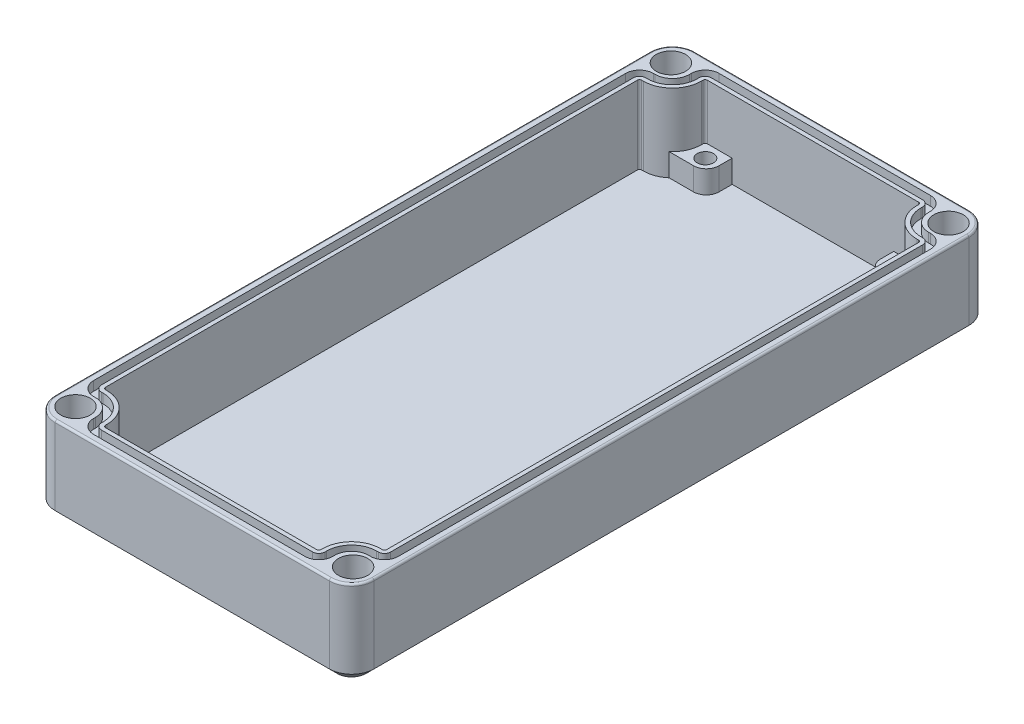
ISO-10303-21;
HEADER;
FILE_DESCRIPTION(('STEP AP214'),'2;1');
FILE_NAME('part.step','',(''),(''),'','','');
FILE_SCHEMA(('AUTOMOTIVE_DESIGN { 1 0 10303 214 1 1 1 1 }'));
ENDSEC;
DATA;
#1=APPLICATION_CONTEXT('core data for automotive mechanical design processes');
#2=APPLICATION_PROTOCOL_DEFINITION('international standard','automotive_design',2000,#1);
#3=PRODUCT_CONTEXT('',#1,'mechanical');
#4=PRODUCT('Part','Part','',(#3));
#5=PRODUCT_RELATED_PRODUCT_CATEGORY('part','',(#4));
#6=PRODUCT_DEFINITION_FORMATION('','',#4);
#7=PRODUCT_DEFINITION_CONTEXT('part definition',#1,'design');
#8=PRODUCT_DEFINITION('design','',#6,#7);
#9=PRODUCT_DEFINITION_SHAPE('','',#8);
#10=(LENGTH_UNIT() NAMED_UNIT(*) SI_UNIT(.MILLI.,.METRE.));
#11=(NAMED_UNIT(*) PLANE_ANGLE_UNIT() SI_UNIT($,.RADIAN.));
#12=(NAMED_UNIT(*) SI_UNIT($,.STERADIAN.) SOLID_ANGLE_UNIT());
#13=UNCERTAINTY_MEASURE_WITH_UNIT(LENGTH_MEASURE(1.E-05),#10,'distance_accuracy_value','');
#14=(GEOMETRIC_REPRESENTATION_CONTEXT(3) GLOBAL_UNCERTAINTY_ASSIGNED_CONTEXT((#13)) GLOBAL_UNIT_ASSIGNED_CONTEXT((#10,
#11,#12)) REPRESENTATION_CONTEXT('',''));
#15=CARTESIAN_POINT('',(0.,0.,0.));
#16=DIRECTION('',(0.,0.,1.));
#17=DIRECTION('',(1.,0.,0.));
#18=AXIS2_PLACEMENT_3D('',#15,#16,#17);
#19=CARTESIAN_POINT('',(49.95,27.051,-100.2));
#20=DIRECTION('',(0.,1.,0.));
#21=DIRECTION('',(0.,0.,1.));
#22=AXIS2_PLACEMENT_3D('',#19,#20,#21);
#23=PLANE('',#22);
#24=CARTESIAN_POINT('',(33.09964,27.051,-93.63664));
#25=DIRECTION('',(0.,1.,0.));
#26=DIRECTION('',(0.,0.,1.));
#27=AXIS2_PLACEMENT_3D('',#24,#25,#26);
#28=CIRCLE('',#27,0.670560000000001);
#29=CARTESIAN_POINT('',(33.7702,27.051,-93.63664));
#30=VERTEX_POINT('',#29);
#31=CARTESIAN_POINT('',(33.09964,27.051,-94.3072));
#32=VERTEX_POINT('',#31);
#33=EDGE_CURVE('E1264',#30,#32,#28,.T.);
#34=ORIENTED_EDGE('',*,*,#33,.F.);
#35=DIRECTION('',(0.,0.,-1.));
#36=VECTOR('',#35,1.);
#37=CARTESIAN_POINT('',(33.7702,27.051,-93.63664));
#38=LINE('',#37,#36);
#39=CARTESIAN_POINT('',(33.7702,27.051,-93.09816));
#40=VERTEX_POINT('',#39);
#41=EDGE_CURVE('E1361',#40,#30,#38,.T.);
#42=ORIENTED_EDGE('',*,*,#41,.F.);
#43=CARTESIAN_POINT('',(42.84816,27.051,-93.09816));
#44=DIRECTION('',(0.,-1.,0.));
#45=DIRECTION('',(0.,0.,-1.));
#46=AXIS2_PLACEMENT_3D('',#43,#44,#45);
#47=CIRCLE('',#46,9.07796);
#48=CARTESIAN_POINT('',(42.84816,27.051,-84.0202));
#49=VERTEX_POINT('',#48);
#50=EDGE_CURVE('E1358',#49,#40,#47,.T.);
#51=ORIENTED_EDGE('',*,*,#50,.F.);
#52=DIRECTION('',(-1.,0.,0.));
#53=VECTOR('',#52,1.);
#54=CARTESIAN_POINT('',(42.84816,27.051,-84.0202));
#55=LINE('',#54,#53);
#56=CARTESIAN_POINT('',(43.38664,27.051,-84.0202));
#57=VERTEX_POINT('',#56);
#58=EDGE_CURVE('E1355',#57,#49,#55,.T.);
#59=ORIENTED_EDGE('',*,*,#58,.F.);
#60=CARTESIAN_POINT('',(43.38664,27.051,-83.34964));
#61=DIRECTION('',(0.,1.,0.));
#62=DIRECTION('',(0.,0.,1.));
#63=AXIS2_PLACEMENT_3D('',#60,#61,#62);
#64=CIRCLE('',#63,0.670560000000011);
#65=CARTESIAN_POINT('',(44.0572,27.051,-83.34964));
#66=VERTEX_POINT('',#65);
#67=EDGE_CURVE('E1352',#66,#57,#64,.T.);
#68=ORIENTED_EDGE('',*,*,#67,.F.);
#69=DIRECTION('',(0.,0.,-1.));
#70=VECTOR('',#69,1.);
#71=CARTESIAN_POINT('',(44.0572,27.051,83.34964));
#72=LINE('',#71,#70);
#73=CARTESIAN_POINT('',(44.0572,27.051,83.34964));
#74=VERTEX_POINT('',#73);
#75=EDGE_CURVE('E1349',#74,#66,#72,.T.);
#76=ORIENTED_EDGE('',*,*,#75,.F.);
#77=CARTESIAN_POINT('',(43.38664,27.051,83.34964));
#78=DIRECTION('',(0.,1.,0.));
#79=DIRECTION('',(0.,0.,-1.));
#80=AXIS2_PLACEMENT_3D('',#77,#78,#79);
#81=CIRCLE('',#80,0.670560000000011);
#82=CARTESIAN_POINT('',(43.38664,27.051,84.0202));
#83=VERTEX_POINT('',#82);
#84=EDGE_CURVE('E1346',#83,#74,#81,.T.);
#85=ORIENTED_EDGE('',*,*,#84,.F.);
#86=DIRECTION('',(1.,0.,0.));
#87=VECTOR('',#86,1.);
#88=CARTESIAN_POINT('',(42.84816,27.051,84.0202));
#89=LINE('',#88,#87);
#90=CARTESIAN_POINT('',(42.84816,27.051,84.0202));
#91=VERTEX_POINT('',#90);
#92=EDGE_CURVE('E1343',#91,#83,#89,.T.);
#93=ORIENTED_EDGE('',*,*,#92,.F.);
#94=CARTESIAN_POINT('',(42.84816,27.051,93.09816));
#95=DIRECTION('',(0.,-1.,0.));
#96=DIRECTION('',(0.,0.,1.));
#97=AXIS2_PLACEMENT_3D('',#94,#95,#96);
#98=CIRCLE('',#97,9.07796);
#99=CARTESIAN_POINT('',(33.7702,27.051,93.09816));
#100=VERTEX_POINT('',#99);
#101=EDGE_CURVE('E1340',#100,#91,#98,.T.);
#102=ORIENTED_EDGE('',*,*,#101,.F.);
#103=DIRECTION('',(0.,0.,-1.));
#104=VECTOR('',#103,1.);
#105=CARTESIAN_POINT('',(33.7702,27.051,93.63664));
#106=LINE('',#105,#104);
#107=CARTESIAN_POINT('',(33.7702,27.051,93.63664));
#108=VERTEX_POINT('',#107);
#109=EDGE_CURVE('E1337',#108,#100,#106,.T.);
#110=ORIENTED_EDGE('',*,*,#109,.F.);
#111=CARTESIAN_POINT('',(33.09964,27.051,93.63664));
#112=DIRECTION('',(0.,1.,0.));
#113=DIRECTION('',(0.,0.,-1.));
#114=AXIS2_PLACEMENT_3D('',#111,#112,#113);
#115=CIRCLE('',#114,0.670560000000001);
#116=CARTESIAN_POINT('',(33.09964,27.051,94.3072));
#117=VERTEX_POINT('',#116);
#118=EDGE_CURVE('E1334',#117,#108,#115,.T.);
#119=ORIENTED_EDGE('',*,*,#118,.F.);
#120=DIRECTION('',(1.,0.,0.));
#121=VECTOR('',#120,1.);
#122=CARTESIAN_POINT('',(33.09964,27.051,94.3072));
#123=LINE('',#122,#121);
#124=CARTESIAN_POINT('',(-33.09964,27.051,94.3072));
#125=VERTEX_POINT('',#124);
#126=EDGE_CURVE('E1331',#125,#117,#123,.T.);
#127=ORIENTED_EDGE('',*,*,#126,.F.);
#128=CARTESIAN_POINT('',(-33.09964,27.051,93.63664));
#129=DIRECTION('',(0.,1.,0.));
#130=DIRECTION('',(0.,0.,1.));
#131=AXIS2_PLACEMENT_3D('',#128,#129,#130);
#132=CIRCLE('',#131,0.670560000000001);
#133=CARTESIAN_POINT('',(-33.7702,27.051,93.63664));
#134=VERTEX_POINT('',#133);
#135=EDGE_CURVE('E1328',#134,#125,#132,.T.);
#136=ORIENTED_EDGE('',*,*,#135,.F.);
#137=DIRECTION('',(0.,0.,1.));
#138=VECTOR('',#137,1.);
#139=CARTESIAN_POINT('',(-33.7702,27.051,93.63664));
#140=LINE('',#139,#138);
#141=CARTESIAN_POINT('',(-33.7702,27.051,93.09816));
#142=VERTEX_POINT('',#141);
#143=EDGE_CURVE('E1325',#142,#134,#140,.T.);
#144=ORIENTED_EDGE('',*,*,#143,.F.);
#145=CARTESIAN_POINT('',(-42.84816,27.051,93.09816));
#146=DIRECTION('',(0.,-1.,0.));
#147=DIRECTION('',(0.,0.,-1.));
#148=AXIS2_PLACEMENT_3D('',#145,#146,#147);
#149=CIRCLE('',#148,9.07796);
#150=CARTESIAN_POINT('',(-42.84816,27.051,84.0202));
#151=VERTEX_POINT('',#150);
#152=EDGE_CURVE('E1322',#151,#142,#149,.T.);
#153=ORIENTED_EDGE('',*,*,#152,.F.);
#154=DIRECTION('',(1.,0.,0.));
#155=VECTOR('',#154,1.);
#156=CARTESIAN_POINT('',(-42.84816,27.051,84.0202));
#157=LINE('',#156,#155);
#158=CARTESIAN_POINT('',(-43.38664,27.051,84.0202));
#159=VERTEX_POINT('',#158);
#160=EDGE_CURVE('E1319',#159,#151,#157,.T.);
#161=ORIENTED_EDGE('',*,*,#160,.F.);
#162=CARTESIAN_POINT('',(-43.38664,27.051,83.34964));
#163=DIRECTION('',(0.,1.,0.));
#164=DIRECTION('',(0.,0.,1.));
#165=AXIS2_PLACEMENT_3D('',#162,#163,#164);
#166=CIRCLE('',#165,0.670560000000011);
#167=CARTESIAN_POINT('',(-44.0572,27.051,83.34964));
#168=VERTEX_POINT('',#167);
#169=EDGE_CURVE('E1316',#168,#159,#166,.T.);
#170=ORIENTED_EDGE('',*,*,#169,.F.);
#171=DIRECTION('',(0.,0.,1.));
#172=VECTOR('',#171,1.);
#173=CARTESIAN_POINT('',(-44.0572,27.051,83.34964));
#174=LINE('',#173,#172);
#175=CARTESIAN_POINT('',(-44.0572,27.051,-83.34964));
#176=VERTEX_POINT('',#175);
#177=EDGE_CURVE('E1313',#176,#168,#174,.T.);
#178=ORIENTED_EDGE('',*,*,#177,.F.);
#179=CARTESIAN_POINT('',(-43.38664,27.051,-83.34964));
#180=DIRECTION('',(0.,1.,0.));
#181=DIRECTION('',(0.,0.,-1.));
#182=AXIS2_PLACEMENT_3D('',#179,#180,#181);
#183=CIRCLE('',#182,0.670560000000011);
#184=CARTESIAN_POINT('',(-43.38664,27.051,-84.0202));
#185=VERTEX_POINT('',#184);
#186=EDGE_CURVE('E1310',#185,#176,#183,.T.);
#187=ORIENTED_EDGE('',*,*,#186,.F.);
#188=DIRECTION('',(-1.,0.,0.));
#189=VECTOR('',#188,1.);
#190=CARTESIAN_POINT('',(-42.84816,27.051,-84.0202));
#191=LINE('',#190,#189);
#192=CARTESIAN_POINT('',(-42.84816,27.051,-84.0202));
#193=VERTEX_POINT('',#192);
#194=EDGE_CURVE('E1307',#193,#185,#191,.T.);
#195=ORIENTED_EDGE('',*,*,#194,.F.);
#196=CARTESIAN_POINT('',(-42.84816,27.051,-93.09816));
#197=DIRECTION('',(0.,-1.,0.));
#198=DIRECTION('',(0.,0.,1.));
#199=AXIS2_PLACEMENT_3D('',#196,#197,#198);
#200=CIRCLE('',#199,9.07796);
#201=CARTESIAN_POINT('',(-33.7702,27.051,-93.09816));
#202=VERTEX_POINT('',#201);
#203=EDGE_CURVE('E1304',#202,#193,#200,.T.);
#204=ORIENTED_EDGE('',*,*,#203,.F.);
#205=DIRECTION('',(0.,0.,1.));
#206=VECTOR('',#205,1.);
#207=CARTESIAN_POINT('',(-33.7702,27.051,-93.63664));
#208=LINE('',#207,#206);
#209=CARTESIAN_POINT('',(-33.7702,27.051,-93.63664));
#210=VERTEX_POINT('',#209);
#211=EDGE_CURVE('E1301',#210,#202,#208,.T.);
#212=ORIENTED_EDGE('',*,*,#211,.F.);
#213=CARTESIAN_POINT('',(-33.09964,27.051,-93.63664));
#214=DIRECTION('',(0.,1.,0.));
#215=DIRECTION('',(0.,0.,-1.));
#216=AXIS2_PLACEMENT_3D('',#213,#214,#215);
#217=CIRCLE('',#216,0.670560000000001);
#218=CARTESIAN_POINT('',(-33.09964,27.051,-94.3072));
#219=VERTEX_POINT('',#218);
#220=EDGE_CURVE('E1298',#219,#210,#217,.T.);
#221=ORIENTED_EDGE('',*,*,#220,.F.);
#222=DIRECTION('',(-1.,0.,0.));
#223=VECTOR('',#222,1.);
#224=CARTESIAN_POINT('',(33.09964,27.051,-94.3072));
#225=LINE('',#224,#223);
#226=EDGE_CURVE('E1295',#32,#219,#225,.T.);
#227=ORIENTED_EDGE('',*,*,#226,.F.);
#228=EDGE_LOOP('',(#34,#42,#51,#59,#68,#76,#85,#93,#102,#110,#119,#127,#136,#144,#153,#161,#170,
#178,#187,#195,#204,#212,#221,#227));
#229=FACE_BOUND('',#228,.T.);
#230=DIRECTION('',(1.,0.,0.));
#231=VECTOR('',#230,1.);
#232=CARTESIAN_POINT('',(43.38664,27.051,85.2902));
#233=LINE('',#232,#231);
#234=CARTESIAN_POINT('',(42.84816,27.051,85.2902));
#235=VERTEX_POINT('',#234);
#236=CARTESIAN_POINT('',(43.38664,27.051,85.2902));
#237=VERTEX_POINT('',#236);
#238=EDGE_CURVE('E776',#235,#237,#233,.T.);
#239=ORIENTED_EDGE('',*,*,#238,.T.);
#240=CARTESIAN_POINT('',(43.38664,27.051,83.34964));
#241=DIRECTION('',(0.,1.,0.));
#242=DIRECTION('',(0.,0.,-1.));
#243=AXIS2_PLACEMENT_3D('',#240,#241,#242);
#244=CIRCLE('',#243,1.94056);
#245=CARTESIAN_POINT('',(45.3272,27.051,83.34964));
#246=VERTEX_POINT('',#245);
#247=EDGE_CURVE('E717',#237,#246,#244,.T.);
#248=ORIENTED_EDGE('',*,*,#247,.T.);
#249=DIRECTION('',(0.,0.,-1.));
#250=VECTOR('',#249,1.);
#251=CARTESIAN_POINT('',(45.3272,27.051,83.34964));
#252=LINE('',#251,#250);
#253=CARTESIAN_POINT('',(45.3272,27.051,-83.34964));
#254=VERTEX_POINT('',#253);
#255=EDGE_CURVE('E715',#246,#254,#252,.T.);
#256=ORIENTED_EDGE('',*,*,#255,.T.);
#257=CARTESIAN_POINT('',(43.38664,27.051,-83.34964));
#258=DIRECTION('',(0.,1.,0.));
#259=DIRECTION('',(0.,0.,1.));
#260=AXIS2_PLACEMENT_3D('',#257,#258,#259);
#261=CIRCLE('',#260,1.94056);
#262=CARTESIAN_POINT('',(43.38664,27.051,-85.2902));
#263=VERTEX_POINT('',#262);
#264=EDGE_CURVE('E694',#254,#263,#261,.T.);
#265=ORIENTED_EDGE('',*,*,#264,.T.);
#266=DIRECTION('',(-1.,0.,0.));
#267=VECTOR('',#266,1.);
#268=CARTESIAN_POINT('',(43.38664,27.051,-85.2902));
#269=LINE('',#268,#267);
#270=CARTESIAN_POINT('',(42.84816,27.051,-85.2902));
#271=VERTEX_POINT('',#270);
#272=EDGE_CURVE('E704',#263,#271,#269,.T.);
#273=ORIENTED_EDGE('',*,*,#272,.T.);
#274=CARTESIAN_POINT('',(42.84816,27.051,-93.09816));
#275=DIRECTION('',(0.,-1.,0.));
#276=DIRECTION('',(0.,0.,1.));
#277=AXIS2_PLACEMENT_3D('',#274,#275,#276);
#278=CIRCLE('',#277,7.80796);
#279=CARTESIAN_POINT('',(35.0402,27.051,-93.09816));
#280=VERTEX_POINT('',#279);
#281=EDGE_CURVE('E709',#271,#280,#278,.T.);
#282=ORIENTED_EDGE('',*,*,#281,.T.);
#283=DIRECTION('',(0.,0.,-1.));
#284=VECTOR('',#283,1.);
#285=CARTESIAN_POINT('',(35.0402,27.051,-93.63664));
#286=LINE('',#285,#284);
#287=CARTESIAN_POINT('',(35.0402,27.051,-93.63664));
#288=VERTEX_POINT('',#287);
#289=EDGE_CURVE('E722',#280,#288,#286,.T.);
#290=ORIENTED_EDGE('',*,*,#289,.T.);
#291=CARTESIAN_POINT('',(33.09964,27.051,-93.63664));
#292=DIRECTION('',(0.,1.,0.));
#293=DIRECTION('',(0.,0.,-1.));
#294=AXIS2_PLACEMENT_3D('',#291,#292,#293);
#295=CIRCLE('',#294,1.94056000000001);
#296=CARTESIAN_POINT('',(33.09964,27.051,-95.5772));
#297=VERTEX_POINT('',#296);
#298=EDGE_CURVE('E725',#288,#297,#295,.T.);
#299=ORIENTED_EDGE('',*,*,#298,.T.);
#300=DIRECTION('',(-1.,0.,0.));
#301=VECTOR('',#300,1.);
#302=CARTESIAN_POINT('',(-33.0996400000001,27.051,-95.5772));
#303=LINE('',#302,#301);
#304=CARTESIAN_POINT('',(-33.0996400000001,27.051,-95.5772));
#305=VERTEX_POINT('',#304);
#306=EDGE_CURVE('E728',#297,#305,#303,.T.);
#307=ORIENTED_EDGE('',*,*,#306,.T.);
#308=CARTESIAN_POINT('',(-33.0996400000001,27.051,-93.63664));
#309=DIRECTION('',(0.,1.,0.));
#310=DIRECTION('',(0.,0.,1.));
#311=AXIS2_PLACEMENT_3D('',#308,#309,#310);
#312=CIRCLE('',#311,1.94056000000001);
#313=CARTESIAN_POINT('',(-35.0402000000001,27.051,-93.63664));
#314=VERTEX_POINT('',#313);
#315=EDGE_CURVE('E731',#305,#314,#312,.T.);
#316=ORIENTED_EDGE('',*,*,#315,.T.);
#317=DIRECTION('',(0.,0.,1.));
#318=VECTOR('',#317,1.);
#319=CARTESIAN_POINT('',(-35.0402000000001,27.051,-93.63664));
#320=LINE('',#319,#318);
#321=CARTESIAN_POINT('',(-35.0402000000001,27.051,-93.09816));
#322=VERTEX_POINT('',#321);
#323=EDGE_CURVE('E734',#314,#322,#320,.T.);
#324=ORIENTED_EDGE('',*,*,#323,.T.);
#325=CARTESIAN_POINT('',(-42.84816,27.051,-93.09816));
#326=DIRECTION('',(0.,-1.,0.));
#327=DIRECTION('',(0.,0.,-1.));
#328=AXIS2_PLACEMENT_3D('',#325,#326,#327);
#329=CIRCLE('',#328,7.80796);
#330=CARTESIAN_POINT('',(-42.84816,27.051,-85.2902));
#331=VERTEX_POINT('',#330);
#332=EDGE_CURVE('E737',#322,#331,#329,.T.);
#333=ORIENTED_EDGE('',*,*,#332,.T.);
#334=DIRECTION('',(-1.,0.,0.));
#335=VECTOR('',#334,1.);
#336=CARTESIAN_POINT('',(-43.38664,27.051,-85.2902));
#337=LINE('',#336,#335);
#338=CARTESIAN_POINT('',(-43.38664,27.051,-85.2902));
#339=VERTEX_POINT('',#338);
#340=EDGE_CURVE('E740',#331,#339,#337,.T.);
#341=ORIENTED_EDGE('',*,*,#340,.T.);
#342=CARTESIAN_POINT('',(-43.38664,27.051,-83.34964));
#343=DIRECTION('',(0.,1.,0.));
#344=DIRECTION('',(0.,0.,-1.));
#345=AXIS2_PLACEMENT_3D('',#342,#343,#344);
#346=CIRCLE('',#345,1.94056);
#347=CARTESIAN_POINT('',(-45.3272000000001,27.051,-83.34964));
#348=VERTEX_POINT('',#347);
#349=EDGE_CURVE('E743',#339,#348,#346,.T.);
#350=ORIENTED_EDGE('',*,*,#349,.T.);
#351=DIRECTION('',(0.,0.,1.));
#352=VECTOR('',#351,1.);
#353=CARTESIAN_POINT('',(-45.3272,27.051,83.34964));
#354=LINE('',#353,#352);
#355=CARTESIAN_POINT('',(-45.3272,27.051,83.34964));
#356=VERTEX_POINT('',#355);
#357=EDGE_CURVE('E746',#348,#356,#354,.T.);
#358=ORIENTED_EDGE('',*,*,#357,.T.);
#359=CARTESIAN_POINT('',(-43.38664,27.051,83.34964));
#360=DIRECTION('',(0.,1.,0.));
#361=DIRECTION('',(0.,0.,1.));
#362=AXIS2_PLACEMENT_3D('',#359,#360,#361);
#363=CIRCLE('',#362,1.94056);
#364=CARTESIAN_POINT('',(-43.38664,27.051,85.2902));
#365=VERTEX_POINT('',#364);
#366=EDGE_CURVE('E749',#356,#365,#363,.T.);
#367=ORIENTED_EDGE('',*,*,#366,.T.);
#368=DIRECTION('',(1.,0.,0.));
#369=VECTOR('',#368,1.);
#370=CARTESIAN_POINT('',(-43.38664,27.051,85.2902));
#371=LINE('',#370,#369);
#372=CARTESIAN_POINT('',(-42.84816,27.051,85.2902));
#373=VERTEX_POINT('',#372);
#374=EDGE_CURVE('E752',#365,#373,#371,.T.);
#375=ORIENTED_EDGE('',*,*,#374,.T.);
#376=CARTESIAN_POINT('',(-42.84816,27.051,93.09816));
#377=DIRECTION('',(0.,-1.,0.));
#378=DIRECTION('',(0.,0.,1.));
#379=AXIS2_PLACEMENT_3D('',#376,#377,#378);
#380=CIRCLE('',#379,7.80796);
#381=CARTESIAN_POINT('',(-35.0402,27.051,93.09816));
#382=VERTEX_POINT('',#381);
#383=EDGE_CURVE('E755',#373,#382,#380,.T.);
#384=ORIENTED_EDGE('',*,*,#383,.T.);
#385=DIRECTION('',(0.,0.,1.));
#386=VECTOR('',#385,1.);
#387=CARTESIAN_POINT('',(-35.0402,27.051,93.63664));
#388=LINE('',#387,#386);
#389=CARTESIAN_POINT('',(-35.0402,27.051,93.63664));
#390=VERTEX_POINT('',#389);
#391=EDGE_CURVE('E758',#382,#390,#388,.T.);
#392=ORIENTED_EDGE('',*,*,#391,.T.);
#393=CARTESIAN_POINT('',(-33.09964,27.051,93.63664));
#394=DIRECTION('',(0.,1.,0.));
#395=DIRECTION('',(0.,0.,-1.));
#396=AXIS2_PLACEMENT_3D('',#393,#394,#395);
#397=CIRCLE('',#396,1.94056000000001);
#398=CARTESIAN_POINT('',(-33.09964,27.051,95.5772));
#399=VERTEX_POINT('',#398);
#400=EDGE_CURVE('E761',#390,#399,#397,.T.);
#401=ORIENTED_EDGE('',*,*,#400,.T.);
#402=DIRECTION('',(1.,0.,0.));
#403=VECTOR('',#402,1.);
#404=CARTESIAN_POINT('',(-33.09964,27.051,95.5772));
#405=LINE('',#404,#403);
#406=CARTESIAN_POINT('',(33.09964,27.051,95.5772));
#407=VERTEX_POINT('',#406);
#408=EDGE_CURVE('E764',#399,#407,#405,.T.);
#409=ORIENTED_EDGE('',*,*,#408,.T.);
#410=CARTESIAN_POINT('',(33.09964,27.051,93.63664));
#411=DIRECTION('',(0.,1.,0.));
#412=DIRECTION('',(0.,0.,1.));
#413=AXIS2_PLACEMENT_3D('',#410,#411,#412);
#414=CIRCLE('',#413,1.94056000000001);
#415=CARTESIAN_POINT('',(35.0402,27.051,93.63664));
#416=VERTEX_POINT('',#415);
#417=EDGE_CURVE('E767',#407,#416,#414,.T.);
#418=ORIENTED_EDGE('',*,*,#417,.T.);
#419=DIRECTION('',(0.,0.,-1.));
#420=VECTOR('',#419,1.);
#421=CARTESIAN_POINT('',(35.0402,27.051,93.63664));
#422=LINE('',#421,#420);
#423=CARTESIAN_POINT('',(35.0402,27.051,93.09816));
#424=VERTEX_POINT('',#423);
#425=EDGE_CURVE('E770',#416,#424,#422,.T.);
#426=ORIENTED_EDGE('',*,*,#425,.T.);
#427=CARTESIAN_POINT('',(42.84816,27.051,93.09816));
#428=DIRECTION('',(0.,-1.,0.));
#429=DIRECTION('',(0.,0.,-1.));
#430=AXIS2_PLACEMENT_3D('',#427,#428,#429);
#431=CIRCLE('',#430,7.80796);
#432=EDGE_CURVE('E773',#424,#235,#431,.T.);
#433=ORIENTED_EDGE('',*,*,#432,.T.);
#434=EDGE_LOOP('',(#239,#248,#256,#265,#273,#282,#290,#299,#307,#316,#324,#333,#341,#350,#358,
#367,#375,#384,#392,#401,#409,#418,#426,#433));
#435=FACE_BOUND('',#434,.T.);
#436=ADVANCED_FACE('F26',(#229,#435),#23,.T.);
#437=CARTESIAN_POINT('',(33.09964,9.779,-93.63664));
#438=DIRECTION('',(0.,1.,0.));
#439=DIRECTION('',(0.,0.,1.));
#440=AXIS2_PLACEMENT_3D('',#437,#438,#439);
#441=PLANE('',#440);
#442=CARTESIAN_POINT('',(29.5,9.779,90.07475));
#443=DIRECTION('',(0.,1.,0.));
#444=DIRECTION('',(0.,0.,-1.));
#445=AXIS2_PLACEMENT_3D('',#442,#443,#444);
#446=CIRCLE('',#445,2.00000000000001);
#447=CARTESIAN_POINT('',(29.5,9.779,88.07475));
#448=VERTEX_POINT('',#447);
#449=EDGE_CURVE('E1123',#448,#448,#446,.T.);
#450=ORIENTED_EDGE('',*,*,#449,.F.);
#451=EDGE_LOOP('',(#450));
#452=FACE_BOUND('',#451,.T.);
#453=DIRECTION('',(1.,0.,0.));
#454=VECTOR('',#453,1.);
#455=CARTESIAN_POINT('',(36.9469104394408,9.779,86.2));
#456=LINE('',#455,#454);
#457=CARTESIAN_POINT('',(29.311992,9.779,86.2));
#458=VERTEX_POINT('',#457);
#459=CARTESIAN_POINT('',(36.9469104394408,9.779,86.2));
#460=VERTEX_POINT('',#459);
#461=EDGE_CURVE('E1174',#458,#460,#456,.T.);
#462=ORIENTED_EDGE('',*,*,#461,.F.);
#463=CARTESIAN_POINT('',(29.311992,9.779,90.199992));
#464=DIRECTION('',(0.,-1.,0.));
#465=DIRECTION('',(0.,0.,-1.));
#466=AXIS2_PLACEMENT_3D('',#463,#464,#465);
#467=CIRCLE('',#466,3.999992);
#468=CARTESIAN_POINT('',(25.312,9.779,90.199992));
#469=VERTEX_POINT('',#468);
#470=EDGE_CURVE('E1171',#469,#458,#467,.T.);
#471=ORIENTED_EDGE('',*,*,#470,.F.);
#472=DIRECTION('',(0.,0.,-1.));
#473=VECTOR('',#472,1.);
#474=CARTESIAN_POINT('',(25.312,9.779,90.199992));
#475=LINE('',#474,#473);
#476=CARTESIAN_POINT('',(25.312,9.779,94.3071999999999));
#477=VERTEX_POINT('',#476);
#478=EDGE_CURVE('E1168',#477,#469,#475,.T.);
#479=ORIENTED_EDGE('',*,*,#478,.F.);
#480=DIRECTION('',(1.,0.,0.));
#481=VECTOR('',#480,1.);
#482=CARTESIAN_POINT('',(33.09964,9.779,94.3072));
#483=LINE('',#482,#481);
#484=CARTESIAN_POINT('',(33.09964,9.779,94.3072));
#485=VERTEX_POINT('',#484);
#486=EDGE_CURVE('E1388',#477,#485,#483,.T.);
#487=ORIENTED_EDGE('',*,*,#486,.T.);
#488=CARTESIAN_POINT('',(33.09964,9.779,93.63664));
#489=DIRECTION('',(0.,1.,0.));
#490=DIRECTION('',(0.,0.,-1.));
#491=AXIS2_PLACEMENT_3D('',#488,#489,#490);
#492=CIRCLE('',#491,0.670560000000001);
#493=CARTESIAN_POINT('',(33.7702,9.779,93.63664));
#494=VERTEX_POINT('',#493);
#495=EDGE_CURVE('E1392',#485,#494,#492,.T.);
#496=ORIENTED_EDGE('',*,*,#495,.T.);
#497=DIRECTION('',(0.,0.,-1.));
#498=VECTOR('',#497,1.);
#499=CARTESIAN_POINT('',(33.7702,9.779,93.63664));
#500=LINE('',#499,#498);
#501=CARTESIAN_POINT('',(33.7702,9.779,93.09816));
#502=VERTEX_POINT('',#501);
#503=EDGE_CURVE('E1395',#494,#502,#500,.T.);
#504=ORIENTED_EDGE('',*,*,#503,.T.);
#505=CARTESIAN_POINT('',(42.84816,9.779,93.09816));
#506=DIRECTION('',(0.,-1.,0.));
#507=DIRECTION('',(0.,0.,1.));
#508=AXIS2_PLACEMENT_3D('',#505,#506,#507);
#509=CIRCLE('',#508,9.07796);
#510=EDGE_CURVE('E1398',#502,#460,#509,.T.);
#511=ORIENTED_EDGE('',*,*,#510,.T.);
#512=EDGE_LOOP('',(#462,#471,#479,#487,#496,#504,#511));
#513=FACE_BOUND('',#512,.T.);
#514=ADVANCED_FACE('F1576',(#452,#513),#441,.T.);
#515=CARTESIAN_POINT('',(-29.5,9.779,90.07475));
#516=DIRECTION('',(0.,1.,0.));
#517=DIRECTION('',(0.,0.,1.));
#518=AXIS2_PLACEMENT_3D('',#515,#516,#517);
#519=CIRCLE('',#518,2.00000000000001);
#520=CARTESIAN_POINT('',(-29.5,9.779,92.07475));
#521=VERTEX_POINT('',#520);
#522=EDGE_CURVE('E1129',#521,#521,#519,.T.);
#523=ORIENTED_EDGE('',*,*,#522,.F.);
#524=EDGE_LOOP('',(#523));
#525=FACE_BOUND('',#524,.T.);
#526=DIRECTION('',(0.,0.,1.));
#527=VECTOR('',#526,1.);
#528=CARTESIAN_POINT('',(-25.312,9.779,90.199992));
#529=LINE('',#528,#527);
#530=CARTESIAN_POINT('',(-25.312,9.779,90.199992));
#531=VERTEX_POINT('',#530);
#532=CARTESIAN_POINT('',(-25.312,9.779,94.3071999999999));
#533=VERTEX_POINT('',#532);
#534=EDGE_CURVE('E1165',#531,#533,#529,.T.);
#535=ORIENTED_EDGE('',*,*,#534,.F.);
#536=CARTESIAN_POINT('',(-29.311992,9.779,90.199992));
#537=DIRECTION('',(0.,-1.,0.));
#538=DIRECTION('',(0.,0.,1.));
#539=AXIS2_PLACEMENT_3D('',#536,#537,#538);
#540=CIRCLE('',#539,3.999992);
#541=CARTESIAN_POINT('',(-29.311992,9.779,86.2));
#542=VERTEX_POINT('',#541);
#543=EDGE_CURVE('E1162',#542,#531,#540,.T.);
#544=ORIENTED_EDGE('',*,*,#543,.F.);
#545=DIRECTION('',(1.,0.,0.));
#546=VECTOR('',#545,1.);
#547=CARTESIAN_POINT('',(-36.9469104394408,9.779,86.2));
#548=LINE('',#547,#546);
#549=CARTESIAN_POINT('',(-36.9469104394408,9.779,86.2));
#550=VERTEX_POINT('',#549);
#551=EDGE_CURVE('E1159',#550,#542,#548,.T.);
#552=ORIENTED_EDGE('',*,*,#551,.F.);
#553=CARTESIAN_POINT('',(-42.84816,9.779,93.09816));
#554=DIRECTION('',(0.,-1.,0.));
#555=DIRECTION('',(0.,0.,-1.));
#556=AXIS2_PLACEMENT_3D('',#553,#554,#555);
#557=CIRCLE('',#556,9.07796);
#558=CARTESIAN_POINT('',(-33.7702,9.779,93.09816));
#559=VERTEX_POINT('',#558);
#560=EDGE_CURVE('E1380',#550,#559,#557,.T.);
#561=ORIENTED_EDGE('',*,*,#560,.T.);
#562=DIRECTION('',(0.,0.,1.));
#563=VECTOR('',#562,1.);
#564=CARTESIAN_POINT('',(-33.7702,9.779,93.63664));
#565=LINE('',#564,#563);
#566=CARTESIAN_POINT('',(-33.7702,9.779,93.63664));
#567=VERTEX_POINT('',#566);
#568=EDGE_CURVE('E1382',#559,#567,#565,.T.);
#569=ORIENTED_EDGE('',*,*,#568,.T.);
#570=CARTESIAN_POINT('',(-33.09964,9.779,93.63664));
#571=DIRECTION('',(0.,1.,0.));
#572=DIRECTION('',(0.,0.,1.));
#573=AXIS2_PLACEMENT_3D('',#570,#571,#572);
#574=CIRCLE('',#573,0.670560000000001);
#575=CARTESIAN_POINT('',(-33.09964,9.779,94.3072));
#576=VERTEX_POINT('',#575);
#577=EDGE_CURVE('E1385',#567,#576,#574,.T.);
#578=ORIENTED_EDGE('',*,*,#577,.T.);
#579=EDGE_CURVE('E1389',#576,#533,#483,.T.);
#580=ORIENTED_EDGE('',*,*,#579,.T.);
#581=EDGE_LOOP('',(#535,#544,#552,#561,#569,#578,#580));
#582=FACE_BOUND('',#581,.T.);
#583=ADVANCED_FACE('F1583',(#525,#582),#441,.T.);
#584=CARTESIAN_POINT('',(-29.5,9.779,-90.07475));
#585=DIRECTION('',(0.,1.,0.));
#586=DIRECTION('',(0.,0.,1.));
#587=AXIS2_PLACEMENT_3D('',#584,#585,#586);
#588=CIRCLE('',#587,2.55269999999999);
#589=CARTESIAN_POINT('',(-29.5,9.779,-87.52205));
#590=VERTEX_POINT('',#589);
#591=EDGE_CURVE('E1934',#590,#590,#588,.T.);
#592=ORIENTED_EDGE('',*,*,#591,.F.);
#593=EDGE_LOOP('',(#592));
#594=FACE_BOUND('',#593,.T.);
#595=DIRECTION('',(-1.,0.,0.));
#596=VECTOR('',#595,1.);
#597=CARTESIAN_POINT('',(-36.9469104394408,9.779,-86.2));
#598=LINE('',#597,#596);
#599=CARTESIAN_POINT('',(-29.311992,9.779,-86.2));
#600=VERTEX_POINT('',#599);
#601=CARTESIAN_POINT('',(-36.9469104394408,9.779,-86.2));
#602=VERTEX_POINT('',#601);
#603=EDGE_CURVE('E1156',#600,#602,#598,.T.);
#604=ORIENTED_EDGE('',*,*,#603,.F.);
#605=CARTESIAN_POINT('',(-29.311992,9.779,-90.199992));
#606=DIRECTION('',(0.,-1.,0.));
#607=DIRECTION('',(0.,0.,-1.));
#608=AXIS2_PLACEMENT_3D('',#605,#606,#607);
#609=CIRCLE('',#608,3.999992);
#610=CARTESIAN_POINT('',(-25.312,9.779,-90.199992));
#611=VERTEX_POINT('',#610);
#612=EDGE_CURVE('E1153',#611,#600,#609,.T.);
#613=ORIENTED_EDGE('',*,*,#612,.F.);
#614=DIRECTION('',(0.,0.,1.));
#615=VECTOR('',#614,1.);
#616=CARTESIAN_POINT('',(-25.312,9.779,-90.199992));
#617=LINE('',#616,#615);
#618=CARTESIAN_POINT('',(-25.312,9.779,-94.3072));
#619=VERTEX_POINT('',#618);
#620=EDGE_CURVE('E1150',#619,#611,#617,.T.);
#621=ORIENTED_EDGE('',*,*,#620,.F.);
#622=DIRECTION('',(-1.,0.,0.));
#623=VECTOR('',#622,1.);
#624=CARTESIAN_POINT('',(33.09964,9.779,-94.3072));
#625=LINE('',#624,#623);
#626=CARTESIAN_POINT('',(-33.09964,9.779,-94.3072));
#627=VERTEX_POINT('',#626);
#628=EDGE_CURVE('E1367',#619,#627,#625,.T.);
#629=ORIENTED_EDGE('',*,*,#628,.T.);
#630=CARTESIAN_POINT('',(-33.09964,9.779,-93.63664));
#631=DIRECTION('',(0.,1.,0.));
#632=DIRECTION('',(0.,0.,-1.));
#633=AXIS2_PLACEMENT_3D('',#630,#631,#632);
#634=CIRCLE('',#633,0.670560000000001);
#635=CARTESIAN_POINT('',(-33.7702,9.779,-93.63664));
#636=VERTEX_POINT('',#635);
#637=EDGE_CURVE('E1371',#627,#636,#634,.T.);
#638=ORIENTED_EDGE('',*,*,#637,.T.);
#639=DIRECTION('',(0.,0.,1.));
#640=VECTOR('',#639,1.);
#641=CARTESIAN_POINT('',(-33.7702,9.779,-93.63664));
#642=LINE('',#641,#640);
#643=CARTESIAN_POINT('',(-33.7702,9.779,-93.09816));
#644=VERTEX_POINT('',#643);
#645=EDGE_CURVE('E1374',#636,#644,#642,.T.);
#646=ORIENTED_EDGE('',*,*,#645,.T.);
#647=CARTESIAN_POINT('',(-42.84816,9.779,-93.09816));
#648=DIRECTION('',(0.,-1.,0.));
#649=DIRECTION('',(0.,0.,1.));
#650=AXIS2_PLACEMENT_3D('',#647,#648,#649);
#651=CIRCLE('',#650,9.07796);
#652=EDGE_CURVE('E1377',#644,#602,#651,.T.);
#653=ORIENTED_EDGE('',*,*,#652,.T.);
#654=EDGE_LOOP('',(#604,#613,#621,#629,#638,#646,#653));
#655=FACE_BOUND('',#654,.T.);
#656=ADVANCED_FACE('F2753',(#594,#655),#441,.T.);
#657=CARTESIAN_POINT('',(33.09964,9.779,-93.63664));
#658=DIRECTION('',(0.,1.,0.));
#659=DIRECTION('',(0.,0.,1.));
#660=AXIS2_PLACEMENT_3D('',#657,#658,#659);
#661=CYLINDRICAL_SURFACE('',#660,0.670560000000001);
#662=ORIENTED_EDGE('',*,*,#33,.T.);
#663=DIRECTION('',(0.,1.,0.));
#664=VECTOR('',#663,1.);
#665=CARTESIAN_POINT('',(33.09964,9.779,-94.3072));
#666=LINE('',#665,#664);
#667=CARTESIAN_POINT('',(33.09964,9.779,-94.3072));
#668=VERTEX_POINT('',#667);
#669=EDGE_CURVE('E1406',#668,#32,#666,.T.);
#670=ORIENTED_EDGE('',*,*,#669,.F.);
#671=CARTESIAN_POINT('',(33.09964,9.779,-93.63664));
#672=DIRECTION('',(0.,1.,0.));
#673=DIRECTION('',(0.,0.,1.));
#674=AXIS2_PLACEMENT_3D('',#671,#672,#673);
#675=CIRCLE('',#674,0.670560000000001);
#676=CARTESIAN_POINT('',(33.7702,9.779,-93.63664));
#677=VERTEX_POINT('',#676);
#678=EDGE_CURVE('E1364',#677,#668,#675,.T.);
#679=ORIENTED_EDGE('',*,*,#678,.F.);
#680=DIRECTION('',(0.,1.,0.));
#681=VECTOR('',#680,1.);
#682=CARTESIAN_POINT('',(33.7702,9.779,-93.63664));
#683=LINE('',#682,#681);
#684=EDGE_CURVE('E1407',#677,#30,#683,.T.);
#685=ORIENTED_EDGE('',*,*,#684,.T.);
#686=EDGE_LOOP('',(#662,#670,#679,#685));
#687=FACE_BOUND('',#686,.T.);
#688=ADVANCED_FACE('F2759',(#687),#661,.F.);
#689=CARTESIAN_POINT('',(33.7702,9.779,-93.63664));
#690=DIRECTION('',(1.,0.,0.));
#691=DIRECTION('',(0.,0.,-1.));
#692=AXIS2_PLACEMENT_3D('',#689,#690,#691);
#693=PLANE('',#692);
#694=ORIENTED_EDGE('',*,*,#41,.T.);
#695=ORIENTED_EDGE('',*,*,#684,.F.);
#696=DIRECTION('',(0.,0.,-1.));
#697=VECTOR('',#696,1.);
#698=CARTESIAN_POINT('',(33.7702,9.779,-93.63664));
#699=LINE('',#698,#697);
#700=CARTESIAN_POINT('',(33.7702,9.779,-93.09816));
#701=VERTEX_POINT('',#700);
#702=EDGE_CURVE('E1403',#701,#677,#699,.T.);
#703=ORIENTED_EDGE('',*,*,#702,.F.);
#704=DIRECTION('',(0.,1.,0.));
#705=VECTOR('',#704,1.);
#706=CARTESIAN_POINT('',(33.7702,9.779,-93.09816));
#707=LINE('',#706,#705);
#708=EDGE_CURVE('E1410',#701,#40,#707,.T.);
#709=ORIENTED_EDGE('',*,*,#708,.T.);
#710=EDGE_LOOP('',(#694,#695,#703,#709));
#711=FACE_BOUND('',#710,.T.);
#712=ADVANCED_FACE('F2737',(#711),#693,.F.);
#713=CARTESIAN_POINT('',(42.84816,9.779,-93.09816));
#714=DIRECTION('',(0.,1.,0.));
#715=DIRECTION('',(0.,0.,1.));
#716=AXIS2_PLACEMENT_3D('',#713,#714,#715);
#717=CYLINDRICAL_SURFACE('',#716,9.07796);
#718=ORIENTED_EDGE('',*,*,#50,.T.);
#719=ORIENTED_EDGE('',*,*,#708,.F.);
#720=CARTESIAN_POINT('',(42.84816,9.779,-93.09816));
#721=DIRECTION('',(0.,-1.,0.));
#722=DIRECTION('',(0.,0.,-1.));
#723=AXIS2_PLACEMENT_3D('',#720,#721,#722);
#724=CIRCLE('',#723,9.07796);
#725=CARTESIAN_POINT('',(36.9469104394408,9.779,-86.2));
#726=VERTEX_POINT('',#725);
#727=EDGE_CURVE('E1401',#726,#701,#724,.T.);
#728=ORIENTED_EDGE('',*,*,#727,.F.);
#729=DIRECTION('',(0.,1.,0.));
#730=VECTOR('',#729,1.);
#731=CARTESIAN_POINT('',(36.9469104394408,2.667,-86.2));
#732=LINE('',#731,#730);
#733=CARTESIAN_POINT('',(36.9469104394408,2.667,-86.2));
#734=VERTEX_POINT('',#733);
#735=EDGE_CURVE('E1261',#734,#726,#732,.T.);
#736=ORIENTED_EDGE('',*,*,#735,.F.);
#737=CARTESIAN_POINT('',(42.84816,2.667,-93.09816));
#738=DIRECTION('',(0.,-1.,0.));
#739=DIRECTION('',(0.,0.,-1.));
#740=AXIS2_PLACEMENT_3D('',#737,#738,#739);
#741=CIRCLE('',#740,9.07796);
#742=CARTESIAN_POINT('',(42.84816,2.667,-84.0202));
#743=VERTEX_POINT('',#742);
#744=EDGE_CURVE('E1189',#743,#734,#741,.T.);
#745=ORIENTED_EDGE('',*,*,#744,.F.);
#746=DIRECTION('',(0.,1.,0.));
#747=VECTOR('',#746,1.);
#748=CARTESIAN_POINT('',(42.84816,9.779,-84.0202));
#749=LINE('',#748,#747);
#750=EDGE_CURVE('E1412',#743,#49,#749,.T.);
#751=ORIENTED_EDGE('',*,*,#750,.T.);
#752=EDGE_LOOP('',(#718,#719,#728,#736,#745,#751));
#753=FACE_BOUND('',#752,.T.);
#754=ADVANCED_FACE('F2726',(#753),#717,.T.);
#755=CARTESIAN_POINT('',(42.84816,9.779,-84.0202));
#756=DIRECTION('',(0.,0.,-1.));
#757=DIRECTION('',(-1.,0.,0.));
#758=AXIS2_PLACEMENT_3D('',#755,#756,#757);
#759=PLANE('',#758);
#760=ORIENTED_EDGE('',*,*,#58,.T.);
#761=ORIENTED_EDGE('',*,*,#750,.F.);
#762=DIRECTION('',(-1.,0.,0.));
#763=VECTOR('',#762,1.);
#764=CARTESIAN_POINT('',(42.84816,2.667,-84.0202));
#765=LINE('',#764,#763);
#766=CARTESIAN_POINT('',(43.38664,2.667,-84.0202));
#767=VERTEX_POINT('',#766);
#768=EDGE_CURVE('E1186',#767,#743,#765,.T.);
#769=ORIENTED_EDGE('',*,*,#768,.F.);
#770=DIRECTION('',(0.,1.,0.));
#771=VECTOR('',#770,1.);
#772=CARTESIAN_POINT('',(43.38664,9.779,-84.0202));
#773=LINE('',#772,#771);
#774=EDGE_CURVE('E1414',#767,#57,#773,.T.);
#775=ORIENTED_EDGE('',*,*,#774,.T.);
#776=EDGE_LOOP('',(#760,#761,#769,#775));
#777=FACE_BOUND('',#776,.T.);
#778=ADVANCED_FACE('F2715',(#777),#759,.F.);
#779=CARTESIAN_POINT('',(43.38664,9.779,-83.34964));
#780=DIRECTION('',(0.,1.,0.));
#781=DIRECTION('',(0.,0.,1.));
#782=AXIS2_PLACEMENT_3D('',#779,#780,#781);
#783=CYLINDRICAL_SURFACE('',#782,0.670560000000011);
#784=ORIENTED_EDGE('',*,*,#67,.T.);
#785=ORIENTED_EDGE('',*,*,#774,.F.);
#786=CARTESIAN_POINT('',(43.38664,2.667,-83.34964));
#787=DIRECTION('',(0.,1.,0.));
#788=DIRECTION('',(0.,0.,-1.));
#789=AXIS2_PLACEMENT_3D('',#786,#787,#788);
#790=CIRCLE('',#789,0.670560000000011);
#791=CARTESIAN_POINT('',(44.0572,2.667,-83.34964));
#792=VERTEX_POINT('',#791);
#793=EDGE_CURVE('E1183',#792,#767,#790,.T.);
#794=ORIENTED_EDGE('',*,*,#793,.F.);
#795=DIRECTION('',(0.,1.,0.));
#796=VECTOR('',#795,1.);
#797=CARTESIAN_POINT('',(44.0572,9.779,-83.34964));
#798=LINE('',#797,#796);
#799=EDGE_CURVE('E1416',#792,#66,#798,.T.);
#800=ORIENTED_EDGE('',*,*,#799,.T.);
#801=EDGE_LOOP('',(#784,#785,#794,#800));
#802=FACE_BOUND('',#801,.T.);
#803=ADVANCED_FACE('F2704',(#802),#783,.F.);
#804=CARTESIAN_POINT('',(44.0572,9.779,83.34964));
#805=DIRECTION('',(1.,0.,0.));
#806=DIRECTION('',(0.,0.,-1.));
#807=AXIS2_PLACEMENT_3D('',#804,#805,#806);
#808=PLANE('',#807);
#809=ORIENTED_EDGE('',*,*,#75,.T.);
#810=ORIENTED_EDGE('',*,*,#799,.F.);
#811=DIRECTION('',(0.,0.,-1.));
#812=VECTOR('',#811,1.);
#813=CARTESIAN_POINT('',(44.0572,2.667,-83.34964));
#814=LINE('',#813,#812);
#815=CARTESIAN_POINT('',(44.0572,2.667,83.34964));
#816=VERTEX_POINT('',#815);
#817=EDGE_CURVE('E1180',#816,#792,#814,.T.);
#818=ORIENTED_EDGE('',*,*,#817,.F.);
#819=DIRECTION('',(0.,1.,0.));
#820=VECTOR('',#819,1.);
#821=CARTESIAN_POINT('',(44.0572,9.779,83.34964));
#822=LINE('',#821,#820);
#823=EDGE_CURVE('E1418',#816,#74,#822,.T.);
#824=ORIENTED_EDGE('',*,*,#823,.T.);
#825=EDGE_LOOP('',(#809,#810,#818,#824));
#826=FACE_BOUND('',#825,.T.);
#827=ADVANCED_FACE('F2693',(#826),#808,.F.);
#828=CARTESIAN_POINT('',(43.38664,9.779,83.34964));
#829=DIRECTION('',(0.,1.,0.));
#830=DIRECTION('',(0.,0.,1.));
#831=AXIS2_PLACEMENT_3D('',#828,#829,#830);
#832=CYLINDRICAL_SURFACE('',#831,0.670560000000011);
#833=ORIENTED_EDGE('',*,*,#84,.T.);
#834=ORIENTED_EDGE('',*,*,#823,.F.);
#835=CARTESIAN_POINT('',(43.38664,2.667,83.34964));
#836=DIRECTION('',(0.,1.,0.));
#837=DIRECTION('',(0.,0.,1.));
#838=AXIS2_PLACEMENT_3D('',#835,#836,#837);
#839=CIRCLE('',#838,0.670560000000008);
#840=CARTESIAN_POINT('',(43.38664,2.667,84.0202));
#841=VERTEX_POINT('',#840);
#842=EDGE_CURVE('E1177',#841,#816,#839,.T.);
#843=ORIENTED_EDGE('',*,*,#842,.F.);
#844=DIRECTION('',(0.,1.,0.));
#845=VECTOR('',#844,1.);
#846=CARTESIAN_POINT('',(43.38664,9.779,84.0202));
#847=LINE('',#846,#845);
#848=EDGE_CURVE('E1420',#841,#83,#847,.T.);
#849=ORIENTED_EDGE('',*,*,#848,.T.);
#850=EDGE_LOOP('',(#833,#834,#843,#849));
#851=FACE_BOUND('',#850,.T.);
#852=ADVANCED_FACE('F2682',(#851),#832,.F.);
#853=CARTESIAN_POINT('',(42.84816,9.779,84.0202));
#854=DIRECTION('',(0.,0.,1.));
#855=DIRECTION('',(1.,0.,0.));
#856=AXIS2_PLACEMENT_3D('',#853,#854,#855);
#857=PLANE('',#856);
#858=ORIENTED_EDGE('',*,*,#92,.T.);
#859=ORIENTED_EDGE('',*,*,#848,.F.);
#860=DIRECTION('',(1.,0.,0.));
#861=VECTOR('',#860,1.);
#862=CARTESIAN_POINT('',(42.84816,2.667,84.0202));
#863=LINE('',#862,#861);
#864=CARTESIAN_POINT('',(42.84816,2.667,84.0202));
#865=VERTEX_POINT('',#864);
#866=EDGE_CURVE('E1258',#865,#841,#863,.T.);
#867=ORIENTED_EDGE('',*,*,#866,.F.);
#868=DIRECTION('',(0.,1.,0.));
#869=VECTOR('',#868,1.);
#870=CARTESIAN_POINT('',(42.84816,9.779,84.0202));
#871=LINE('',#870,#869);
#872=EDGE_CURVE('E1422',#865,#91,#871,.T.);
#873=ORIENTED_EDGE('',*,*,#872,.T.);
#874=EDGE_LOOP('',(#858,#859,#867,#873));
#875=FACE_BOUND('',#874,.T.);
#876=ADVANCED_FACE('F2669',(#875),#857,.F.);
#877=CARTESIAN_POINT('',(42.84816,9.779,93.09816));
#878=DIRECTION('',(0.,1.,0.));
#879=DIRECTION('',(0.,0.,1.));
#880=AXIS2_PLACEMENT_3D('',#877,#878,#879);
#881=CYLINDRICAL_SURFACE('',#880,9.07796);
#882=ORIENTED_EDGE('',*,*,#101,.T.);
#883=ORIENTED_EDGE('',*,*,#872,.F.);
#884=CARTESIAN_POINT('',(42.84816,2.667,93.09816));
#885=DIRECTION('',(0.,-1.,0.));
#886=DIRECTION('',(0.,0.,1.));
#887=AXIS2_PLACEMENT_3D('',#884,#885,#886);
#888=CIRCLE('',#887,9.07796000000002);
#889=CARTESIAN_POINT('',(36.9469104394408,2.667,86.2));
#890=VERTEX_POINT('',#889);
#891=EDGE_CURVE('E1255',#890,#865,#888,.T.);
#892=ORIENTED_EDGE('',*,*,#891,.F.);
#893=DIRECTION('',(0.,1.,0.));
#894=VECTOR('',#893,1.);
#895=CARTESIAN_POINT('',(36.9469104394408,2.667,86.2));
#896=LINE('',#895,#894);
#897=EDGE_CURVE('E1262',#890,#460,#896,.T.);
#898=ORIENTED_EDGE('',*,*,#897,.T.);
#899=ORIENTED_EDGE('',*,*,#510,.F.);
#900=DIRECTION('',(0.,1.,0.));
#901=VECTOR('',#900,1.);
#902=CARTESIAN_POINT('',(33.7702,9.779,93.09816));
#903=LINE('',#902,#901);
#904=EDGE_CURVE('E1424',#502,#100,#903,.T.);
#905=ORIENTED_EDGE('',*,*,#904,.T.);
#906=EDGE_LOOP('',(#882,#883,#892,#898,#899,#905));
#907=FACE_BOUND('',#906,.T.);
#908=ADVANCED_FACE('F2662',(#907),#881,.T.);
#909=CARTESIAN_POINT('',(33.7702,9.779,93.63664));
#910=DIRECTION('',(1.,0.,0.));
#911=DIRECTION('',(0.,0.,-1.));
#912=AXIS2_PLACEMENT_3D('',#909,#910,#911);
#913=PLANE('',#912);
#914=ORIENTED_EDGE('',*,*,#109,.T.);
#915=ORIENTED_EDGE('',*,*,#904,.F.);
#916=ORIENTED_EDGE('',*,*,#503,.F.);
#917=DIRECTION('',(0.,1.,0.));
#918=VECTOR('',#917,1.);
#919=CARTESIAN_POINT('',(33.7702,9.779,93.63664));
#920=LINE('',#919,#918);
#921=EDGE_CURVE('E1426',#494,#108,#920,.T.);
#922=ORIENTED_EDGE('',*,*,#921,.T.);
#923=EDGE_LOOP('',(#914,#915,#916,#922));
#924=FACE_BOUND('',#923,.T.);
#925=ADVANCED_FACE('F2668',(#924),#913,.F.);
#926=CARTESIAN_POINT('',(33.09964,9.779,93.63664));
#927=DIRECTION('',(0.,1.,0.));
#928=DIRECTION('',(0.,0.,1.));
#929=AXIS2_PLACEMENT_3D('',#926,#927,#928);
#930=CYLINDRICAL_SURFACE('',#929,0.670560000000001);
#931=ORIENTED_EDGE('',*,*,#118,.T.);
#932=ORIENTED_EDGE('',*,*,#921,.F.);
#933=ORIENTED_EDGE('',*,*,#495,.F.);
#934=DIRECTION('',(0.,1.,0.));
#935=VECTOR('',#934,1.);
#936=CARTESIAN_POINT('',(33.09964,9.779,94.3072));
#937=LINE('',#936,#935);
#938=EDGE_CURVE('E1428',#485,#117,#937,.T.);
#939=ORIENTED_EDGE('',*,*,#938,.T.);
#940=EDGE_LOOP('',(#931,#932,#933,#939));
#941=FACE_BOUND('',#940,.T.);
#942=ADVANCED_FACE('F2652',(#941),#930,.F.);
#943=CARTESIAN_POINT('',(33.09964,9.779,94.3072));
#944=DIRECTION('',(0.,0.,1.));
#945=DIRECTION('',(1.,0.,0.));
#946=AXIS2_PLACEMENT_3D('',#943,#944,#945);
#947=PLANE('',#946);
#948=ORIENTED_EDGE('',*,*,#126,.T.);
#949=ORIENTED_EDGE('',*,*,#938,.F.);
#950=ORIENTED_EDGE('',*,*,#486,.F.);
#951=DIRECTION('',(0.,1.,0.));
#952=VECTOR('',#951,1.);
#953=CARTESIAN_POINT('',(25.312,2.667,94.3071999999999));
#954=LINE('',#953,#952);
#955=CARTESIAN_POINT('',(25.312,2.667,94.3071999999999));
#956=VERTEX_POINT('',#955);
#957=EDGE_CURVE('E1269',#956,#477,#954,.T.);
#958=ORIENTED_EDGE('',*,*,#957,.F.);
#959=DIRECTION('',(1.,0.,0.));
#960=VECTOR('',#959,1.);
#961=CARTESIAN_POINT('',(25.312,2.667,94.3071999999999));
#962=LINE('',#961,#960);
#963=CARTESIAN_POINT('',(-25.312,2.667,94.3071999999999));
#964=VERTEX_POINT('',#963);
#965=EDGE_CURVE('E1243',#964,#956,#962,.T.);
#966=ORIENTED_EDGE('',*,*,#965,.F.);
#967=DIRECTION('',(0.,1.,0.));
#968=VECTOR('',#967,1.);
#969=CARTESIAN_POINT('',(-25.312,2.667,94.3071999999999));
#970=LINE('',#969,#968);
#971=EDGE_CURVE('E1271',#964,#533,#970,.T.);
#972=ORIENTED_EDGE('',*,*,#971,.T.);
#973=ORIENTED_EDGE('',*,*,#579,.F.);
#974=DIRECTION('',(0.,1.,0.));
#975=VECTOR('',#974,1.);
#976=CARTESIAN_POINT('',(-33.09964,9.779,94.3072));
#977=LINE('',#976,#975);
#978=EDGE_CURVE('E1430',#576,#125,#977,.T.);
#979=ORIENTED_EDGE('',*,*,#978,.T.);
#980=EDGE_LOOP('',(#948,#949,#950,#958,#966,#972,#973,#979));
#981=FACE_BOUND('',#980,.T.);
#982=ADVANCED_FACE('F2645',(#981),#947,.F.);
#983=CARTESIAN_POINT('',(-33.09964,9.779,93.63664));
#984=DIRECTION('',(0.,1.,0.));
#985=DIRECTION('',(0.,0.,1.));
#986=AXIS2_PLACEMENT_3D('',#983,#984,#985);
#987=CYLINDRICAL_SURFACE('',#986,0.670560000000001);
#988=ORIENTED_EDGE('',*,*,#135,.T.);
#989=ORIENTED_EDGE('',*,*,#978,.F.);
#990=ORIENTED_EDGE('',*,*,#577,.F.);
#991=DIRECTION('',(0.,1.,0.));
#992=VECTOR('',#991,1.);
#993=CARTESIAN_POINT('',(-33.7702,9.779,93.63664));
#994=LINE('',#993,#992);
#995=EDGE_CURVE('E1432',#567,#134,#994,.T.);
#996=ORIENTED_EDGE('',*,*,#995,.T.);
#997=EDGE_LOOP('',(#988,#989,#990,#996));
#998=FACE_BOUND('',#997,.T.);
#999=ADVANCED_FACE('F2651',(#998),#987,.F.);
#1000=CARTESIAN_POINT('',(-33.7702,9.779,93.63664));
#1001=DIRECTION('',(-1.,0.,0.));
#1002=DIRECTION('',(0.,0.,1.));
#1003=AXIS2_PLACEMENT_3D('',#1000,#1001,#1002);
#1004=PLANE('',#1003);
#1005=ORIENTED_EDGE('',*,*,#143,.T.);
#1006=ORIENTED_EDGE('',*,*,#995,.F.);
#1007=ORIENTED_EDGE('',*,*,#568,.F.);
#1008=DIRECTION('',(0.,1.,0.));
#1009=VECTOR('',#1008,1.);
#1010=CARTESIAN_POINT('',(-33.7702,9.779,93.09816));
#1011=LINE('',#1010,#1009);
#1012=EDGE_CURVE('E1434',#559,#142,#1011,.T.);
#1013=ORIENTED_EDGE('',*,*,#1012,.T.);
#1014=EDGE_LOOP('',(#1005,#1006,#1007,#1013));
#1015=FACE_BOUND('',#1014,.T.);
#1016=ADVANCED_FACE('F2637',(#1015),#1004,.F.);
#1017=CARTESIAN_POINT('',(-42.84816,9.779,93.09816));
#1018=DIRECTION('',(0.,1.,0.));
#1019=DIRECTION('',(0.,0.,1.));
#1020=AXIS2_PLACEMENT_3D('',#1017,#1018,#1019);
#1021=CYLINDRICAL_SURFACE('',#1020,9.07796);
#1022=ORIENTED_EDGE('',*,*,#152,.T.);
#1023=ORIENTED_EDGE('',*,*,#1012,.F.);
#1024=ORIENTED_EDGE('',*,*,#560,.F.);
#1025=DIRECTION('',(0.,1.,0.));
#1026=VECTOR('',#1025,1.);
#1027=CARTESIAN_POINT('',(-36.9469104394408,2.667,86.2));
#1028=LINE('',#1027,#1026);
#1029=CARTESIAN_POINT('',(-36.9469104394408,2.667,86.2));
#1030=VERTEX_POINT('',#1029);
#1031=EDGE_CURVE('E1277',#1030,#550,#1028,.T.);
#1032=ORIENTED_EDGE('',*,*,#1031,.F.);
#1033=CARTESIAN_POINT('',(-42.84816,2.667,93.09816));
#1034=DIRECTION('',(0.,-1.,0.));
#1035=DIRECTION('',(0.,0.,-1.));
#1036=AXIS2_PLACEMENT_3D('',#1033,#1034,#1035);
#1037=CIRCLE('',#1036,9.07796);
#1038=CARTESIAN_POINT('',(-42.84816,2.667,84.0202));
#1039=VERTEX_POINT('',#1038);
#1040=EDGE_CURVE('E1231',#1039,#1030,#1037,.T.);
#1041=ORIENTED_EDGE('',*,*,#1040,.F.);
#1042=DIRECTION('',(0.,1.,0.));
#1043=VECTOR('',#1042,1.);
#1044=CARTESIAN_POINT('',(-42.84816,9.779,84.0202));
#1045=LINE('',#1044,#1043);
#1046=EDGE_CURVE('E1436',#1039,#151,#1045,.T.);
#1047=ORIENTED_EDGE('',*,*,#1046,.T.);
#1048=EDGE_LOOP('',(#1022,#1023,#1024,#1032,#1041,#1047));
#1049=FACE_BOUND('',#1048,.T.);
#1050=ADVANCED_FACE('F2626',(#1049),#1021,.T.);
#1051=CARTESIAN_POINT('',(-42.84816,9.779,84.0202));
#1052=DIRECTION('',(0.,0.,1.));
#1053=DIRECTION('',(1.,0.,0.));
#1054=AXIS2_PLACEMENT_3D('',#1051,#1052,#1053);
#1055=PLANE('',#1054);
#1056=ORIENTED_EDGE('',*,*,#160,.T.);
#1057=ORIENTED_EDGE('',*,*,#1046,.F.);
#1058=DIRECTION('',(1.,0.,0.));
#1059=VECTOR('',#1058,1.);
#1060=CARTESIAN_POINT('',(-42.84816,2.667,84.0202));
#1061=LINE('',#1060,#1059);
#1062=CARTESIAN_POINT('',(-43.38664,2.667,84.0202));
#1063=VERTEX_POINT('',#1062);
#1064=EDGE_CURVE('E1228',#1063,#1039,#1061,.T.);
#1065=ORIENTED_EDGE('',*,*,#1064,.F.);
#1066=DIRECTION('',(0.,1.,0.));
#1067=VECTOR('',#1066,1.);
#1068=CARTESIAN_POINT('',(-43.38664,9.779,84.0202));
#1069=LINE('',#1068,#1067);
#1070=EDGE_CURVE('E1438',#1063,#159,#1069,.T.);
#1071=ORIENTED_EDGE('',*,*,#1070,.T.);
#1072=EDGE_LOOP('',(#1056,#1057,#1065,#1071));
#1073=FACE_BOUND('',#1072,.T.);
#1074=ADVANCED_FACE('F2615',(#1073),#1055,.F.);
#1075=CARTESIAN_POINT('',(-43.38664,9.779,83.34964));
#1076=DIRECTION('',(0.,1.,0.));
#1077=DIRECTION('',(0.,0.,1.));
#1078=AXIS2_PLACEMENT_3D('',#1075,#1076,#1077);
#1079=CYLINDRICAL_SURFACE('',#1078,0.670560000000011);
#1080=ORIENTED_EDGE('',*,*,#169,.T.);
#1081=ORIENTED_EDGE('',*,*,#1070,.F.);
#1082=CARTESIAN_POINT('',(-43.38664,2.667,83.34964));
#1083=DIRECTION('',(0.,1.,0.));
#1084=DIRECTION('',(0.,0.,-1.));
#1085=AXIS2_PLACEMENT_3D('',#1082,#1083,#1084);
#1086=CIRCLE('',#1085,0.670560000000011);
#1087=CARTESIAN_POINT('',(-44.0572,2.667,83.34964));
#1088=VERTEX_POINT('',#1087);
#1089=EDGE_CURVE('E1225',#1088,#1063,#1086,.T.);
#1090=ORIENTED_EDGE('',*,*,#1089,.F.);
#1091=DIRECTION('',(0.,1.,0.));
#1092=VECTOR('',#1091,1.);
#1093=CARTESIAN_POINT('',(-44.0572,9.779,83.34964));
#1094=LINE('',#1093,#1092);
#1095=EDGE_CURVE('E1440',#1088,#168,#1094,.T.);
#1096=ORIENTED_EDGE('',*,*,#1095,.T.);
#1097=EDGE_LOOP('',(#1080,#1081,#1090,#1096));
#1098=FACE_BOUND('',#1097,.T.);
#1099=ADVANCED_FACE('F2604',(#1098),#1079,.F.);
#1100=CARTESIAN_POINT('',(-44.0572,9.779,83.34964));
#1101=DIRECTION('',(-1.,0.,0.));
#1102=DIRECTION('',(0.,0.,1.));
#1103=AXIS2_PLACEMENT_3D('',#1100,#1101,#1102);
#1104=PLANE('',#1103);
#1105=ORIENTED_EDGE('',*,*,#177,.T.);
#1106=ORIENTED_EDGE('',*,*,#1095,.F.);
#1107=DIRECTION('',(0.,0.,1.));
#1108=VECTOR('',#1107,1.);
#1109=CARTESIAN_POINT('',(-44.0572,2.667,-83.34964));
#1110=LINE('',#1109,#1108);
#1111=CARTESIAN_POINT('',(-44.0572,2.667,-83.34964));
#1112=VERTEX_POINT('',#1111);
#1113=EDGE_CURVE('E1222',#1112,#1088,#1110,.T.);
#1114=ORIENTED_EDGE('',*,*,#1113,.F.);
#1115=DIRECTION('',(0.,1.,0.));
#1116=VECTOR('',#1115,1.);
#1117=CARTESIAN_POINT('',(-44.0572,9.779,-83.34964));
#1118=LINE('',#1117,#1116);
#1119=EDGE_CURVE('E1442',#1112,#176,#1118,.T.);
#1120=ORIENTED_EDGE('',*,*,#1119,.T.);
#1121=EDGE_LOOP('',(#1105,#1106,#1114,#1120));
#1122=FACE_BOUND('',#1121,.T.);
#1123=ADVANCED_FACE('F2593',(#1122),#1104,.F.);
#1124=CARTESIAN_POINT('',(-43.38664,9.779,-83.34964));
#1125=DIRECTION('',(0.,1.,0.));
#1126=DIRECTION('',(0.,0.,1.));
#1127=AXIS2_PLACEMENT_3D('',#1124,#1125,#1126);
#1128=CYLINDRICAL_SURFACE('',#1127,0.670560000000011);
#1129=ORIENTED_EDGE('',*,*,#186,.T.);
#1130=ORIENTED_EDGE('',*,*,#1119,.F.);
#1131=CARTESIAN_POINT('',(-43.38664,2.667,-83.34964));
#1132=DIRECTION('',(0.,1.,0.));
#1133=DIRECTION('',(0.,0.,1.));
#1134=AXIS2_PLACEMENT_3D('',#1131,#1132,#1133);
#1135=CIRCLE('',#1134,0.670560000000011);
#1136=CARTESIAN_POINT('',(-43.38664,2.667,-84.0202));
#1137=VERTEX_POINT('',#1136);
#1138=EDGE_CURVE('E1219',#1137,#1112,#1135,.T.);
#1139=ORIENTED_EDGE('',*,*,#1138,.F.);
#1140=DIRECTION('',(0.,1.,0.));
#1141=VECTOR('',#1140,1.);
#1142=CARTESIAN_POINT('',(-43.38664,9.779,-84.0202));
#1143=LINE('',#1142,#1141);
#1144=EDGE_CURVE('E1444',#1137,#185,#1143,.T.);
#1145=ORIENTED_EDGE('',*,*,#1144,.T.);
#1146=EDGE_LOOP('',(#1129,#1130,#1139,#1145));
#1147=FACE_BOUND('',#1146,.T.);
#1148=ADVANCED_FACE('F2582',(#1147),#1128,.F.);
#1149=CARTESIAN_POINT('',(-42.84816,9.779,-84.0202));
#1150=DIRECTION('',(0.,0.,-1.));
#1151=DIRECTION('',(-1.,0.,0.));
#1152=AXIS2_PLACEMENT_3D('',#1149,#1150,#1151);
#1153=PLANE('',#1152);
#1154=ORIENTED_EDGE('',*,*,#194,.T.);
#1155=ORIENTED_EDGE('',*,*,#1144,.F.);
#1156=DIRECTION('',(-1.,0.,0.));
#1157=VECTOR('',#1156,1.);
#1158=CARTESIAN_POINT('',(-42.84816,2.667,-84.0202));
#1159=LINE('',#1158,#1157);
#1160=CARTESIAN_POINT('',(-42.84816,2.667,-84.0202));
#1161=VERTEX_POINT('',#1160);
#1162=EDGE_CURVE('E1216',#1161,#1137,#1159,.T.);
#1163=ORIENTED_EDGE('',*,*,#1162,.F.);
#1164=DIRECTION('',(0.,1.,0.));
#1165=VECTOR('',#1164,1.);
#1166=CARTESIAN_POINT('',(-42.84816,9.779,-84.0202));
#1167=LINE('',#1166,#1165);
#1168=EDGE_CURVE('E1446',#1161,#193,#1167,.T.);
#1169=ORIENTED_EDGE('',*,*,#1168,.T.);
#1170=EDGE_LOOP('',(#1154,#1155,#1163,#1169));
#1171=FACE_BOUND('',#1170,.T.);
#1172=ADVANCED_FACE('F2569',(#1171),#1153,.F.);
#1173=CARTESIAN_POINT('',(-42.84816,9.779,-93.09816));
#1174=DIRECTION('',(0.,1.,0.));
#1175=DIRECTION('',(0.,0.,1.));
#1176=AXIS2_PLACEMENT_3D('',#1173,#1174,#1175);
#1177=CYLINDRICAL_SURFACE('',#1176,9.07796);
#1178=ORIENTED_EDGE('',*,*,#203,.T.);
#1179=ORIENTED_EDGE('',*,*,#1168,.F.);
#1180=CARTESIAN_POINT('',(-42.84816,2.667,-93.09816));
#1181=DIRECTION('',(0.,-1.,0.));
#1182=DIRECTION('',(0.,0.,1.));
#1183=AXIS2_PLACEMENT_3D('',#1180,#1181,#1182);
#1184=CIRCLE('',#1183,9.07796);
#1185=CARTESIAN_POINT('',(-36.9469104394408,2.667,-86.2));
#1186=VERTEX_POINT('',#1185);
#1187=EDGE_CURVE('E1213',#1186,#1161,#1184,.T.);
#1188=ORIENTED_EDGE('',*,*,#1187,.F.);
#1189=DIRECTION('',(0.,1.,0.));
#1190=VECTOR('',#1189,1.);
#1191=CARTESIAN_POINT('',(-36.9469104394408,2.667,-86.2));
#1192=LINE('',#1191,#1190);
#1193=EDGE_CURVE('E1279',#1186,#602,#1192,.T.);
#1194=ORIENTED_EDGE('',*,*,#1193,.T.);
#1195=ORIENTED_EDGE('',*,*,#652,.F.);
#1196=DIRECTION('',(0.,1.,0.));
#1197=VECTOR('',#1196,1.);
#1198=CARTESIAN_POINT('',(-33.7702,9.779,-93.09816));
#1199=LINE('',#1198,#1197);
#1200=EDGE_CURVE('E1448',#644,#202,#1199,.T.);
#1201=ORIENTED_EDGE('',*,*,#1200,.T.);
#1202=EDGE_LOOP('',(#1178,#1179,#1188,#1194,#1195,#1201));
#1203=FACE_BOUND('',#1202,.T.);
#1204=ADVANCED_FACE('F2562',(#1203),#1177,.T.);
#1205=CARTESIAN_POINT('',(-33.7702,9.779,-93.63664));
#1206=DIRECTION('',(-1.,0.,0.));
#1207=DIRECTION('',(0.,0.,1.));
#1208=AXIS2_PLACEMENT_3D('',#1205,#1206,#1207);
#1209=PLANE('',#1208);
#1210=ORIENTED_EDGE('',*,*,#211,.T.);
#1211=ORIENTED_EDGE('',*,*,#1200,.F.);
#1212=ORIENTED_EDGE('',*,*,#645,.F.);
#1213=DIRECTION('',(0.,1.,0.));
#1214=VECTOR('',#1213,1.);
#1215=CARTESIAN_POINT('',(-33.7702,9.779,-93.63664));
#1216=LINE('',#1215,#1214);
#1217=EDGE_CURVE('E1450',#636,#210,#1216,.T.);
#1218=ORIENTED_EDGE('',*,*,#1217,.T.);
#1219=EDGE_LOOP('',(#1210,#1211,#1212,#1218));
#1220=FACE_BOUND('',#1219,.T.);
#1221=ADVANCED_FACE('F2568',(#1220),#1209,.F.);
#1222=CARTESIAN_POINT('',(-33.09964,9.779,-93.63664));
#1223=DIRECTION('',(0.,1.,0.));
#1224=DIRECTION('',(0.,0.,1.));
#1225=AXIS2_PLACEMENT_3D('',#1222,#1223,#1224);
#1226=CYLINDRICAL_SURFACE('',#1225,0.670560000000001);
#1227=ORIENTED_EDGE('',*,*,#220,.T.);
#1228=ORIENTED_EDGE('',*,*,#1217,.F.);
#1229=ORIENTED_EDGE('',*,*,#637,.F.);
#1230=DIRECTION('',(0.,1.,0.));
#1231=VECTOR('',#1230,1.);
#1232=CARTESIAN_POINT('',(-33.09964,9.779,-94.3072));
#1233=LINE('',#1232,#1231);
#1234=EDGE_CURVE('E1452',#627,#219,#1233,.T.);
#1235=ORIENTED_EDGE('',*,*,#1234,.T.);
#1236=EDGE_LOOP('',(#1227,#1228,#1229,#1235));
#1237=FACE_BOUND('',#1236,.T.);
#1238=ADVANCED_FACE('F2553',(#1237),#1226,.F.);
#1239=CARTESIAN_POINT('',(33.09964,9.779,-94.3072));
#1240=DIRECTION('',(0.,0.,-1.));
#1241=DIRECTION('',(-1.,0.,0.));
#1242=AXIS2_PLACEMENT_3D('',#1239,#1240,#1241);
#1243=PLANE('',#1242);
#1244=ORIENTED_EDGE('',*,*,#226,.T.);
#1245=ORIENTED_EDGE('',*,*,#1234,.F.);
#1246=ORIENTED_EDGE('',*,*,#628,.F.);
#1247=DIRECTION('',(0.,1.,0.));
#1248=VECTOR('',#1247,1.);
#1249=CARTESIAN_POINT('',(-25.312,2.667,-94.3072));
#1250=LINE('',#1249,#1248);
#1251=CARTESIAN_POINT('',(-25.312,2.667,-94.3072));
#1252=VERTEX_POINT('',#1251);
#1253=EDGE_CURVE('E1285',#1252,#619,#1250,.T.);
#1254=ORIENTED_EDGE('',*,*,#1253,.F.);
#1255=DIRECTION('',(-1.,0.,0.));
#1256=VECTOR('',#1255,1.);
#1257=CARTESIAN_POINT('',(25.312,2.667,-94.3072));
#1258=LINE('',#1257,#1256);
#1259=CARTESIAN_POINT('',(25.312,2.667,-94.3072));
#1260=VERTEX_POINT('',#1259);
#1261=EDGE_CURVE('E1201',#1260,#1252,#1258,.T.);
#1262=ORIENTED_EDGE('',*,*,#1261,.F.);
#1263=DIRECTION('',(0.,1.,0.));
#1264=VECTOR('',#1263,1.);
#1265=CARTESIAN_POINT('',(25.312,2.667,-94.3072));
#1266=LINE('',#1265,#1264);
#1267=CARTESIAN_POINT('',(25.312,9.779,-94.3072));
#1268=VERTEX_POINT('',#1267);
#1269=EDGE_CURVE('E1287',#1260,#1268,#1266,.T.);
#1270=ORIENTED_EDGE('',*,*,#1269,.T.);
#1271=EDGE_CURVE('E1368',#668,#1268,#625,.T.);
#1272=ORIENTED_EDGE('',*,*,#1271,.F.);
#1273=ORIENTED_EDGE('',*,*,#669,.T.);
#1274=EDGE_LOOP('',(#1244,#1245,#1246,#1254,#1262,#1270,#1272,#1273));
#1275=FACE_BOUND('',#1274,.T.);
#1276=ADVANCED_FACE('F2547',(#1275),#1243,.F.);
#1277=CARTESIAN_POINT('',(29.5,9.779,-90.07475));
#1278=DIRECTION('',(0.,1.,0.));
#1279=DIRECTION('',(0.,0.,1.));
#1280=AXIS2_PLACEMENT_3D('',#1277,#1278,#1279);
#1281=CIRCLE('',#1280,2.00000000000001);
#1282=CARTESIAN_POINT('',(29.5,9.779,-88.07475));
#1283=VERTEX_POINT('',#1282);
#1284=EDGE_CURVE('E1135',#1283,#1283,#1281,.T.);
#1285=ORIENTED_EDGE('',*,*,#1284,.F.);
#1286=EDGE_LOOP('',(#1285));
#1287=FACE_BOUND('',#1286,.T.);
#1288=DIRECTION('',(0.,0.,-1.));
#1289=VECTOR('',#1288,1.);
#1290=CARTESIAN_POINT('',(25.312,9.779,-90.199992));
#1291=LINE('',#1290,#1289);
#1292=CARTESIAN_POINT('',(25.312,9.779,-90.199992));
#1293=VERTEX_POINT('',#1292);
#1294=EDGE_CURVE('E1147',#1293,#1268,#1291,.T.);
#1295=ORIENTED_EDGE('',*,*,#1294,.F.);
#1296=CARTESIAN_POINT('',(29.311992,9.779,-90.199992));
#1297=DIRECTION('',(0.,-1.,0.));
#1298=DIRECTION('',(0.,0.,1.));
#1299=AXIS2_PLACEMENT_3D('',#1296,#1297,#1298);
#1300=CIRCLE('',#1299,3.999992);
#1301=CARTESIAN_POINT('',(29.311992,9.779,-86.2));
#1302=VERTEX_POINT('',#1301);
#1303=EDGE_CURVE('E1144',#1302,#1293,#1300,.T.);
#1304=ORIENTED_EDGE('',*,*,#1303,.F.);
#1305=DIRECTION('',(-1.,0.,0.));
#1306=VECTOR('',#1305,1.);
#1307=CARTESIAN_POINT('',(36.9469104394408,9.779,-86.2));
#1308=LINE('',#1307,#1306);
#1309=EDGE_CURVE('E1141',#726,#1302,#1308,.T.);
#1310=ORIENTED_EDGE('',*,*,#1309,.F.);
#1311=ORIENTED_EDGE('',*,*,#727,.T.);
#1312=ORIENTED_EDGE('',*,*,#702,.T.);
#1313=ORIENTED_EDGE('',*,*,#678,.T.);
#1314=ORIENTED_EDGE('',*,*,#1271,.T.);
#1315=EDGE_LOOP('',(#1295,#1304,#1310,#1311,#1312,#1313,#1314));
#1316=FACE_BOUND('',#1315,.T.);
#1317=ADVANCED_FACE('F1586',(#1287,#1316),#441,.T.);
#1318=CARTESIAN_POINT('',(36.9469104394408,2.667,86.2));
#1319=DIRECTION('',(0.,0.,1.));
#1320=DIRECTION('',(1.,0.,0.));
#1321=AXIS2_PLACEMENT_3D('',#1318,#1319,#1320);
#1322=PLANE('',#1321);
#1323=ORIENTED_EDGE('',*,*,#461,.T.);
#1324=ORIENTED_EDGE('',*,*,#897,.F.);
#1325=DIRECTION('',(1.,0.,0.));
#1326=VECTOR('',#1325,1.);
#1327=CARTESIAN_POINT('',(36.9469104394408,2.667,86.2));
#1328=LINE('',#1327,#1326);
#1329=CARTESIAN_POINT('',(29.311992,2.667,86.2));
#1330=VERTEX_POINT('',#1329);
#1331=EDGE_CURVE('E1252',#1330,#890,#1328,.T.);
#1332=ORIENTED_EDGE('',*,*,#1331,.F.);
#1333=DIRECTION('',(0.,1.,0.));
#1334=VECTOR('',#1333,1.);
#1335=CARTESIAN_POINT('',(29.311992,2.667,86.2));
#1336=LINE('',#1335,#1334);
#1337=EDGE_CURVE('E1265',#1330,#458,#1336,.T.);
#1338=ORIENTED_EDGE('',*,*,#1337,.T.);
#1339=EDGE_LOOP('',(#1323,#1324,#1332,#1338));
#1340=FACE_BOUND('',#1339,.T.);
#1341=ADVANCED_FACE('F2535',(#1340),#1322,.F.);
#1342=CARTESIAN_POINT('',(29.311992,2.667,90.199992));
#1343=DIRECTION('',(0.,1.,0.));
#1344=DIRECTION('',(0.,0.,1.));
#1345=AXIS2_PLACEMENT_3D('',#1342,#1343,#1344);
#1346=CYLINDRICAL_SURFACE('',#1345,3.999992);
#1347=ORIENTED_EDGE('',*,*,#470,.T.);
#1348=ORIENTED_EDGE('',*,*,#1337,.F.);
#1349=CARTESIAN_POINT('',(29.311992,2.667,90.199992));
#1350=DIRECTION('',(0.,-1.,0.));
#1351=DIRECTION('',(0.,0.,-1.));
#1352=AXIS2_PLACEMENT_3D('',#1349,#1350,#1351);
#1353=CIRCLE('',#1352,3.999992);
#1354=CARTESIAN_POINT('',(25.312,2.667,90.199992));
#1355=VERTEX_POINT('',#1354);
#1356=EDGE_CURVE('E1249',#1355,#1330,#1353,.T.);
#1357=ORIENTED_EDGE('',*,*,#1356,.F.);
#1358=DIRECTION('',(0.,1.,0.));
#1359=VECTOR('',#1358,1.);
#1360=CARTESIAN_POINT('',(25.312,2.667,90.199992));
#1361=LINE('',#1360,#1359);
#1362=EDGE_CURVE('E1267',#1355,#469,#1361,.T.);
#1363=ORIENTED_EDGE('',*,*,#1362,.T.);
#1364=EDGE_LOOP('',(#1347,#1348,#1357,#1363));
#1365=FACE_BOUND('',#1364,.T.);
#1366=ADVANCED_FACE('F2527',(#1365),#1346,.T.);
#1367=CARTESIAN_POINT('',(25.312,2.667,90.199992));
#1368=DIRECTION('',(1.,0.,0.));
#1369=DIRECTION('',(0.,0.,-1.));
#1370=AXIS2_PLACEMENT_3D('',#1367,#1368,#1369);
#1371=PLANE('',#1370);
#1372=ORIENTED_EDGE('',*,*,#478,.T.);
#1373=ORIENTED_EDGE('',*,*,#1362,.F.);
#1374=DIRECTION('',(0.,0.,-1.));
#1375=VECTOR('',#1374,1.);
#1376=CARTESIAN_POINT('',(25.312,2.667,90.199992));
#1377=LINE('',#1376,#1375);
#1378=EDGE_CURVE('E1246',#956,#1355,#1377,.T.);
#1379=ORIENTED_EDGE('',*,*,#1378,.F.);
#1380=ORIENTED_EDGE('',*,*,#957,.T.);
#1381=EDGE_LOOP('',(#1372,#1373,#1379,#1380));
#1382=FACE_BOUND('',#1381,.T.);
#1383=ADVANCED_FACE('F2519',(#1382),#1371,.F.);
#1384=CARTESIAN_POINT('',(-25.312,2.667,90.199992));
#1385=DIRECTION('',(-1.,0.,0.));
#1386=DIRECTION('',(0.,0.,1.));
#1387=AXIS2_PLACEMENT_3D('',#1384,#1385,#1386);
#1388=PLANE('',#1387);
#1389=ORIENTED_EDGE('',*,*,#534,.T.);
#1390=ORIENTED_EDGE('',*,*,#971,.F.);
#1391=DIRECTION('',(0.,0.,1.));
#1392=VECTOR('',#1391,1.);
#1393=CARTESIAN_POINT('',(-25.312,2.667,90.199992));
#1394=LINE('',#1393,#1392);
#1395=CARTESIAN_POINT('',(-25.312,2.667,90.199992));
#1396=VERTEX_POINT('',#1395);
#1397=EDGE_CURVE('E1240',#1396,#964,#1394,.T.);
#1398=ORIENTED_EDGE('',*,*,#1397,.F.);
#1399=DIRECTION('',(0.,1.,0.));
#1400=VECTOR('',#1399,1.);
#1401=CARTESIAN_POINT('',(-25.312,2.667,90.199992));
#1402=LINE('',#1401,#1400);
#1403=EDGE_CURVE('E1273',#1396,#531,#1402,.T.);
#1404=ORIENTED_EDGE('',*,*,#1403,.T.);
#1405=EDGE_LOOP('',(#1389,#1390,#1398,#1404));
#1406=FACE_BOUND('',#1405,.T.);
#1407=ADVANCED_FACE('F2511',(#1406),#1388,.F.);
#1408=CARTESIAN_POINT('',(-29.311992,2.667,90.199992));
#1409=DIRECTION('',(0.,1.,0.));
#1410=DIRECTION('',(0.,0.,1.));
#1411=AXIS2_PLACEMENT_3D('',#1408,#1409,#1410);
#1412=CYLINDRICAL_SURFACE('',#1411,3.999992);
#1413=ORIENTED_EDGE('',*,*,#543,.T.);
#1414=ORIENTED_EDGE('',*,*,#1403,.F.);
#1415=CARTESIAN_POINT('',(-29.311992,2.667,90.199992));
#1416=DIRECTION('',(0.,-1.,0.));
#1417=DIRECTION('',(0.,0.,1.));
#1418=AXIS2_PLACEMENT_3D('',#1415,#1416,#1417);
#1419=CIRCLE('',#1418,3.999992);
#1420=CARTESIAN_POINT('',(-29.311992,2.667,86.2));
#1421=VERTEX_POINT('',#1420);
#1422=EDGE_CURVE('E1237',#1421,#1396,#1419,.T.);
#1423=ORIENTED_EDGE('',*,*,#1422,.F.);
#1424=DIRECTION('',(0.,1.,0.));
#1425=VECTOR('',#1424,1.);
#1426=CARTESIAN_POINT('',(-29.311992,2.667,86.2));
#1427=LINE('',#1426,#1425);
#1428=EDGE_CURVE('E1275',#1421,#542,#1427,.T.);
#1429=ORIENTED_EDGE('',*,*,#1428,.T.);
#1430=EDGE_LOOP('',(#1413,#1414,#1423,#1429));
#1431=FACE_BOUND('',#1430,.T.);
#1432=ADVANCED_FACE('F2503',(#1431),#1412,.T.);
#1433=CARTESIAN_POINT('',(-36.9469104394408,2.667,86.2));
#1434=DIRECTION('',(0.,0.,1.));
#1435=DIRECTION('',(1.,0.,0.));
#1436=AXIS2_PLACEMENT_3D('',#1433,#1434,#1435);
#1437=PLANE('',#1436);
#1438=ORIENTED_EDGE('',*,*,#551,.T.);
#1439=ORIENTED_EDGE('',*,*,#1428,.F.);
#1440=DIRECTION('',(1.,0.,0.));
#1441=VECTOR('',#1440,1.);
#1442=CARTESIAN_POINT('',(-36.9469104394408,2.667,86.2));
#1443=LINE('',#1442,#1441);
#1444=EDGE_CURVE('E1234',#1030,#1421,#1443,.T.);
#1445=ORIENTED_EDGE('',*,*,#1444,.F.);
#1446=ORIENTED_EDGE('',*,*,#1031,.T.);
#1447=EDGE_LOOP('',(#1438,#1439,#1445,#1446));
#1448=FACE_BOUND('',#1447,.T.);
#1449=ADVANCED_FACE('F2495',(#1448),#1437,.F.);
#1450=CARTESIAN_POINT('',(-36.9469104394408,2.667,-86.2));
#1451=DIRECTION('',(0.,0.,-1.));
#1452=DIRECTION('',(-1.,0.,0.));
#1453=AXIS2_PLACEMENT_3D('',#1450,#1451,#1452);
#1454=PLANE('',#1453);
#1455=ORIENTED_EDGE('',*,*,#603,.T.);
#1456=ORIENTED_EDGE('',*,*,#1193,.F.);
#1457=DIRECTION('',(-1.,0.,0.));
#1458=VECTOR('',#1457,1.);
#1459=CARTESIAN_POINT('',(-36.9469104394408,2.667,-86.2));
#1460=LINE('',#1459,#1458);
#1461=CARTESIAN_POINT('',(-29.311992,2.667,-86.2));
#1462=VERTEX_POINT('',#1461);
#1463=EDGE_CURVE('E1210',#1462,#1186,#1460,.T.);
#1464=ORIENTED_EDGE('',*,*,#1463,.F.);
#1465=DIRECTION('',(0.,1.,0.));
#1466=VECTOR('',#1465,1.);
#1467=CARTESIAN_POINT('',(-29.311992,2.667,-86.2));
#1468=LINE('',#1467,#1466);
#1469=EDGE_CURVE('E1281',#1462,#600,#1468,.T.);
#1470=ORIENTED_EDGE('',*,*,#1469,.T.);
#1471=EDGE_LOOP('',(#1455,#1456,#1464,#1470));
#1472=FACE_BOUND('',#1471,.T.);
#1473=ADVANCED_FACE('F2487',(#1472),#1454,.F.);
#1474=CARTESIAN_POINT('',(-29.311992,2.667,-90.199992));
#1475=DIRECTION('',(0.,1.,0.));
#1476=DIRECTION('',(0.,0.,1.));
#1477=AXIS2_PLACEMENT_3D('',#1474,#1475,#1476);
#1478=CYLINDRICAL_SURFACE('',#1477,3.999992);
#1479=ORIENTED_EDGE('',*,*,#612,.T.);
#1480=ORIENTED_EDGE('',*,*,#1469,.F.);
#1481=CARTESIAN_POINT('',(-29.311992,2.667,-90.199992));
#1482=DIRECTION('',(0.,-1.,0.));
#1483=DIRECTION('',(0.,0.,-1.));
#1484=AXIS2_PLACEMENT_3D('',#1481,#1482,#1483);
#1485=CIRCLE('',#1484,3.999992);
#1486=CARTESIAN_POINT('',(-25.312,2.667,-90.199992));
#1487=VERTEX_POINT('',#1486);
#1488=EDGE_CURVE('E1207',#1487,#1462,#1485,.T.);
#1489=ORIENTED_EDGE('',*,*,#1488,.F.);
#1490=DIRECTION('',(0.,1.,0.));
#1491=VECTOR('',#1490,1.);
#1492=CARTESIAN_POINT('',(-25.312,2.667,-90.199992));
#1493=LINE('',#1492,#1491);
#1494=EDGE_CURVE('E1283',#1487,#611,#1493,.T.);
#1495=ORIENTED_EDGE('',*,*,#1494,.T.);
#1496=EDGE_LOOP('',(#1479,#1480,#1489,#1495));
#1497=FACE_BOUND('',#1496,.T.);
#1498=ADVANCED_FACE('F2479',(#1497),#1478,.T.);
#1499=CARTESIAN_POINT('',(-25.312,2.667,-90.199992));
#1500=DIRECTION('',(-1.,0.,0.));
#1501=DIRECTION('',(0.,0.,1.));
#1502=AXIS2_PLACEMENT_3D('',#1499,#1500,#1501);
#1503=PLANE('',#1502);
#1504=ORIENTED_EDGE('',*,*,#620,.T.);
#1505=ORIENTED_EDGE('',*,*,#1494,.F.);
#1506=DIRECTION('',(0.,0.,1.));
#1507=VECTOR('',#1506,1.);
#1508=CARTESIAN_POINT('',(-25.312,2.667,-90.199992));
#1509=LINE('',#1508,#1507);
#1510=EDGE_CURVE('E1204',#1252,#1487,#1509,.T.);
#1511=ORIENTED_EDGE('',*,*,#1510,.F.);
#1512=ORIENTED_EDGE('',*,*,#1253,.T.);
#1513=EDGE_LOOP('',(#1504,#1505,#1511,#1512));
#1514=FACE_BOUND('',#1513,.T.);
#1515=ADVANCED_FACE('F2471',(#1514),#1503,.F.);
#1516=CARTESIAN_POINT('',(25.312,2.667,-90.199992));
#1517=DIRECTION('',(1.,0.,0.));
#1518=DIRECTION('',(0.,0.,-1.));
#1519=AXIS2_PLACEMENT_3D('',#1516,#1517,#1518);
#1520=PLANE('',#1519);
#1521=ORIENTED_EDGE('',*,*,#1294,.T.);
#1522=ORIENTED_EDGE('',*,*,#1269,.F.);
#1523=DIRECTION('',(0.,0.,-1.));
#1524=VECTOR('',#1523,1.);
#1525=CARTESIAN_POINT('',(25.312,2.667,-90.199992));
#1526=LINE('',#1525,#1524);
#1527=CARTESIAN_POINT('',(25.312,2.667,-90.199992));
#1528=VERTEX_POINT('',#1527);
#1529=EDGE_CURVE('E1198',#1528,#1260,#1526,.T.);
#1530=ORIENTED_EDGE('',*,*,#1529,.F.);
#1531=DIRECTION('',(0.,1.,0.));
#1532=VECTOR('',#1531,1.);
#1533=CARTESIAN_POINT('',(25.312,2.667,-90.199992));
#1534=LINE('',#1533,#1532);
#1535=EDGE_CURVE('E1289',#1528,#1293,#1534,.T.);
#1536=ORIENTED_EDGE('',*,*,#1535,.T.);
#1537=EDGE_LOOP('',(#1521,#1522,#1530,#1536));
#1538=FACE_BOUND('',#1537,.T.);
#1539=ADVANCED_FACE('F2463',(#1538),#1520,.F.);
#1540=CARTESIAN_POINT('',(29.311992,2.667,-90.199992));
#1541=DIRECTION('',(0.,1.,0.));
#1542=DIRECTION('',(0.,0.,1.));
#1543=AXIS2_PLACEMENT_3D('',#1540,#1541,#1542);
#1544=CYLINDRICAL_SURFACE('',#1543,3.999992);
#1545=ORIENTED_EDGE('',*,*,#1303,.T.);
#1546=ORIENTED_EDGE('',*,*,#1535,.F.);
#1547=CARTESIAN_POINT('',(29.311992,2.667,-90.199992));
#1548=DIRECTION('',(0.,-1.,0.));
#1549=DIRECTION('',(0.,0.,1.));
#1550=AXIS2_PLACEMENT_3D('',#1547,#1548,#1549);
#1551=CIRCLE('',#1550,3.999992);
#1552=CARTESIAN_POINT('',(29.311992,2.667,-86.2));
#1553=VERTEX_POINT('',#1552);
#1554=EDGE_CURVE('E1195',#1553,#1528,#1551,.T.);
#1555=ORIENTED_EDGE('',*,*,#1554,.F.);
#1556=DIRECTION('',(0.,1.,0.));
#1557=VECTOR('',#1556,1.);
#1558=CARTESIAN_POINT('',(29.311992,2.667,-86.2));
#1559=LINE('',#1558,#1557);
#1560=EDGE_CURVE('E1291',#1553,#1302,#1559,.T.);
#1561=ORIENTED_EDGE('',*,*,#1560,.T.);
#1562=EDGE_LOOP('',(#1545,#1546,#1555,#1561));
#1563=FACE_BOUND('',#1562,.T.);
#1564=ADVANCED_FACE('F2455',(#1563),#1544,.T.);
#1565=CARTESIAN_POINT('',(36.9469104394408,2.667,-86.2));
#1566=DIRECTION('',(0.,0.,-1.));
#1567=DIRECTION('',(-1.,0.,0.));
#1568=AXIS2_PLACEMENT_3D('',#1565,#1566,#1567);
#1569=PLANE('',#1568);
#1570=ORIENTED_EDGE('',*,*,#1309,.T.);
#1571=ORIENTED_EDGE('',*,*,#1560,.F.);
#1572=DIRECTION('',(-1.,0.,0.));
#1573=VECTOR('',#1572,1.);
#1574=CARTESIAN_POINT('',(36.9469104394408,2.667,-86.2));
#1575=LINE('',#1574,#1573);
#1576=EDGE_CURVE('E1192',#734,#1553,#1575,.T.);
#1577=ORIENTED_EDGE('',*,*,#1576,.F.);
#1578=ORIENTED_EDGE('',*,*,#735,.T.);
#1579=EDGE_LOOP('',(#1570,#1571,#1577,#1578));
#1580=FACE_BOUND('',#1579,.T.);
#1581=ADVANCED_FACE('F2447',(#1580),#1569,.F.);
#1582=CARTESIAN_POINT('',(43.38664,2.667,83.34964));
#1583=DIRECTION('',(0.,1.,0.));
#1584=DIRECTION('',(0.,0.,1.));
#1585=AXIS2_PLACEMENT_3D('',#1582,#1583,#1584);
#1586=PLANE('',#1585);
#1587=ORIENTED_EDGE('',*,*,#842,.T.);
#1588=ORIENTED_EDGE('',*,*,#817,.T.);
#1589=ORIENTED_EDGE('',*,*,#793,.T.);
#1590=ORIENTED_EDGE('',*,*,#768,.T.);
#1591=ORIENTED_EDGE('',*,*,#744,.T.);
#1592=ORIENTED_EDGE('',*,*,#1576,.T.);
#1593=ORIENTED_EDGE('',*,*,#1554,.T.);
#1594=ORIENTED_EDGE('',*,*,#1529,.T.);
#1595=ORIENTED_EDGE('',*,*,#1261,.T.);
#1596=ORIENTED_EDGE('',*,*,#1510,.T.);
#1597=ORIENTED_EDGE('',*,*,#1488,.T.);
#1598=ORIENTED_EDGE('',*,*,#1463,.T.);
#1599=ORIENTED_EDGE('',*,*,#1187,.T.);
#1600=ORIENTED_EDGE('',*,*,#1162,.T.);
#1601=ORIENTED_EDGE('',*,*,#1138,.T.);
#1602=ORIENTED_EDGE('',*,*,#1113,.T.);
#1603=ORIENTED_EDGE('',*,*,#1089,.T.);
#1604=ORIENTED_EDGE('',*,*,#1064,.T.);
#1605=ORIENTED_EDGE('',*,*,#1040,.T.);
#1606=ORIENTED_EDGE('',*,*,#1444,.T.);
#1607=ORIENTED_EDGE('',*,*,#1422,.T.);
#1608=ORIENTED_EDGE('',*,*,#1397,.T.);
#1609=ORIENTED_EDGE('',*,*,#965,.T.);
#1610=ORIENTED_EDGE('',*,*,#1378,.T.);
#1611=ORIENTED_EDGE('',*,*,#1356,.T.);
#1612=ORIENTED_EDGE('',*,*,#1331,.T.);
#1613=ORIENTED_EDGE('',*,*,#891,.T.);
#1614=ORIENTED_EDGE('',*,*,#866,.T.);
#1615=EDGE_LOOP('',(#1587,#1588,#1589,#1590,#1591,#1592,#1593,#1594,#1595,#1596,#1597,#1598,
#1599,#1600,#1601,#1602,#1603,#1604,#1605,#1606,#1607,#1608,#1609,#1610,#1611,#1612,#1613,#1614));
#1616=FACE_BOUND('',#1615,.T.);
#1617=ADVANCED_FACE('F2439',(#1616),#1586,.T.);
#1618=CARTESIAN_POINT('',(29.5,2.667,-90.07475));
#1619=DIRECTION('',(0.,1.,0.));
#1620=DIRECTION('',(0.,0.,1.));
#1621=AXIS2_PLACEMENT_3D('',#1618,#1619,#1620);
#1622=CYLINDRICAL_SURFACE('',#1621,2.00000000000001);
#1623=CARTESIAN_POINT('',(29.5,2.667,-90.07475));
#1624=DIRECTION('',(0.,1.,0.));
#1625=DIRECTION('',(0.,0.,1.));
#1626=AXIS2_PLACEMENT_3D('',#1623,#1624,#1625);
#1627=CIRCLE('',#1626,2.00000000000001);
#1628=CARTESIAN_POINT('',(29.5,2.667,-88.07475));
#1629=VERTEX_POINT('',#1628);
#1630=EDGE_CURVE('E1138',#1629,#1629,#1627,.T.);
#1631=ORIENTED_EDGE('',*,*,#1630,.F.);
#1632=EDGE_LOOP('',(#1631));
#1633=FACE_BOUND('',#1632,.T.);
#1634=ORIENTED_EDGE('',*,*,#1284,.T.);
#1635=EDGE_LOOP('',(#1634));
#1636=FACE_BOUND('',#1635,.T.);
#1637=ADVANCED_FACE('F2431',(#1633,#1636),#1622,.F.);
#1638=CARTESIAN_POINT('',(29.5,2.667,-90.07475));
#1639=DIRECTION('',(0.,1.,0.));
#1640=DIRECTION('',(0.,0.,1.));
#1641=AXIS2_PLACEMENT_3D('',#1638,#1639,#1640);
#1642=PLANE('',#1641);
#1643=ORIENTED_EDGE('',*,*,#1630,.T.);
#1644=EDGE_LOOP('',(#1643));
#1645=FACE_BOUND('',#1644,.T.);
#1646=ADVANCED_FACE('F2423',(#1645),#1642,.T.);
#1647=CARTESIAN_POINT('',(-29.5,2.667,90.07475));
#1648=DIRECTION('',(0.,1.,0.));
#1649=DIRECTION('',(0.,0.,1.));
#1650=AXIS2_PLACEMENT_3D('',#1647,#1648,#1649);
#1651=CYLINDRICAL_SURFACE('',#1650,2.00000000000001);
#1652=CARTESIAN_POINT('',(-29.5,2.667,90.07475));
#1653=DIRECTION('',(0.,1.,0.));
#1654=DIRECTION('',(0.,0.,1.));
#1655=AXIS2_PLACEMENT_3D('',#1652,#1653,#1654);
#1656=CIRCLE('',#1655,2.00000000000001);
#1657=CARTESIAN_POINT('',(-29.5,2.667,92.07475));
#1658=VERTEX_POINT('',#1657);
#1659=EDGE_CURVE('E1132',#1658,#1658,#1656,.T.);
#1660=ORIENTED_EDGE('',*,*,#1659,.F.);
#1661=EDGE_LOOP('',(#1660));
#1662=FACE_BOUND('',#1661,.T.);
#1663=ORIENTED_EDGE('',*,*,#522,.T.);
#1664=EDGE_LOOP('',(#1663));
#1665=FACE_BOUND('',#1664,.T.);
#1666=ADVANCED_FACE('F2415',(#1662,#1665),#1651,.F.);
#1667=CARTESIAN_POINT('',(-29.5,2.667,90.07475));
#1668=DIRECTION('',(0.,1.,0.));
#1669=DIRECTION('',(0.,0.,1.));
#1670=AXIS2_PLACEMENT_3D('',#1667,#1668,#1669);
#1671=PLANE('',#1670);
#1672=ORIENTED_EDGE('',*,*,#1659,.T.);
#1673=EDGE_LOOP('',(#1672));
#1674=FACE_BOUND('',#1673,.T.);
#1675=ADVANCED_FACE('F2407',(#1674),#1671,.T.);
#1676=CARTESIAN_POINT('',(29.5,2.667,90.07475));
#1677=DIRECTION('',(0.,1.,0.));
#1678=DIRECTION('',(0.,0.,1.));
#1679=AXIS2_PLACEMENT_3D('',#1676,#1677,#1678);
#1680=CYLINDRICAL_SURFACE('',#1679,2.00000000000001);
#1681=CARTESIAN_POINT('',(29.5,2.667,90.07475));
#1682=DIRECTION('',(0.,1.,0.));
#1683=DIRECTION('',(0.,0.,-1.));
#1684=AXIS2_PLACEMENT_3D('',#1681,#1682,#1683);
#1685=CIRCLE('',#1684,2.00000000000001);
#1686=CARTESIAN_POINT('',(29.5,2.667,88.07475));
#1687=VERTEX_POINT('',#1686);
#1688=EDGE_CURVE('E1126',#1687,#1687,#1685,.T.);
#1689=ORIENTED_EDGE('',*,*,#1688,.F.);
#1690=EDGE_LOOP('',(#1689));
#1691=FACE_BOUND('',#1690,.T.);
#1692=ORIENTED_EDGE('',*,*,#449,.T.);
#1693=EDGE_LOOP('',(#1692));
#1694=FACE_BOUND('',#1693,.T.);
#1695=ADVANCED_FACE('F2399',(#1691,#1694),#1680,.F.);
#1696=CARTESIAN_POINT('',(29.5,2.667,90.07475));
#1697=DIRECTION('',(0.,-1.,0.));
#1698=DIRECTION('',(0.,0.,-1.));
#1699=AXIS2_PLACEMENT_3D('',#1696,#1697,#1698);
#1700=PLANE('',#1699);
#1701=ORIENTED_EDGE('',*,*,#1688,.T.);
#1702=EDGE_LOOP('',(#1701));
#1703=FACE_BOUND('',#1702,.T.);
#1704=ADVANCED_FACE('F1657',(#1703),#1700,.F.);
#1705=CARTESIAN_POINT('',(33.09964,24.13,93.63664));
#1706=DIRECTION('',(0.,1.,0.));
#1707=DIRECTION('',(0.,0.,1.));
#1708=AXIS2_PLACEMENT_3D('',#1705,#1706,#1707);
#1709=CYLINDRICAL_SURFACE('',#1708,4.35356000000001);
#1710=CARTESIAN_POINT('',(33.09964,27.051,93.63664));
#1711=DIRECTION('',(0.,1.,0.));
#1712=DIRECTION('',(0.,0.,1.));
#1713=AXIS2_PLACEMENT_3D('',#1710,#1711,#1712);
#1714=CIRCLE('',#1713,4.35356000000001);
#1715=CARTESIAN_POINT('',(33.09964,27.051,97.9902));
#1716=VERTEX_POINT('',#1715);
#1717=CARTESIAN_POINT('',(37.4532,27.051,93.63664));
#1718=VERTEX_POINT('',#1717);
#1719=EDGE_CURVE('E850',#1716,#1718,#1714,.T.);
#1720=ORIENTED_EDGE('',*,*,#1719,.T.);
#1721=DIRECTION('',(0.,1.,0.));
#1722=VECTOR('',#1721,1.);
#1723=CARTESIAN_POINT('',(37.4532,24.13,93.63664));
#1724=LINE('',#1723,#1722);
#1725=CARTESIAN_POINT('',(37.4532,24.13,93.63664));
#1726=VERTEX_POINT('',#1725);
#1727=EDGE_CURVE('E1034',#1726,#1718,#1724,.T.);
#1728=ORIENTED_EDGE('',*,*,#1727,.F.);
#1729=CARTESIAN_POINT('',(33.09964,24.13,93.63664));
#1730=DIRECTION('',(0.,1.,0.));
#1731=DIRECTION('',(0.,0.,1.));
#1732=AXIS2_PLACEMENT_3D('',#1729,#1730,#1731);
#1733=CIRCLE('',#1732,4.35356000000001);
#1734=CARTESIAN_POINT('',(33.09964,24.13,97.9902));
#1735=VERTEX_POINT('',#1734);
#1736=EDGE_CURVE('E962',#1735,#1726,#1733,.T.);
#1737=ORIENTED_EDGE('',*,*,#1736,.F.);
#1738=DIRECTION('',(0.,1.,0.));
#1739=VECTOR('',#1738,1.);
#1740=CARTESIAN_POINT('',(33.09964,24.13,97.9902));
#1741=LINE('',#1740,#1739);
#1742=EDGE_CURVE('E1035',#1735,#1716,#1741,.T.);
#1743=ORIENTED_EDGE('',*,*,#1742,.T.);
#1744=EDGE_LOOP('',(#1720,#1728,#1737,#1743));
#1745=FACE_BOUND('',#1744,.T.);
#1746=ADVANCED_FACE('F1653',(#1745),#1709,.F.);
#1747=CARTESIAN_POINT('',(-33.09964,24.13,97.9902));
#1748=DIRECTION('',(0.,0.,1.));
#1749=DIRECTION('',(1.,0.,0.));
#1750=AXIS2_PLACEMENT_3D('',#1747,#1748,#1749);
#1751=PLANE('',#1750);
#1752=DIRECTION('',(1.,0.,0.));
#1753=VECTOR('',#1752,1.);
#1754=CARTESIAN_POINT('',(-33.09964,27.051,97.9902));
#1755=LINE('',#1754,#1753);
#1756=CARTESIAN_POINT('',(-33.09964,27.051,97.9902));
#1757=VERTEX_POINT('',#1756);
#1758=EDGE_CURVE('E959',#1757,#1716,#1755,.T.);
#1759=ORIENTED_EDGE('',*,*,#1758,.T.);
#1760=ORIENTED_EDGE('',*,*,#1742,.F.);
#1761=DIRECTION('',(1.,0.,0.));
#1762=VECTOR('',#1761,1.);
#1763=CARTESIAN_POINT('',(-33.09964,24.13,97.9902));
#1764=LINE('',#1763,#1762);
#1765=CARTESIAN_POINT('',(-33.09964,24.13,97.9902));
#1766=VERTEX_POINT('',#1765);
#1767=EDGE_CURVE('E1031',#1766,#1735,#1764,.T.);
#1768=ORIENTED_EDGE('',*,*,#1767,.F.);
#1769=DIRECTION('',(0.,1.,0.));
#1770=VECTOR('',#1769,1.);
#1771=CARTESIAN_POINT('',(-33.09964,24.13,97.9902));
#1772=LINE('',#1771,#1770);
#1773=EDGE_CURVE('E1038',#1766,#1757,#1772,.T.);
#1774=ORIENTED_EDGE('',*,*,#1773,.T.);
#1775=EDGE_LOOP('',(#1759,#1760,#1768,#1774));
#1776=FACE_BOUND('',#1775,.T.);
#1777=ADVANCED_FACE('F1656',(#1776),#1751,.F.);
#1778=CARTESIAN_POINT('',(-33.09964,24.13,93.63664));
#1779=DIRECTION('',(0.,1.,0.));
#1780=DIRECTION('',(0.,0.,1.));
#1781=AXIS2_PLACEMENT_3D('',#1778,#1779,#1780);
#1782=CYLINDRICAL_SURFACE('',#1781,4.35356000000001);
#1783=CARTESIAN_POINT('',(-33.09964,27.051,93.63664));
#1784=DIRECTION('',(0.,1.,0.));
#1785=DIRECTION('',(0.,0.,-1.));
#1786=AXIS2_PLACEMENT_3D('',#1783,#1784,#1785);
#1787=CIRCLE('',#1786,4.35356000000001);
#1788=CARTESIAN_POINT('',(-37.4532,27.051,93.63664));
#1789=VERTEX_POINT('',#1788);
#1790=EDGE_CURVE('E956',#1789,#1757,#1787,.T.);
#1791=ORIENTED_EDGE('',*,*,#1790,.T.);
#1792=ORIENTED_EDGE('',*,*,#1773,.F.);
#1793=CARTESIAN_POINT('',(-33.09964,24.13,93.63664));
#1794=DIRECTION('',(0.,1.,0.));
#1795=DIRECTION('',(0.,0.,-1.));
#1796=AXIS2_PLACEMENT_3D('',#1793,#1794,#1795);
#1797=CIRCLE('',#1796,4.35356000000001);
#1798=CARTESIAN_POINT('',(-37.4532,24.13,93.63664));
#1799=VERTEX_POINT('',#1798);
#1800=EDGE_CURVE('E1028',#1799,#1766,#1797,.T.);
#1801=ORIENTED_EDGE('',*,*,#1800,.F.);
#1802=DIRECTION('',(0.,1.,0.));
#1803=VECTOR('',#1802,1.);
#1804=CARTESIAN_POINT('',(-37.4532,24.13,93.63664));
#1805=LINE('',#1804,#1803);
#1806=EDGE_CURVE('E1040',#1799,#1789,#1805,.T.);
#1807=ORIENTED_EDGE('',*,*,#1806,.T.);
#1808=EDGE_LOOP('',(#1791,#1792,#1801,#1807));
#1809=FACE_BOUND('',#1808,.T.);
#1810=ADVANCED_FACE('F1743',(#1809),#1782,.F.);
#1811=CARTESIAN_POINT('',(-37.4532,24.13,93.63664));
#1812=DIRECTION('',(-1.,0.,0.));
#1813=DIRECTION('',(0.,0.,1.));
#1814=AXIS2_PLACEMENT_3D('',#1811,#1812,#1813);
#1815=PLANE('',#1814);
#1816=DIRECTION('',(0.,0.,1.));
#1817=VECTOR('',#1816,1.);
#1818=CARTESIAN_POINT('',(-37.4532,27.051,93.63664));
#1819=LINE('',#1818,#1817);
#1820=CARTESIAN_POINT('',(-37.4532,27.051,93.09816));
#1821=VERTEX_POINT('',#1820);
#1822=EDGE_CURVE('E953',#1821,#1789,#1819,.T.);
#1823=ORIENTED_EDGE('',*,*,#1822,.T.);
#1824=ORIENTED_EDGE('',*,*,#1806,.F.);
#1825=DIRECTION('',(0.,0.,1.));
#1826=VECTOR('',#1825,1.);
#1827=CARTESIAN_POINT('',(-37.4532,24.13,93.63664));
#1828=LINE('',#1827,#1826);
#1829=CARTESIAN_POINT('',(-37.4532,24.13,93.09816));
#1830=VERTEX_POINT('',#1829);
#1831=EDGE_CURVE('E1025',#1830,#1799,#1828,.T.);
#1832=ORIENTED_EDGE('',*,*,#1831,.F.);
#1833=DIRECTION('',(0.,1.,0.));
#1834=VECTOR('',#1833,1.);
#1835=CARTESIAN_POINT('',(-37.4532,24.13,93.09816));
#1836=LINE('',#1835,#1834);
#1837=EDGE_CURVE('E1042',#1830,#1821,#1836,.T.);
#1838=ORIENTED_EDGE('',*,*,#1837,.T.);
#1839=EDGE_LOOP('',(#1823,#1824,#1832,#1838));
#1840=FACE_BOUND('',#1839,.T.);
#1841=ADVANCED_FACE('F1739',(#1840),#1815,.F.);
#1842=CARTESIAN_POINT('',(-42.84816,24.13,93.09816));
#1843=DIRECTION('',(0.,1.,0.));
#1844=DIRECTION('',(0.,0.,1.));
#1845=AXIS2_PLACEMENT_3D('',#1842,#1843,#1844);
#1846=CYLINDRICAL_SURFACE('',#1845,5.39496);
#1847=CARTESIAN_POINT('',(-42.84816,27.051,93.09816));
#1848=DIRECTION('',(0.,-1.,0.));
#1849=DIRECTION('',(0.,0.,1.));
#1850=AXIS2_PLACEMENT_3D('',#1847,#1848,#1849);
#1851=CIRCLE('',#1850,5.39496);
#1852=CARTESIAN_POINT('',(-42.84816,27.051,87.7032));
#1853=VERTEX_POINT('',#1852);
#1854=EDGE_CURVE('E950',#1853,#1821,#1851,.T.);
#1855=ORIENTED_EDGE('',*,*,#1854,.T.);
#1856=ORIENTED_EDGE('',*,*,#1837,.F.);
#1857=CARTESIAN_POINT('',(-42.84816,24.13,93.09816));
#1858=DIRECTION('',(0.,-1.,0.));
#1859=DIRECTION('',(0.,0.,1.));
#1860=AXIS2_PLACEMENT_3D('',#1857,#1858,#1859);
#1861=CIRCLE('',#1860,5.39496);
#1862=CARTESIAN_POINT('',(-42.84816,24.13,87.7032));
#1863=VERTEX_POINT('',#1862);
#1864=EDGE_CURVE('E1022',#1863,#1830,#1861,.T.);
#1865=ORIENTED_EDGE('',*,*,#1864,.F.);
#1866=DIRECTION('',(0.,1.,0.));
#1867=VECTOR('',#1866,1.);
#1868=CARTESIAN_POINT('',(-42.84816,24.13,87.7032));
#1869=LINE('',#1868,#1867);
#1870=EDGE_CURVE('E1044',#1863,#1853,#1869,.T.);
#1871=ORIENTED_EDGE('',*,*,#1870,.T.);
#1872=EDGE_LOOP('',(#1855,#1856,#1865,#1871));
#1873=FACE_BOUND('',#1872,.T.);
#1874=ADVANCED_FACE('F1735',(#1873),#1846,.T.);
#1875=CARTESIAN_POINT('',(-43.38664,24.13,87.7032));
#1876=DIRECTION('',(0.,0.,1.));
#1877=DIRECTION('',(1.,0.,0.));
#1878=AXIS2_PLACEMENT_3D('',#1875,#1876,#1877);
#1879=PLANE('',#1878);
#1880=DIRECTION('',(1.,0.,0.));
#1881=VECTOR('',#1880,1.);
#1882=CARTESIAN_POINT('',(-43.38664,27.051,87.7032));
#1883=LINE('',#1882,#1881);
#1884=CARTESIAN_POINT('',(-43.38664,27.051,87.7032));
#1885=VERTEX_POINT('',#1884);
#1886=EDGE_CURVE('E947',#1885,#1853,#1883,.T.);
#1887=ORIENTED_EDGE('',*,*,#1886,.T.);
#1888=ORIENTED_EDGE('',*,*,#1870,.F.);
#1889=DIRECTION('',(1.,0.,0.));
#1890=VECTOR('',#1889,1.);
#1891=CARTESIAN_POINT('',(-43.38664,24.13,87.7032));
#1892=LINE('',#1891,#1890);
#1893=CARTESIAN_POINT('',(-43.38664,24.13,87.7032));
#1894=VERTEX_POINT('',#1893);
#1895=EDGE_CURVE('E1019',#1894,#1863,#1892,.T.);
#1896=ORIENTED_EDGE('',*,*,#1895,.F.);
#1897=DIRECTION('',(0.,1.,0.));
#1898=VECTOR('',#1897,1.);
#1899=CARTESIAN_POINT('',(-43.38664,24.13,87.7032));
#1900=LINE('',#1899,#1898);
#1901=EDGE_CURVE('E1046',#1894,#1885,#1900,.T.);
#1902=ORIENTED_EDGE('',*,*,#1901,.T.);
#1903=EDGE_LOOP('',(#1887,#1888,#1896,#1902));
#1904=FACE_BOUND('',#1903,.T.);
#1905=ADVANCED_FACE('F1731',(#1904),#1879,.F.);
#1906=CARTESIAN_POINT('',(-43.38664,24.13,83.34964));
#1907=DIRECTION('',(0.,1.,0.));
#1908=DIRECTION('',(0.,0.,1.));
#1909=AXIS2_PLACEMENT_3D('',#1906,#1907,#1908);
#1910=CYLINDRICAL_SURFACE('',#1909,4.35356);
#1911=CARTESIAN_POINT('',(-43.38664,27.051,83.34964));
#1912=DIRECTION('',(0.,1.,0.));
#1913=DIRECTION('',(0.,0.,1.));
#1914=AXIS2_PLACEMENT_3D('',#1911,#1912,#1913);
#1915=CIRCLE('',#1914,4.35356);
#1916=CARTESIAN_POINT('',(-47.7402,27.051,83.34964));
#1917=VERTEX_POINT('',#1916);
#1918=EDGE_CURVE('E944',#1917,#1885,#1915,.T.);
#1919=ORIENTED_EDGE('',*,*,#1918,.T.);
#1920=ORIENTED_EDGE('',*,*,#1901,.F.);
#1921=CARTESIAN_POINT('',(-43.38664,24.13,83.34964));
#1922=DIRECTION('',(0.,1.,0.));
#1923=DIRECTION('',(0.,0.,1.));
#1924=AXIS2_PLACEMENT_3D('',#1921,#1922,#1923);
#1925=CIRCLE('',#1924,4.35356);
#1926=CARTESIAN_POINT('',(-47.7402,24.13,83.34964));
#1927=VERTEX_POINT('',#1926);
#1928=EDGE_CURVE('E1016',#1927,#1894,#1925,.T.);
#1929=ORIENTED_EDGE('',*,*,#1928,.F.);
#1930=DIRECTION('',(0.,1.,0.));
#1931=VECTOR('',#1930,1.);
#1932=CARTESIAN_POINT('',(-47.7402,24.13,83.34964));
#1933=LINE('',#1932,#1931);
#1934=EDGE_CURVE('E1048',#1927,#1917,#1933,.T.);
#1935=ORIENTED_EDGE('',*,*,#1934,.T.);
#1936=EDGE_LOOP('',(#1919,#1920,#1929,#1935));
#1937=FACE_BOUND('',#1936,.T.);
#1938=ADVANCED_FACE('F1727',(#1937),#1910,.F.);
#1939=CARTESIAN_POINT('',(-47.7402,24.13,83.34964));
#1940=DIRECTION('',(-1.,0.,0.));
#1941=DIRECTION('',(0.,0.,1.));
#1942=AXIS2_PLACEMENT_3D('',#1939,#1940,#1941);
#1943=PLANE('',#1942);
#1944=DIRECTION('',(0.,0.,1.));
#1945=VECTOR('',#1944,1.);
#1946=CARTESIAN_POINT('',(-47.7402,27.051,83.34964));
#1947=LINE('',#1946,#1945);
#1948=CARTESIAN_POINT('',(-47.7402000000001,27.051,-83.34964));
#1949=VERTEX_POINT('',#1948);
#1950=EDGE_CURVE('E941',#1949,#1917,#1947,.T.);
#1951=ORIENTED_EDGE('',*,*,#1950,.T.);
#1952=ORIENTED_EDGE('',*,*,#1934,.F.);
#1953=DIRECTION('',(0.,0.,1.));
#1954=VECTOR('',#1953,1.);
#1955=CARTESIAN_POINT('',(-47.7402,24.13,83.34964));
#1956=LINE('',#1955,#1954);
#1957=CARTESIAN_POINT('',(-47.7402000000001,24.13,-83.34964));
#1958=VERTEX_POINT('',#1957);
#1959=EDGE_CURVE('E1013',#1958,#1927,#1956,.T.);
#1960=ORIENTED_EDGE('',*,*,#1959,.F.);
#1961=DIRECTION('',(0.,1.,0.));
#1962=VECTOR('',#1961,1.);
#1963=CARTESIAN_POINT('',(-47.7402000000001,24.13,-83.34964));
#1964=LINE('',#1963,#1962);
#1965=EDGE_CURVE('E1050',#1958,#1949,#1964,.T.);
#1966=ORIENTED_EDGE('',*,*,#1965,.T.);
#1967=EDGE_LOOP('',(#1951,#1952,#1960,#1966));
#1968=FACE_BOUND('',#1967,.T.);
#1969=ADVANCED_FACE('F1723',(#1968),#1943,.F.);
#1970=CARTESIAN_POINT('',(-43.38664,24.13,-83.34964));
#1971=DIRECTION('',(0.,1.,0.));
#1972=DIRECTION('',(0.,0.,1.));
#1973=AXIS2_PLACEMENT_3D('',#1970,#1971,#1972);
#1974=CYLINDRICAL_SURFACE('',#1973,4.35356);
#1975=CARTESIAN_POINT('',(-43.38664,27.051,-83.34964));
#1976=DIRECTION('',(0.,1.,0.));
#1977=DIRECTION('',(0.,0.,-1.));
#1978=AXIS2_PLACEMENT_3D('',#1975,#1976,#1977);
#1979=CIRCLE('',#1978,4.35356);
#1980=CARTESIAN_POINT('',(-43.38664,27.051,-87.7032));
#1981=VERTEX_POINT('',#1980);
#1982=EDGE_CURVE('E938',#1981,#1949,#1979,.T.);
#1983=ORIENTED_EDGE('',*,*,#1982,.T.);
#1984=ORIENTED_EDGE('',*,*,#1965,.F.);
#1985=CARTESIAN_POINT('',(-43.38664,24.13,-83.34964));
#1986=DIRECTION('',(0.,1.,0.));
#1987=DIRECTION('',(0.,0.,-1.));
#1988=AXIS2_PLACEMENT_3D('',#1985,#1986,#1987);
#1989=CIRCLE('',#1988,4.35356);
#1990=CARTESIAN_POINT('',(-43.38664,24.13,-87.7032));
#1991=VERTEX_POINT('',#1990);
#1992=EDGE_CURVE('E1010',#1991,#1958,#1989,.T.);
#1993=ORIENTED_EDGE('',*,*,#1992,.F.);
#1994=DIRECTION('',(0.,1.,0.));
#1995=VECTOR('',#1994,1.);
#1996=CARTESIAN_POINT('',(-43.38664,24.13,-87.7032));
#1997=LINE('',#1996,#1995);
#1998=EDGE_CURVE('E1052',#1991,#1981,#1997,.T.);
#1999=ORIENTED_EDGE('',*,*,#1998,.T.);
#2000=EDGE_LOOP('',(#1983,#1984,#1993,#1999));
#2001=FACE_BOUND('',#2000,.T.);
#2002=ADVANCED_FACE('F1719',(#2001),#1974,.F.);
#2003=CARTESIAN_POINT('',(-43.38664,24.13,-87.7032));
#2004=DIRECTION('',(0.,0.,-1.));
#2005=DIRECTION('',(-1.,0.,0.));
#2006=AXIS2_PLACEMENT_3D('',#2003,#2004,#2005);
#2007=PLANE('',#2006);
#2008=DIRECTION('',(-1.,0.,0.));
#2009=VECTOR('',#2008,1.);
#2010=CARTESIAN_POINT('',(-43.38664,27.051,-87.7032));
#2011=LINE('',#2010,#2009);
#2012=CARTESIAN_POINT('',(-42.84816,27.051,-87.7032));
#2013=VERTEX_POINT('',#2012);
#2014=EDGE_CURVE('E935',#2013,#1981,#2011,.T.);
#2015=ORIENTED_EDGE('',*,*,#2014,.T.);
#2016=ORIENTED_EDGE('',*,*,#1998,.F.);
#2017=DIRECTION('',(-1.,0.,0.));
#2018=VECTOR('',#2017,1.);
#2019=CARTESIAN_POINT('',(-43.38664,24.13,-87.7032));
#2020=LINE('',#2019,#2018);
#2021=CARTESIAN_POINT('',(-42.84816,24.13,-87.7032));
#2022=VERTEX_POINT('',#2021);
#2023=EDGE_CURVE('E1007',#2022,#1991,#2020,.T.);
#2024=ORIENTED_EDGE('',*,*,#2023,.F.);
#2025=DIRECTION('',(0.,1.,0.));
#2026=VECTOR('',#2025,1.);
#2027=CARTESIAN_POINT('',(-42.84816,24.13,-87.7032));
#2028=LINE('',#2027,#2026);
#2029=EDGE_CURVE('E1054',#2022,#2013,#2028,.T.);
#2030=ORIENTED_EDGE('',*,*,#2029,.T.);
#2031=EDGE_LOOP('',(#2015,#2016,#2024,#2030));
#2032=FACE_BOUND('',#2031,.T.);
#2033=ADVANCED_FACE('F1715',(#2032),#2007,.F.);
#2034=CARTESIAN_POINT('',(-42.84816,24.13,-93.09816));
#2035=DIRECTION('',(0.,1.,0.));
#2036=DIRECTION('',(0.,0.,1.));
#2037=AXIS2_PLACEMENT_3D('',#2034,#2035,#2036);
#2038=CYLINDRICAL_SURFACE('',#2037,5.39496000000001);
#2039=CARTESIAN_POINT('',(-42.84816,27.051,-93.09816));
#2040=DIRECTION('',(0.,-1.,0.));
#2041=DIRECTION('',(0.,0.,-1.));
#2042=AXIS2_PLACEMENT_3D('',#2039,#2040,#2041);
#2043=CIRCLE('',#2042,5.39496000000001);
#2044=CARTESIAN_POINT('',(-37.4532,27.051,-93.09816));
#2045=VERTEX_POINT('',#2044);
#2046=EDGE_CURVE('E932',#2045,#2013,#2043,.T.);
#2047=ORIENTED_EDGE('',*,*,#2046,.T.);
#2048=ORIENTED_EDGE('',*,*,#2029,.F.);
#2049=CARTESIAN_POINT('',(-42.84816,24.13,-93.09816));
#2050=DIRECTION('',(0.,-1.,0.));
#2051=DIRECTION('',(0.,0.,-1.));
#2052=AXIS2_PLACEMENT_3D('',#2049,#2050,#2051);
#2053=CIRCLE('',#2052,5.39496000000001);
#2054=CARTESIAN_POINT('',(-37.4532,24.13,-93.09816));
#2055=VERTEX_POINT('',#2054);
#2056=EDGE_CURVE('E1004',#2055,#2022,#2053,.T.);
#2057=ORIENTED_EDGE('',*,*,#2056,.F.);
#2058=DIRECTION('',(0.,1.,0.));
#2059=VECTOR('',#2058,1.);
#2060=CARTESIAN_POINT('',(-37.4532,24.13,-93.09816));
#2061=LINE('',#2060,#2059);
#2062=EDGE_CURVE('E1056',#2055,#2045,#2061,.T.);
#2063=ORIENTED_EDGE('',*,*,#2062,.T.);
#2064=EDGE_LOOP('',(#2047,#2048,#2057,#2063));
#2065=FACE_BOUND('',#2064,.T.);
#2066=ADVANCED_FACE('F1711',(#2065),#2038,.T.);
#2067=CARTESIAN_POINT('',(-37.4532000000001,24.13,-93.63664));
#2068=DIRECTION('',(-1.,0.,0.));
#2069=DIRECTION('',(0.,0.,1.));
#2070=AXIS2_PLACEMENT_3D('',#2067,#2068,#2069);
#2071=PLANE('',#2070);
#2072=DIRECTION('',(0.,0.,1.));
#2073=VECTOR('',#2072,1.);
#2074=CARTESIAN_POINT('',(-37.4532000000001,27.051,-93.63664));
#2075=LINE('',#2074,#2073);
#2076=CARTESIAN_POINT('',(-37.4532000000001,27.051,-93.63664));
#2077=VERTEX_POINT('',#2076);
#2078=EDGE_CURVE('E929',#2077,#2045,#2075,.T.);
#2079=ORIENTED_EDGE('',*,*,#2078,.T.);
#2080=ORIENTED_EDGE('',*,*,#2062,.F.);
#2081=DIRECTION('',(0.,0.,1.));
#2082=VECTOR('',#2081,1.);
#2083=CARTESIAN_POINT('',(-37.4532000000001,24.13,-93.63664));
#2084=LINE('',#2083,#2082);
#2085=CARTESIAN_POINT('',(-37.4532000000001,24.13,-93.63664));
#2086=VERTEX_POINT('',#2085);
#2087=EDGE_CURVE('E1001',#2086,#2055,#2084,.T.);
#2088=ORIENTED_EDGE('',*,*,#2087,.F.);
#2089=DIRECTION('',(0.,1.,0.));
#2090=VECTOR('',#2089,1.);
#2091=CARTESIAN_POINT('',(-37.4532000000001,24.13,-93.63664));
#2092=LINE('',#2091,#2090);
#2093=EDGE_CURVE('E1058',#2086,#2077,#2092,.T.);
#2094=ORIENTED_EDGE('',*,*,#2093,.T.);
#2095=EDGE_LOOP('',(#2079,#2080,#2088,#2094));
#2096=FACE_BOUND('',#2095,.T.);
#2097=ADVANCED_FACE('F1707',(#2096),#2071,.F.);
#2098=CARTESIAN_POINT('',(-33.0996400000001,24.13,-93.63664));
#2099=DIRECTION('',(0.,1.,0.));
#2100=DIRECTION('',(0.,0.,1.));
#2101=AXIS2_PLACEMENT_3D('',#2098,#2099,#2100);
#2102=CYLINDRICAL_SURFACE('',#2101,4.35356000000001);
#2103=CARTESIAN_POINT('',(-33.0996400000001,27.051,-93.63664));
#2104=DIRECTION('',(0.,1.,0.));
#2105=DIRECTION('',(0.,0.,1.));
#2106=AXIS2_PLACEMENT_3D('',#2103,#2104,#2105);
#2107=CIRCLE('',#2106,4.35356000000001);
#2108=CARTESIAN_POINT('',(-33.0996400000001,27.051,-97.9902));
#2109=VERTEX_POINT('',#2108);
#2110=EDGE_CURVE('E926',#2109,#2077,#2107,.T.);
#2111=ORIENTED_EDGE('',*,*,#2110,.T.);
#2112=ORIENTED_EDGE('',*,*,#2093,.F.);
#2113=CARTESIAN_POINT('',(-33.0996400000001,24.13,-93.63664));
#2114=DIRECTION('',(0.,1.,0.));
#2115=DIRECTION('',(0.,0.,1.));
#2116=AXIS2_PLACEMENT_3D('',#2113,#2114,#2115);
#2117=CIRCLE('',#2116,4.35356000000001);
#2118=CARTESIAN_POINT('',(-33.0996400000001,24.13,-97.9902));
#2119=VERTEX_POINT('',#2118);
#2120=EDGE_CURVE('E998',#2119,#2086,#2117,.T.);
#2121=ORIENTED_EDGE('',*,*,#2120,.F.);
#2122=DIRECTION('',(0.,1.,0.));
#2123=VECTOR('',#2122,1.);
#2124=CARTESIAN_POINT('',(-33.0996400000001,24.13,-97.9902));
#2125=LINE('',#2124,#2123);
#2126=EDGE_CURVE('E1060',#2119,#2109,#2125,.T.);
#2127=ORIENTED_EDGE('',*,*,#2126,.T.);
#2128=EDGE_LOOP('',(#2111,#2112,#2121,#2127));
#2129=FACE_BOUND('',#2128,.T.);
#2130=ADVANCED_FACE('F1703',(#2129),#2102,.F.);
#2131=CARTESIAN_POINT('',(-33.0996400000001,24.13,-97.9902));
#2132=DIRECTION('',(0.,0.,-1.));
#2133=DIRECTION('',(-1.,0.,0.));
#2134=AXIS2_PLACEMENT_3D('',#2131,#2132,#2133);
#2135=PLANE('',#2134);
#2136=DIRECTION('',(-1.,0.,0.));
#2137=VECTOR('',#2136,1.);
#2138=CARTESIAN_POINT('',(-33.0996400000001,27.051,-97.9902));
#2139=LINE('',#2138,#2137);
#2140=CARTESIAN_POINT('',(33.09964,27.051,-97.9902));
#2141=VERTEX_POINT('',#2140);
#2142=EDGE_CURVE('E923',#2141,#2109,#2139,.T.);
#2143=ORIENTED_EDGE('',*,*,#2142,.T.);
#2144=ORIENTED_EDGE('',*,*,#2126,.F.);
#2145=DIRECTION('',(-1.,0.,0.));
#2146=VECTOR('',#2145,1.);
#2147=CARTESIAN_POINT('',(-33.0996400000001,24.13,-97.9902));
#2148=LINE('',#2147,#2146);
#2149=CARTESIAN_POINT('',(33.09964,24.13,-97.9902));
#2150=VERTEX_POINT('',#2149);
#2151=EDGE_CURVE('E995',#2150,#2119,#2148,.T.);
#2152=ORIENTED_EDGE('',*,*,#2151,.F.);
#2153=DIRECTION('',(0.,1.,0.));
#2154=VECTOR('',#2153,1.);
#2155=CARTESIAN_POINT('',(33.09964,24.13,-97.9902));
#2156=LINE('',#2155,#2154);
#2157=EDGE_CURVE('E1062',#2150,#2141,#2156,.T.);
#2158=ORIENTED_EDGE('',*,*,#2157,.T.);
#2159=EDGE_LOOP('',(#2143,#2144,#2152,#2158));
#2160=FACE_BOUND('',#2159,.T.);
#2161=ADVANCED_FACE('F1699',(#2160),#2135,.F.);
#2162=CARTESIAN_POINT('',(33.09964,24.13,-93.63664));
#2163=DIRECTION('',(0.,1.,0.));
#2164=DIRECTION('',(0.,0.,1.));
#2165=AXIS2_PLACEMENT_3D('',#2162,#2163,#2164);
#2166=CYLINDRICAL_SURFACE('',#2165,4.35356000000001);
#2167=CARTESIAN_POINT('',(33.09964,27.051,-93.63664));
#2168=DIRECTION('',(0.,1.,0.));
#2169=DIRECTION('',(0.,0.,-1.));
#2170=AXIS2_PLACEMENT_3D('',#2167,#2168,#2169);
#2171=CIRCLE('',#2170,4.35356000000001);
#2172=CARTESIAN_POINT('',(37.4532,27.051,-93.63664));
#2173=VERTEX_POINT('',#2172);
#2174=EDGE_CURVE('E920',#2173,#2141,#2171,.T.);
#2175=ORIENTED_EDGE('',*,*,#2174,.T.);
#2176=ORIENTED_EDGE('',*,*,#2157,.F.);
#2177=CARTESIAN_POINT('',(33.09964,24.13,-93.63664));
#2178=DIRECTION('',(0.,1.,0.));
#2179=DIRECTION('',(0.,0.,-1.));
#2180=AXIS2_PLACEMENT_3D('',#2177,#2178,#2179);
#2181=CIRCLE('',#2180,4.35356000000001);
#2182=CARTESIAN_POINT('',(37.4532,24.13,-93.63664));
#2183=VERTEX_POINT('',#2182);
#2184=EDGE_CURVE('E992',#2183,#2150,#2181,.T.);
#2185=ORIENTED_EDGE('',*,*,#2184,.F.);
#2186=DIRECTION('',(0.,1.,0.));
#2187=VECTOR('',#2186,1.);
#2188=CARTESIAN_POINT('',(37.4532,24.13,-93.63664));
#2189=LINE('',#2188,#2187);
#2190=EDGE_CURVE('E1064',#2183,#2173,#2189,.T.);
#2191=ORIENTED_EDGE('',*,*,#2190,.T.);
#2192=EDGE_LOOP('',(#2175,#2176,#2185,#2191));
#2193=FACE_BOUND('',#2192,.T.);
#2194=ADVANCED_FACE('F1695',(#2193),#2166,.F.);
#2195=CARTESIAN_POINT('',(37.4532,24.13,-93.63664));
#2196=DIRECTION('',(1.,0.,0.));
#2197=DIRECTION('',(0.,0.,-1.));
#2198=AXIS2_PLACEMENT_3D('',#2195,#2196,#2197);
#2199=PLANE('',#2198);
#2200=DIRECTION('',(0.,0.,-1.));
#2201=VECTOR('',#2200,1.);
#2202=CARTESIAN_POINT('',(37.4532,27.051,-93.63664));
#2203=LINE('',#2202,#2201);
#2204=CARTESIAN_POINT('',(37.4532,27.051,-93.09816));
#2205=VERTEX_POINT('',#2204);
#2206=EDGE_CURVE('E917',#2205,#2173,#2203,.T.);
#2207=ORIENTED_EDGE('',*,*,#2206,.T.);
#2208=ORIENTED_EDGE('',*,*,#2190,.F.);
#2209=DIRECTION('',(0.,0.,-1.));
#2210=VECTOR('',#2209,1.);
#2211=CARTESIAN_POINT('',(37.4532,24.13,-93.63664));
#2212=LINE('',#2211,#2210);
#2213=CARTESIAN_POINT('',(37.4532,24.13,-93.09816));
#2214=VERTEX_POINT('',#2213);
#2215=EDGE_CURVE('E989',#2214,#2183,#2212,.T.);
#2216=ORIENTED_EDGE('',*,*,#2215,.F.);
#2217=DIRECTION('',(0.,1.,0.));
#2218=VECTOR('',#2217,1.);
#2219=CARTESIAN_POINT('',(37.4532,24.13,-93.09816));
#2220=LINE('',#2219,#2218);
#2221=EDGE_CURVE('E1066',#2214,#2205,#2220,.T.);
#2222=ORIENTED_EDGE('',*,*,#2221,.T.);
#2223=EDGE_LOOP('',(#2207,#2208,#2216,#2222));
#2224=FACE_BOUND('',#2223,.T.);
#2225=ADVANCED_FACE('F1691',(#2224),#2199,.F.);
#2226=CARTESIAN_POINT('',(42.84816,24.13,-93.09816));
#2227=DIRECTION('',(0.,1.,0.));
#2228=DIRECTION('',(0.,0.,1.));
#2229=AXIS2_PLACEMENT_3D('',#2226,#2227,#2228);
#2230=CYLINDRICAL_SURFACE('',#2229,5.39496000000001);
#2231=CARTESIAN_POINT('',(42.84816,27.051,-93.09816));
#2232=DIRECTION('',(0.,-1.,0.));
#2233=DIRECTION('',(0.,0.,1.));
#2234=AXIS2_PLACEMENT_3D('',#2231,#2232,#2233);
#2235=CIRCLE('',#2234,5.39496000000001);
#2236=CARTESIAN_POINT('',(42.84816,27.051,-87.7032));
#2237=VERTEX_POINT('',#2236);
#2238=EDGE_CURVE('E914',#2237,#2205,#2235,.T.);
#2239=ORIENTED_EDGE('',*,*,#2238,.T.);
#2240=ORIENTED_EDGE('',*,*,#2221,.F.);
#2241=CARTESIAN_POINT('',(42.84816,24.13,-93.09816));
#2242=DIRECTION('',(0.,-1.,0.));
#2243=DIRECTION('',(0.,0.,1.));
#2244=AXIS2_PLACEMENT_3D('',#2241,#2242,#2243);
#2245=CIRCLE('',#2244,5.39496000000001);
#2246=CARTESIAN_POINT('',(42.84816,24.13,-87.7032));
#2247=VERTEX_POINT('',#2246);
#2248=EDGE_CURVE('E986',#2247,#2214,#2245,.T.);
#2249=ORIENTED_EDGE('',*,*,#2248,.F.);
#2250=DIRECTION('',(0.,1.,0.));
#2251=VECTOR('',#2250,1.);
#2252=CARTESIAN_POINT('',(42.84816,24.13,-87.7032));
#2253=LINE('',#2252,#2251);
#2254=EDGE_CURVE('E1068',#2247,#2237,#2253,.T.);
#2255=ORIENTED_EDGE('',*,*,#2254,.T.);
#2256=EDGE_LOOP('',(#2239,#2240,#2249,#2255));
#2257=FACE_BOUND('',#2256,.T.);
#2258=ADVANCED_FACE('F1687',(#2257),#2230,.T.);
#2259=CARTESIAN_POINT('',(43.38664,24.13,-87.7032));
#2260=DIRECTION('',(0.,0.,-1.));
#2261=DIRECTION('',(-1.,0.,0.));
#2262=AXIS2_PLACEMENT_3D('',#2259,#2260,#2261);
#2263=PLANE('',#2262);
#2264=DIRECTION('',(-1.,0.,0.));
#2265=VECTOR('',#2264,1.);
#2266=CARTESIAN_POINT('',(43.38664,27.051,-87.7032));
#2267=LINE('',#2266,#2265);
#2268=CARTESIAN_POINT('',(43.38664,27.051,-87.7032));
#2269=VERTEX_POINT('',#2268);
#2270=EDGE_CURVE('E911',#2269,#2237,#2267,.T.);
#2271=ORIENTED_EDGE('',*,*,#2270,.T.);
#2272=ORIENTED_EDGE('',*,*,#2254,.F.);
#2273=DIRECTION('',(-1.,0.,0.));
#2274=VECTOR('',#2273,1.);
#2275=CARTESIAN_POINT('',(43.38664,24.13,-87.7032));
#2276=LINE('',#2275,#2274);
#2277=CARTESIAN_POINT('',(43.38664,24.13,-87.7032));
#2278=VERTEX_POINT('',#2277);
#2279=EDGE_CURVE('E983',#2278,#2247,#2276,.T.);
#2280=ORIENTED_EDGE('',*,*,#2279,.F.);
#2281=DIRECTION('',(0.,1.,0.));
#2282=VECTOR('',#2281,1.);
#2283=CARTESIAN_POINT('',(43.38664,24.13,-87.7032));
#2284=LINE('',#2283,#2282);
#2285=EDGE_CURVE('E1070',#2278,#2269,#2284,.T.);
#2286=ORIENTED_EDGE('',*,*,#2285,.T.);
#2287=EDGE_LOOP('',(#2271,#2272,#2280,#2286));
#2288=FACE_BOUND('',#2287,.T.);
#2289=ADVANCED_FACE('F1683',(#2288),#2263,.F.);
#2290=CARTESIAN_POINT('',(43.38664,24.13,-83.34964));
#2291=DIRECTION('',(0.,1.,0.));
#2292=DIRECTION('',(0.,0.,1.));
#2293=AXIS2_PLACEMENT_3D('',#2290,#2291,#2292);
#2294=CYLINDRICAL_SURFACE('',#2293,4.35356);
#2295=CARTESIAN_POINT('',(43.38664,27.051,-83.34964));
#2296=DIRECTION('',(0.,1.,0.));
#2297=DIRECTION('',(0.,0.,1.));
#2298=AXIS2_PLACEMENT_3D('',#2295,#2296,#2297);
#2299=CIRCLE('',#2298,4.35356);
#2300=CARTESIAN_POINT('',(47.7402,27.051,-83.34964));
#2301=VERTEX_POINT('',#2300);
#2302=EDGE_CURVE('E908',#2301,#2269,#2299,.T.);
#2303=ORIENTED_EDGE('',*,*,#2302,.T.);
#2304=ORIENTED_EDGE('',*,*,#2285,.F.);
#2305=CARTESIAN_POINT('',(43.38664,24.13,-83.34964));
#2306=DIRECTION('',(0.,1.,0.));
#2307=DIRECTION('',(0.,0.,1.));
#2308=AXIS2_PLACEMENT_3D('',#2305,#2306,#2307);
#2309=CIRCLE('',#2308,4.35356);
#2310=CARTESIAN_POINT('',(47.7402,24.13,-83.34964));
#2311=VERTEX_POINT('',#2310);
#2312=EDGE_CURVE('E980',#2311,#2278,#2309,.T.);
#2313=ORIENTED_EDGE('',*,*,#2312,.F.);
#2314=DIRECTION('',(0.,1.,0.));
#2315=VECTOR('',#2314,1.);
#2316=CARTESIAN_POINT('',(47.7402,24.13,-83.34964));
#2317=LINE('',#2316,#2315);
#2318=EDGE_CURVE('E1072',#2311,#2301,#2317,.T.);
#2319=ORIENTED_EDGE('',*,*,#2318,.T.);
#2320=EDGE_LOOP('',(#2303,#2304,#2313,#2319));
#2321=FACE_BOUND('',#2320,.T.);
#2322=ADVANCED_FACE('F1679',(#2321),#2294,.F.);
#2323=CARTESIAN_POINT('',(47.7402,24.13,83.34964));
#2324=DIRECTION('',(1.,0.,0.));
#2325=DIRECTION('',(0.,0.,-1.));
#2326=AXIS2_PLACEMENT_3D('',#2323,#2324,#2325);
#2327=PLANE('',#2326);
#2328=DIRECTION('',(0.,0.,-1.));
#2329=VECTOR('',#2328,1.);
#2330=CARTESIAN_POINT('',(47.7402,27.051,83.34964));
#2331=LINE('',#2330,#2329);
#2332=CARTESIAN_POINT('',(47.7402,27.051,83.34964));
#2333=VERTEX_POINT('',#2332);
#2334=EDGE_CURVE('E905',#2333,#2301,#2331,.T.);
#2335=ORIENTED_EDGE('',*,*,#2334,.T.);
#2336=ORIENTED_EDGE('',*,*,#2318,.F.);
#2337=DIRECTION('',(0.,0.,-1.));
#2338=VECTOR('',#2337,1.);
#2339=CARTESIAN_POINT('',(47.7402,24.13,83.34964));
#2340=LINE('',#2339,#2338);
#2341=CARTESIAN_POINT('',(47.7402,24.13,83.34964));
#2342=VERTEX_POINT('',#2341);
#2343=EDGE_CURVE('E977',#2342,#2311,#2340,.T.);
#2344=ORIENTED_EDGE('',*,*,#2343,.F.);
#2345=DIRECTION('',(0.,1.,0.));
#2346=VECTOR('',#2345,1.);
#2347=CARTESIAN_POINT('',(47.7402,24.13,83.34964));
#2348=LINE('',#2347,#2346);
#2349=EDGE_CURVE('E1074',#2342,#2333,#2348,.T.);
#2350=ORIENTED_EDGE('',*,*,#2349,.T.);
#2351=EDGE_LOOP('',(#2335,#2336,#2344,#2350));
#2352=FACE_BOUND('',#2351,.T.);
#2353=ADVANCED_FACE('F1675',(#2352),#2327,.F.);
#2354=CARTESIAN_POINT('',(43.38664,24.13,83.34964));
#2355=DIRECTION('',(0.,1.,0.));
#2356=DIRECTION('',(0.,0.,1.));
#2357=AXIS2_PLACEMENT_3D('',#2354,#2355,#2356);
#2358=CYLINDRICAL_SURFACE('',#2357,4.35356);
#2359=CARTESIAN_POINT('',(43.38664,27.051,83.34964));
#2360=DIRECTION('',(0.,1.,0.));
#2361=DIRECTION('',(0.,0.,-1.));
#2362=AXIS2_PLACEMENT_3D('',#2359,#2360,#2361);
#2363=CIRCLE('',#2362,4.35356);
#2364=CARTESIAN_POINT('',(43.38664,27.051,87.7032));
#2365=VERTEX_POINT('',#2364);
#2366=EDGE_CURVE('E902',#2365,#2333,#2363,.T.);
#2367=ORIENTED_EDGE('',*,*,#2366,.T.);
#2368=ORIENTED_EDGE('',*,*,#2349,.F.);
#2369=CARTESIAN_POINT('',(43.38664,24.13,83.34964));
#2370=DIRECTION('',(0.,1.,0.));
#2371=DIRECTION('',(0.,0.,-1.));
#2372=AXIS2_PLACEMENT_3D('',#2369,#2370,#2371);
#2373=CIRCLE('',#2372,4.35356);
#2374=CARTESIAN_POINT('',(43.38664,24.13,87.7032));
#2375=VERTEX_POINT('',#2374);
#2376=EDGE_CURVE('E974',#2375,#2342,#2373,.T.);
#2377=ORIENTED_EDGE('',*,*,#2376,.F.);
#2378=DIRECTION('',(0.,1.,0.));
#2379=VECTOR('',#2378,1.);
#2380=CARTESIAN_POINT('',(43.38664,24.13,87.7032));
#2381=LINE('',#2380,#2379);
#2382=EDGE_CURVE('E1076',#2375,#2365,#2381,.T.);
#2383=ORIENTED_EDGE('',*,*,#2382,.T.);
#2384=EDGE_LOOP('',(#2367,#2368,#2377,#2383));
#2385=FACE_BOUND('',#2384,.T.);
#2386=ADVANCED_FACE('F1671',(#2385),#2358,.F.);
#2387=CARTESIAN_POINT('',(43.38664,24.13,87.7032));
#2388=DIRECTION('',(0.,0.,1.));
#2389=DIRECTION('',(1.,0.,0.));
#2390=AXIS2_PLACEMENT_3D('',#2387,#2388,#2389);
#2391=PLANE('',#2390);
#2392=DIRECTION('',(1.,0.,0.));
#2393=VECTOR('',#2392,1.);
#2394=CARTESIAN_POINT('',(43.38664,27.051,87.7032));
#2395=LINE('',#2394,#2393);
#2396=CARTESIAN_POINT('',(42.84816,27.051,87.7032));
#2397=VERTEX_POINT('',#2396);
#2398=EDGE_CURVE('E899',#2397,#2365,#2395,.T.);
#2399=ORIENTED_EDGE('',*,*,#2398,.T.);
#2400=ORIENTED_EDGE('',*,*,#2382,.F.);
#2401=DIRECTION('',(1.,0.,0.));
#2402=VECTOR('',#2401,1.);
#2403=CARTESIAN_POINT('',(43.38664,24.13,87.7032));
#2404=LINE('',#2403,#2402);
#2405=CARTESIAN_POINT('',(42.84816,24.13,87.7032));
#2406=VERTEX_POINT('',#2405);
#2407=EDGE_CURVE('E971',#2406,#2375,#2404,.T.);
#2408=ORIENTED_EDGE('',*,*,#2407,.F.);
#2409=DIRECTION('',(0.,1.,0.));
#2410=VECTOR('',#2409,1.);
#2411=CARTESIAN_POINT('',(42.84816,24.13,87.7032));
#2412=LINE('',#2411,#2410);
#2413=EDGE_CURVE('E1078',#2406,#2397,#2412,.T.);
#2414=ORIENTED_EDGE('',*,*,#2413,.T.);
#2415=EDGE_LOOP('',(#2399,#2400,#2408,#2414));
#2416=FACE_BOUND('',#2415,.T.);
#2417=ADVANCED_FACE('F1667',(#2416),#2391,.F.);
#2418=CARTESIAN_POINT('',(42.84816,24.13,93.09816));
#2419=DIRECTION('',(0.,1.,0.));
#2420=DIRECTION('',(0.,0.,1.));
#2421=AXIS2_PLACEMENT_3D('',#2418,#2419,#2420);
#2422=CYLINDRICAL_SURFACE('',#2421,5.39496);
#2423=CARTESIAN_POINT('',(42.84816,27.051,93.09816));
#2424=DIRECTION('',(0.,-1.,0.));
#2425=DIRECTION('',(0.,0.,-1.));
#2426=AXIS2_PLACEMENT_3D('',#2423,#2424,#2425);
#2427=CIRCLE('',#2426,5.39496);
#2428=CARTESIAN_POINT('',(37.4532,27.051,93.09816));
#2429=VERTEX_POINT('',#2428);
#2430=EDGE_CURVE('E896',#2429,#2397,#2427,.T.);
#2431=ORIENTED_EDGE('',*,*,#2430,.T.);
#2432=ORIENTED_EDGE('',*,*,#2413,.F.);
#2433=CARTESIAN_POINT('',(42.84816,24.13,93.09816));
#2434=DIRECTION('',(0.,-1.,0.));
#2435=DIRECTION('',(0.,0.,-1.));
#2436=AXIS2_PLACEMENT_3D('',#2433,#2434,#2435);
#2437=CIRCLE('',#2436,5.39496);
#2438=CARTESIAN_POINT('',(37.4532,24.13,93.09816));
#2439=VERTEX_POINT('',#2438);
#2440=EDGE_CURVE('E968',#2439,#2406,#2437,.T.);
#2441=ORIENTED_EDGE('',*,*,#2440,.F.);
#2442=DIRECTION('',(0.,1.,0.));
#2443=VECTOR('',#2442,1.);
#2444=CARTESIAN_POINT('',(37.4532,24.13,93.09816));
#2445=LINE('',#2444,#2443);
#2446=EDGE_CURVE('E1080',#2439,#2429,#2445,.T.);
#2447=ORIENTED_EDGE('',*,*,#2446,.T.);
#2448=EDGE_LOOP('',(#2431,#2432,#2441,#2447));
#2449=FACE_BOUND('',#2448,.T.);
#2450=ADVANCED_FACE('F1663',(#2449),#2422,.T.);
#2451=CARTESIAN_POINT('',(37.4532,24.13,93.63664));
#2452=DIRECTION('',(1.,0.,0.));
#2453=DIRECTION('',(0.,0.,-1.));
#2454=AXIS2_PLACEMENT_3D('',#2451,#2452,#2453);
#2455=PLANE('',#2454);
#2456=DIRECTION('',(0.,0.,-1.));
#2457=VECTOR('',#2456,1.);
#2458=CARTESIAN_POINT('',(37.4532,27.051,93.63664));
#2459=LINE('',#2458,#2457);
#2460=EDGE_CURVE('E893',#1718,#2429,#2459,.T.);
#2461=ORIENTED_EDGE('',*,*,#2460,.T.);
#2462=ORIENTED_EDGE('',*,*,#2446,.F.);
#2463=DIRECTION('',(0.,0.,-1.));
#2464=VECTOR('',#2463,1.);
#2465=CARTESIAN_POINT('',(37.4532,24.13,93.63664));
#2466=LINE('',#2465,#2464);
#2467=EDGE_CURVE('E965',#1726,#2439,#2466,.T.);
#2468=ORIENTED_EDGE('',*,*,#2467,.F.);
#2469=ORIENTED_EDGE('',*,*,#1727,.T.);
#2470=EDGE_LOOP('',(#2461,#2462,#2468,#2469));
#2471=FACE_BOUND('',#2470,.T.);
#2472=ADVANCED_FACE('F1659',(#2471),#2455,.F.);
#2473=CARTESIAN_POINT('',(33.09964,24.13,93.63664));
#2474=DIRECTION('',(0.,1.,0.));
#2475=DIRECTION('',(0.,0.,1.));
#2476=AXIS2_PLACEMENT_3D('',#2473,#2474,#2475);
#2477=PLANE('',#2476);
#2478=DIRECTION('',(1.,0.,0.));
#2479=VECTOR('',#2478,1.);
#2480=CARTESIAN_POINT('',(43.38664,24.13,85.2902));
#2481=LINE('',#2480,#2479);
#2482=CARTESIAN_POINT('',(42.84816,24.13,85.2902));
#2483=VERTEX_POINT('',#2482);
#2484=CARTESIAN_POINT('',(43.38664,24.13,85.2902));
#2485=VERTEX_POINT('',#2484);
#2486=EDGE_CURVE('E844',#2483,#2485,#2481,.T.);
#2487=ORIENTED_EDGE('',*,*,#2486,.F.);
#2488=CARTESIAN_POINT('',(42.84816,24.13,93.09816));
#2489=DIRECTION('',(0.,-1.,0.));
#2490=DIRECTION('',(0.,0.,-1.));
#2491=AXIS2_PLACEMENT_3D('',#2488,#2489,#2490);
#2492=CIRCLE('',#2491,7.80796);
#2493=CARTESIAN_POINT('',(35.0402,24.13,93.09816));
#2494=VERTEX_POINT('',#2493);
#2495=EDGE_CURVE('E841',#2494,#2483,#2492,.T.);
#2496=ORIENTED_EDGE('',*,*,#2495,.F.);
#2497=DIRECTION('',(0.,0.,-1.));
#2498=VECTOR('',#2497,1.);
#2499=CARTESIAN_POINT('',(35.0402,24.13,93.63664));
#2500=LINE('',#2499,#2498);
#2501=CARTESIAN_POINT('',(35.0402,24.13,93.63664));
#2502=VERTEX_POINT('',#2501);
#2503=EDGE_CURVE('E838',#2502,#2494,#2500,.T.);
#2504=ORIENTED_EDGE('',*,*,#2503,.F.);
#2505=CARTESIAN_POINT('',(33.09964,24.13,93.63664));
#2506=DIRECTION('',(0.,1.,0.));
#2507=DIRECTION('',(0.,0.,1.));
#2508=AXIS2_PLACEMENT_3D('',#2505,#2506,#2507);
#2509=CIRCLE('',#2508,1.94056000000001);
#2510=CARTESIAN_POINT('',(33.09964,24.13,95.5772));
#2511=VERTEX_POINT('',#2510);
#2512=EDGE_CURVE('E835',#2511,#2502,#2509,.T.);
#2513=ORIENTED_EDGE('',*,*,#2512,.F.);
#2514=DIRECTION('',(1.,0.,0.));
#2515=VECTOR('',#2514,1.);
#2516=CARTESIAN_POINT('',(-33.09964,24.13,95.5772));
#2517=LINE('',#2516,#2515);
#2518=CARTESIAN_POINT('',(-33.09964,24.13,95.5772));
#2519=VERTEX_POINT('',#2518);
#2520=EDGE_CURVE('E832',#2519,#2511,#2517,.T.);
#2521=ORIENTED_EDGE('',*,*,#2520,.F.);
#2522=CARTESIAN_POINT('',(-33.09964,24.13,93.63664));
#2523=DIRECTION('',(0.,1.,0.));
#2524=DIRECTION('',(0.,0.,-1.));
#2525=AXIS2_PLACEMENT_3D('',#2522,#2523,#2524);
#2526=CIRCLE('',#2525,1.94056000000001);
#2527=CARTESIAN_POINT('',(-35.0402,24.13,93.63664));
#2528=VERTEX_POINT('',#2527);
#2529=EDGE_CURVE('E829',#2528,#2519,#2526,.T.);
#2530=ORIENTED_EDGE('',*,*,#2529,.F.);
#2531=DIRECTION('',(0.,0.,1.));
#2532=VECTOR('',#2531,1.);
#2533=CARTESIAN_POINT('',(-35.0402,24.13,93.63664));
#2534=LINE('',#2533,#2532);
#2535=CARTESIAN_POINT('',(-35.0402,24.13,93.09816));
#2536=VERTEX_POINT('',#2535);
#2537=EDGE_CURVE('E826',#2536,#2528,#2534,.T.);
#2538=ORIENTED_EDGE('',*,*,#2537,.F.);
#2539=CARTESIAN_POINT('',(-42.84816,24.13,93.09816));
#2540=DIRECTION('',(0.,-1.,0.));
#2541=DIRECTION('',(0.,0.,1.));
#2542=AXIS2_PLACEMENT_3D('',#2539,#2540,#2541);
#2543=CIRCLE('',#2542,7.80796);
#2544=CARTESIAN_POINT('',(-42.84816,24.13,85.2902));
#2545=VERTEX_POINT('',#2544);
#2546=EDGE_CURVE('E823',#2545,#2536,#2543,.T.);
#2547=ORIENTED_EDGE('',*,*,#2546,.F.);
#2548=DIRECTION('',(1.,0.,0.));
#2549=VECTOR('',#2548,1.);
#2550=CARTESIAN_POINT('',(-43.38664,24.13,85.2902));
#2551=LINE('',#2550,#2549);
#2552=CARTESIAN_POINT('',(-43.38664,24.13,85.2902));
#2553=VERTEX_POINT('',#2552);
#2554=EDGE_CURVE('E820',#2553,#2545,#2551,.T.);
#2555=ORIENTED_EDGE('',*,*,#2554,.F.);
#2556=CARTESIAN_POINT('',(-43.38664,24.13,83.34964));
#2557=DIRECTION('',(0.,1.,0.));
#2558=DIRECTION('',(0.,0.,1.));
#2559=AXIS2_PLACEMENT_3D('',#2556,#2557,#2558);
#2560=CIRCLE('',#2559,1.94056);
#2561=CARTESIAN_POINT('',(-45.3272,24.13,83.34964));
#2562=VERTEX_POINT('',#2561);
#2563=EDGE_CURVE('E817',#2562,#2553,#2560,.T.);
#2564=ORIENTED_EDGE('',*,*,#2563,.F.);
#2565=DIRECTION('',(0.,0.,1.));
#2566=VECTOR('',#2565,1.);
#2567=CARTESIAN_POINT('',(-45.3272,24.13,83.34964));
#2568=LINE('',#2567,#2566);
#2569=CARTESIAN_POINT('',(-45.3272000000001,24.13,-83.34964));
#2570=VERTEX_POINT('',#2569);
#2571=EDGE_CURVE('E814',#2570,#2562,#2568,.T.);
#2572=ORIENTED_EDGE('',*,*,#2571,.F.);
#2573=CARTESIAN_POINT('',(-43.38664,24.13,-83.34964));
#2574=DIRECTION('',(0.,1.,0.));
#2575=DIRECTION('',(0.,0.,-1.));
#2576=AXIS2_PLACEMENT_3D('',#2573,#2574,#2575);
#2577=CIRCLE('',#2576,1.94056);
#2578=CARTESIAN_POINT('',(-43.38664,24.13,-85.2902));
#2579=VERTEX_POINT('',#2578);
#2580=EDGE_CURVE('E811',#2579,#2570,#2577,.T.);
#2581=ORIENTED_EDGE('',*,*,#2580,.F.);
#2582=DIRECTION('',(-1.,0.,0.));
#2583=VECTOR('',#2582,1.);
#2584=CARTESIAN_POINT('',(-43.38664,24.13,-85.2902));
#2585=LINE('',#2584,#2583);
#2586=CARTESIAN_POINT('',(-42.84816,24.13,-85.2902));
#2587=VERTEX_POINT('',#2586);
#2588=EDGE_CURVE('E808',#2587,#2579,#2585,.T.);
#2589=ORIENTED_EDGE('',*,*,#2588,.F.);
#2590=CARTESIAN_POINT('',(-42.84816,24.13,-93.09816));
#2591=DIRECTION('',(0.,-1.,0.));
#2592=DIRECTION('',(0.,0.,-1.));
#2593=AXIS2_PLACEMENT_3D('',#2590,#2591,#2592);
#2594=CIRCLE('',#2593,7.80796);
#2595=CARTESIAN_POINT('',(-35.0402000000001,24.13,-93.09816));
#2596=VERTEX_POINT('',#2595);
#2597=EDGE_CURVE('E805',#2596,#2587,#2594,.T.);
#2598=ORIENTED_EDGE('',*,*,#2597,.F.);
#2599=DIRECTION('',(0.,0.,1.));
#2600=VECTOR('',#2599,1.);
#2601=CARTESIAN_POINT('',(-35.0402000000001,24.13,-93.63664));
#2602=LINE('',#2601,#2600);
#2603=CARTESIAN_POINT('',(-35.0402000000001,24.13,-93.63664));
#2604=VERTEX_POINT('',#2603);
#2605=EDGE_CURVE('E802',#2604,#2596,#2602,.T.);
#2606=ORIENTED_EDGE('',*,*,#2605,.F.);
#2607=CARTESIAN_POINT('',(-33.0996400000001,24.13,-93.63664));
#2608=DIRECTION('',(0.,1.,0.));
#2609=DIRECTION('',(0.,0.,1.));
#2610=AXIS2_PLACEMENT_3D('',#2607,#2608,#2609);
#2611=CIRCLE('',#2610,1.94056000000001);
#2612=CARTESIAN_POINT('',(-33.0996400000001,24.13,-95.5772));
#2613=VERTEX_POINT('',#2612);
#2614=EDGE_CURVE('E799',#2613,#2604,#2611,.T.);
#2615=ORIENTED_EDGE('',*,*,#2614,.F.);
#2616=DIRECTION('',(-1.,0.,0.));
#2617=VECTOR('',#2616,1.);
#2618=CARTESIAN_POINT('',(-33.0996400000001,24.13,-95.5772));
#2619=LINE('',#2618,#2617);
#2620=CARTESIAN_POINT('',(33.09964,24.13,-95.5772));
#2621=VERTEX_POINT('',#2620);
#2622=EDGE_CURVE('E796',#2621,#2613,#2619,.T.);
#2623=ORIENTED_EDGE('',*,*,#2622,.F.);
#2624=CARTESIAN_POINT('',(33.09964,24.13,-93.63664));
#2625=DIRECTION('',(0.,1.,0.));
#2626=DIRECTION('',(0.,0.,-1.));
#2627=AXIS2_PLACEMENT_3D('',#2624,#2625,#2626);
#2628=CIRCLE('',#2627,1.94056000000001);
#2629=CARTESIAN_POINT('',(35.0402,24.13,-93.63664));
#2630=VERTEX_POINT('',#2629);
#2631=EDGE_CURVE('E793',#2630,#2621,#2628,.T.);
#2632=ORIENTED_EDGE('',*,*,#2631,.F.);
#2633=DIRECTION('',(0.,0.,-1.));
#2634=VECTOR('',#2633,1.);
#2635=CARTESIAN_POINT('',(35.0402,24.13,-93.63664));
#2636=LINE('',#2635,#2634);
#2637=CARTESIAN_POINT('',(35.0402,24.13,-93.09816));
#2638=VERTEX_POINT('',#2637);
#2639=EDGE_CURVE('E790',#2638,#2630,#2636,.T.);
#2640=ORIENTED_EDGE('',*,*,#2639,.F.);
#2641=CARTESIAN_POINT('',(42.84816,24.13,-93.09816));
#2642=DIRECTION('',(0.,-1.,0.));
#2643=DIRECTION('',(0.,0.,1.));
#2644=AXIS2_PLACEMENT_3D('',#2641,#2642,#2643);
#2645=CIRCLE('',#2644,7.80796);
#2646=CARTESIAN_POINT('',(42.84816,24.13,-85.2902));
#2647=VERTEX_POINT('',#2646);
#2648=EDGE_CURVE('E787',#2647,#2638,#2645,.T.);
#2649=ORIENTED_EDGE('',*,*,#2648,.F.);
#2650=DIRECTION('',(-1.,0.,0.));
#2651=VECTOR('',#2650,1.);
#2652=CARTESIAN_POINT('',(43.38664,24.13,-85.2902));
#2653=LINE('',#2652,#2651);
#2654=CARTESIAN_POINT('',(43.38664,24.13,-85.2902));
#2655=VERTEX_POINT('',#2654);
#2656=EDGE_CURVE('E785',#2655,#2647,#2653,.T.);
#2657=ORIENTED_EDGE('',*,*,#2656,.F.);
#2658=CARTESIAN_POINT('',(43.38664,24.13,-83.34964));
#2659=DIRECTION('',(0.,1.,0.));
#2660=DIRECTION('',(0.,0.,1.));
#2661=AXIS2_PLACEMENT_3D('',#2658,#2659,#2660);
#2662=CIRCLE('',#2661,1.94056);
#2663=CARTESIAN_POINT('',(45.3272,24.13,-83.34964));
#2664=VERTEX_POINT('',#2663);
#2665=EDGE_CURVE('E696',#2664,#2655,#2662,.T.);
#2666=ORIENTED_EDGE('',*,*,#2665,.F.);
#2667=DIRECTION('',(0.,0.,-1.));
#2668=VECTOR('',#2667,1.);
#2669=CARTESIAN_POINT('',(45.3272,24.13,83.34964));
#2670=LINE('',#2669,#2668);
#2671=CARTESIAN_POINT('',(45.3272,24.13,83.34964));
#2672=VERTEX_POINT('',#2671);
#2673=EDGE_CURVE('E781',#2672,#2664,#2670,.T.);
#2674=ORIENTED_EDGE('',*,*,#2673,.F.);
#2675=CARTESIAN_POINT('',(43.38664,24.13,83.34964));
#2676=DIRECTION('',(0.,1.,0.));
#2677=DIRECTION('',(0.,0.,-1.));
#2678=AXIS2_PLACEMENT_3D('',#2675,#2676,#2677);
#2679=CIRCLE('',#2678,1.94056);
#2680=EDGE_CURVE('E778',#2485,#2672,#2679,.T.);
#2681=ORIENTED_EDGE('',*,*,#2680,.F.);
#2682=EDGE_LOOP('',(#2487,#2496,#2504,#2513,#2521,#2530,#2538,#2547,#2555,#2564,#2572,#2581,
#2589,#2598,#2606,#2615,#2623,#2632,#2640,#2649,#2657,#2666,#2674,#2681));
#2683=FACE_BOUND('',#2682,.T.);
#2684=ORIENTED_EDGE('',*,*,#1736,.T.);
#2685=ORIENTED_EDGE('',*,*,#2467,.T.);
#2686=ORIENTED_EDGE('',*,*,#2440,.T.);
#2687=ORIENTED_EDGE('',*,*,#2407,.T.);
#2688=ORIENTED_EDGE('',*,*,#2376,.T.);
#2689=ORIENTED_EDGE('',*,*,#2343,.T.);
#2690=ORIENTED_EDGE('',*,*,#2312,.T.);
#2691=ORIENTED_EDGE('',*,*,#2279,.T.);
#2692=ORIENTED_EDGE('',*,*,#2248,.T.);
#2693=ORIENTED_EDGE('',*,*,#2215,.T.);
#2694=ORIENTED_EDGE('',*,*,#2184,.T.);
#2695=ORIENTED_EDGE('',*,*,#2151,.T.);
#2696=ORIENTED_EDGE('',*,*,#2120,.T.);
#2697=ORIENTED_EDGE('',*,*,#2087,.T.);
#2698=ORIENTED_EDGE('',*,*,#2056,.T.);
#2699=ORIENTED_EDGE('',*,*,#2023,.T.);
#2700=ORIENTED_EDGE('',*,*,#1992,.T.);
#2701=ORIENTED_EDGE('',*,*,#1959,.T.);
#2702=ORIENTED_EDGE('',*,*,#1928,.T.);
#2703=ORIENTED_EDGE('',*,*,#1895,.T.);
#2704=ORIENTED_EDGE('',*,*,#1864,.T.);
#2705=ORIENTED_EDGE('',*,*,#1831,.T.);
#2706=ORIENTED_EDGE('',*,*,#1800,.T.);
#2707=ORIENTED_EDGE('',*,*,#1767,.T.);
#2708=EDGE_LOOP('',(#2684,#2685,#2686,#2687,#2688,#2689,#2690,#2691,#2692,#2693,#2694,#2695,
#2696,#2697,#2698,#2699,#2700,#2701,#2702,#2703,#2704,#2705,#2706,#2707));
#2709=FACE_BOUND('',#2708,.T.);
#2710=ADVANCED_FACE('F1662',(#2683,#2709),#2477,.T.);
#2711=CARTESIAN_POINT('',(43.38664,24.13,83.34964));
#2712=DIRECTION('',(0.,1.,0.));
#2713=DIRECTION('',(0.,0.,1.));
#2714=AXIS2_PLACEMENT_3D('',#2711,#2712,#2713);
#2715=CYLINDRICAL_SURFACE('',#2714,1.94056);
#2716=ORIENTED_EDGE('',*,*,#247,.F.);
#2717=DIRECTION('',(0.,1.,0.));
#2718=VECTOR('',#2717,1.);
#2719=CARTESIAN_POINT('',(43.38664,24.13,85.2902));
#2720=LINE('',#2719,#2718);
#2721=EDGE_CURVE('E848',#2485,#237,#2720,.T.);
#2722=ORIENTED_EDGE('',*,*,#2721,.F.);
#2723=ORIENTED_EDGE('',*,*,#2680,.T.);
#2724=DIRECTION('',(0.,1.,0.));
#2725=VECTOR('',#2724,1.);
#2726=CARTESIAN_POINT('',(45.3272,24.13,83.34964));
#2727=LINE('',#2726,#2725);
#2728=EDGE_CURVE('E847',#2672,#246,#2727,.T.);
#2729=ORIENTED_EDGE('',*,*,#2728,.T.);
#2730=EDGE_LOOP('',(#2716,#2722,#2723,#2729));
#2731=FACE_BOUND('',#2730,.T.);
#2732=ADVANCED_FACE('F1753',(#2731),#2715,.T.);
#2733=CARTESIAN_POINT('',(43.38664,24.13,85.2902));
#2734=DIRECTION('',(0.,0.,1.));
#2735=DIRECTION('',(1.,0.,0.));
#2736=AXIS2_PLACEMENT_3D('',#2733,#2734,#2735);
#2737=PLANE('',#2736);
#2738=ORIENTED_EDGE('',*,*,#238,.F.);
#2739=DIRECTION('',(0.,1.,0.));
#2740=VECTOR('',#2739,1.);
#2741=CARTESIAN_POINT('',(42.84816,24.13,85.2902));
#2742=LINE('',#2741,#2740);
#2743=EDGE_CURVE('E851',#2483,#235,#2742,.T.);
#2744=ORIENTED_EDGE('',*,*,#2743,.F.);
#2745=ORIENTED_EDGE('',*,*,#2486,.T.);
#2746=ORIENTED_EDGE('',*,*,#2721,.T.);
#2747=EDGE_LOOP('',(#2738,#2744,#2745,#2746));
#2748=FACE_BOUND('',#2747,.T.);
#2749=ADVANCED_FACE('F1757',(#2748),#2737,.T.);
#2750=CARTESIAN_POINT('',(42.84816,24.13,93.09816));
#2751=DIRECTION('',(0.,1.,0.));
#2752=DIRECTION('',(0.,0.,1.));
#2753=AXIS2_PLACEMENT_3D('',#2750,#2751,#2752);
#2754=CYLINDRICAL_SURFACE('',#2753,7.80796);
#2755=ORIENTED_EDGE('',*,*,#432,.F.);
#2756=DIRECTION('',(0.,1.,0.));
#2757=VECTOR('',#2756,1.);
#2758=CARTESIAN_POINT('',(35.0402,24.13,93.09816));
#2759=LINE('',#2758,#2757);
#2760=EDGE_CURVE('E853',#2494,#424,#2759,.T.);
#2761=ORIENTED_EDGE('',*,*,#2760,.F.);
#2762=ORIENTED_EDGE('',*,*,#2495,.T.);
#2763=ORIENTED_EDGE('',*,*,#2743,.T.);
#2764=EDGE_LOOP('',(#2755,#2761,#2762,#2763));
#2765=FACE_BOUND('',#2764,.T.);
#2766=ADVANCED_FACE('F1838',(#2765),#2754,.F.);
#2767=CARTESIAN_POINT('',(35.0402,24.13,93.63664));
#2768=DIRECTION('',(1.,0.,0.));
#2769=DIRECTION('',(0.,0.,-1.));
#2770=AXIS2_PLACEMENT_3D('',#2767,#2768,#2769);
#2771=PLANE('',#2770);
#2772=ORIENTED_EDGE('',*,*,#425,.F.);
#2773=DIRECTION('',(0.,1.,0.));
#2774=VECTOR('',#2773,1.);
#2775=CARTESIAN_POINT('',(35.0402,24.13,93.63664));
#2776=LINE('',#2775,#2774);
#2777=EDGE_CURVE('E855',#2502,#416,#2776,.T.);
#2778=ORIENTED_EDGE('',*,*,#2777,.F.);
#2779=ORIENTED_EDGE('',*,*,#2503,.T.);
#2780=ORIENTED_EDGE('',*,*,#2760,.T.);
#2781=EDGE_LOOP('',(#2772,#2778,#2779,#2780));
#2782=FACE_BOUND('',#2781,.T.);
#2783=ADVANCED_FACE('F1834',(#2782),#2771,.T.);
#2784=CARTESIAN_POINT('',(33.09964,24.13,93.63664));
#2785=DIRECTION('',(0.,1.,0.));
#2786=DIRECTION('',(0.,0.,1.));
#2787=AXIS2_PLACEMENT_3D('',#2784,#2785,#2786);
#2788=CYLINDRICAL_SURFACE('',#2787,1.94056000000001);
#2789=ORIENTED_EDGE('',*,*,#417,.F.);
#2790=DIRECTION('',(0.,1.,0.));
#2791=VECTOR('',#2790,1.);
#2792=CARTESIAN_POINT('',(33.09964,24.13,95.5772));
#2793=LINE('',#2792,#2791);
#2794=EDGE_CURVE('E857',#2511,#407,#2793,.T.);
#2795=ORIENTED_EDGE('',*,*,#2794,.F.);
#2796=ORIENTED_EDGE('',*,*,#2512,.T.);
#2797=ORIENTED_EDGE('',*,*,#2777,.T.);
#2798=EDGE_LOOP('',(#2789,#2795,#2796,#2797));
#2799=FACE_BOUND('',#2798,.T.);
#2800=ADVANCED_FACE('F1830',(#2799),#2788,.T.);
#2801=CARTESIAN_POINT('',(-33.09964,24.13,95.5772));
#2802=DIRECTION('',(0.,0.,1.));
#2803=DIRECTION('',(1.,0.,0.));
#2804=AXIS2_PLACEMENT_3D('',#2801,#2802,#2803);
#2805=PLANE('',#2804);
#2806=ORIENTED_EDGE('',*,*,#408,.F.);
#2807=DIRECTION('',(0.,1.,0.));
#2808=VECTOR('',#2807,1.);
#2809=CARTESIAN_POINT('',(-33.09964,24.13,95.5772));
#2810=LINE('',#2809,#2808);
#2811=EDGE_CURVE('E859',#2519,#399,#2810,.T.);
#2812=ORIENTED_EDGE('',*,*,#2811,.F.);
#2813=ORIENTED_EDGE('',*,*,#2520,.T.);
#2814=ORIENTED_EDGE('',*,*,#2794,.T.);
#2815=EDGE_LOOP('',(#2806,#2812,#2813,#2814));
#2816=FACE_BOUND('',#2815,.T.);
#2817=ADVANCED_FACE('F1826',(#2816),#2805,.T.);
#2818=CARTESIAN_POINT('',(-33.09964,24.13,93.63664));
#2819=DIRECTION('',(0.,1.,0.));
#2820=DIRECTION('',(0.,0.,1.));
#2821=AXIS2_PLACEMENT_3D('',#2818,#2819,#2820);
#2822=CYLINDRICAL_SURFACE('',#2821,1.94056000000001);
#2823=ORIENTED_EDGE('',*,*,#400,.F.);
#2824=DIRECTION('',(0.,1.,0.));
#2825=VECTOR('',#2824,1.);
#2826=CARTESIAN_POINT('',(-35.0402,24.13,93.63664));
#2827=LINE('',#2826,#2825);
#2828=EDGE_CURVE('E861',#2528,#390,#2827,.T.);
#2829=ORIENTED_EDGE('',*,*,#2828,.F.);
#2830=ORIENTED_EDGE('',*,*,#2529,.T.);
#2831=ORIENTED_EDGE('',*,*,#2811,.T.);
#2832=EDGE_LOOP('',(#2823,#2829,#2830,#2831));
#2833=FACE_BOUND('',#2832,.T.);
#2834=ADVANCED_FACE('F1822',(#2833),#2822,.T.);
#2835=CARTESIAN_POINT('',(-35.0402,24.13,93.63664));
#2836=DIRECTION('',(-1.,0.,0.));
#2837=DIRECTION('',(0.,0.,1.));
#2838=AXIS2_PLACEMENT_3D('',#2835,#2836,#2837);
#2839=PLANE('',#2838);
#2840=ORIENTED_EDGE('',*,*,#391,.F.);
#2841=DIRECTION('',(0.,1.,0.));
#2842=VECTOR('',#2841,1.);
#2843=CARTESIAN_POINT('',(-35.0402,24.13,93.09816));
#2844=LINE('',#2843,#2842);
#2845=EDGE_CURVE('E863',#2536,#382,#2844,.T.);
#2846=ORIENTED_EDGE('',*,*,#2845,.F.);
#2847=ORIENTED_EDGE('',*,*,#2537,.T.);
#2848=ORIENTED_EDGE('',*,*,#2828,.T.);
#2849=EDGE_LOOP('',(#2840,#2846,#2847,#2848));
#2850=FACE_BOUND('',#2849,.T.);
#2851=ADVANCED_FACE('F1818',(#2850),#2839,.T.);
#2852=CARTESIAN_POINT('',(-42.84816,24.13,93.09816));
#2853=DIRECTION('',(0.,1.,0.));
#2854=DIRECTION('',(0.,0.,1.));
#2855=AXIS2_PLACEMENT_3D('',#2852,#2853,#2854);
#2856=CYLINDRICAL_SURFACE('',#2855,7.80796);
#2857=ORIENTED_EDGE('',*,*,#383,.F.);
#2858=DIRECTION('',(0.,1.,0.));
#2859=VECTOR('',#2858,1.);
#2860=CARTESIAN_POINT('',(-42.84816,24.13,85.2902));
#2861=LINE('',#2860,#2859);
#2862=EDGE_CURVE('E865',#2545,#373,#2861,.T.);
#2863=ORIENTED_EDGE('',*,*,#2862,.F.);
#2864=ORIENTED_EDGE('',*,*,#2546,.T.);
#2865=ORIENTED_EDGE('',*,*,#2845,.T.);
#2866=EDGE_LOOP('',(#2857,#2863,#2864,#2865));
#2867=FACE_BOUND('',#2866,.T.);
#2868=ADVANCED_FACE('F1814',(#2867),#2856,.F.);
#2869=CARTESIAN_POINT('',(-43.38664,24.13,85.2902));
#2870=DIRECTION('',(0.,0.,1.));
#2871=DIRECTION('',(1.,0.,0.));
#2872=AXIS2_PLACEMENT_3D('',#2869,#2870,#2871);
#2873=PLANE('',#2872);
#2874=ORIENTED_EDGE('',*,*,#374,.F.);
#2875=DIRECTION('',(0.,1.,0.));
#2876=VECTOR('',#2875,1.);
#2877=CARTESIAN_POINT('',(-43.38664,24.13,85.2902));
#2878=LINE('',#2877,#2876);
#2879=EDGE_CURVE('E867',#2553,#365,#2878,.T.);
#2880=ORIENTED_EDGE('',*,*,#2879,.F.);
#2881=ORIENTED_EDGE('',*,*,#2554,.T.);
#2882=ORIENTED_EDGE('',*,*,#2862,.T.);
#2883=EDGE_LOOP('',(#2874,#2880,#2881,#2882));
#2884=FACE_BOUND('',#2883,.T.);
#2885=ADVANCED_FACE('F1810',(#2884),#2873,.T.);
#2886=CARTESIAN_POINT('',(-43.38664,24.13,83.34964));
#2887=DIRECTION('',(0.,1.,0.));
#2888=DIRECTION('',(0.,0.,1.));
#2889=AXIS2_PLACEMENT_3D('',#2886,#2887,#2888);
#2890=CYLINDRICAL_SURFACE('',#2889,1.94056);
#2891=ORIENTED_EDGE('',*,*,#366,.F.);
#2892=DIRECTION('',(0.,1.,0.));
#2893=VECTOR('',#2892,1.);
#2894=CARTESIAN_POINT('',(-45.3272,24.13,83.34964));
#2895=LINE('',#2894,#2893);
#2896=EDGE_CURVE('E869',#2562,#356,#2895,.T.);
#2897=ORIENTED_EDGE('',*,*,#2896,.F.);
#2898=ORIENTED_EDGE('',*,*,#2563,.T.);
#2899=ORIENTED_EDGE('',*,*,#2879,.T.);
#2900=EDGE_LOOP('',(#2891,#2897,#2898,#2899));
#2901=FACE_BOUND('',#2900,.T.);
#2902=ADVANCED_FACE('F1806',(#2901),#2890,.T.);
#2903=CARTESIAN_POINT('',(-45.3272,24.13,83.34964));
#2904=DIRECTION('',(-1.,0.,0.));
#2905=DIRECTION('',(0.,0.,1.));
#2906=AXIS2_PLACEMENT_3D('',#2903,#2904,#2905);
#2907=PLANE('',#2906);
#2908=ORIENTED_EDGE('',*,*,#357,.F.);
#2909=DIRECTION('',(0.,1.,0.));
#2910=VECTOR('',#2909,1.);
#2911=CARTESIAN_POINT('',(-45.3272000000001,24.13,-83.34964));
#2912=LINE('',#2911,#2910);
#2913=EDGE_CURVE('E871',#2570,#348,#2912,.T.);
#2914=ORIENTED_EDGE('',*,*,#2913,.F.);
#2915=ORIENTED_EDGE('',*,*,#2571,.T.);
#2916=ORIENTED_EDGE('',*,*,#2896,.T.);
#2917=EDGE_LOOP('',(#2908,#2914,#2915,#2916));
#2918=FACE_BOUND('',#2917,.T.);
#2919=ADVANCED_FACE('F1802',(#2918),#2907,.T.);
#2920=CARTESIAN_POINT('',(-43.38664,24.13,-83.34964));
#2921=DIRECTION('',(0.,1.,0.));
#2922=DIRECTION('',(0.,0.,1.));
#2923=AXIS2_PLACEMENT_3D('',#2920,#2921,#2922);
#2924=CYLINDRICAL_SURFACE('',#2923,1.94056);
#2925=ORIENTED_EDGE('',*,*,#349,.F.);
#2926=DIRECTION('',(0.,1.,0.));
#2927=VECTOR('',#2926,1.);
#2928=CARTESIAN_POINT('',(-43.38664,24.13,-85.2902));
#2929=LINE('',#2928,#2927);
#2930=EDGE_CURVE('E873',#2579,#339,#2929,.T.);
#2931=ORIENTED_EDGE('',*,*,#2930,.F.);
#2932=ORIENTED_EDGE('',*,*,#2580,.T.);
#2933=ORIENTED_EDGE('',*,*,#2913,.T.);
#2934=EDGE_LOOP('',(#2925,#2931,#2932,#2933));
#2935=FACE_BOUND('',#2934,.T.);
#2936=ADVANCED_FACE('F1798',(#2935),#2924,.T.);
#2937=CARTESIAN_POINT('',(-43.38664,24.13,-85.2902));
#2938=DIRECTION('',(0.,0.,-1.));
#2939=DIRECTION('',(-1.,0.,0.));
#2940=AXIS2_PLACEMENT_3D('',#2937,#2938,#2939);
#2941=PLANE('',#2940);
#2942=ORIENTED_EDGE('',*,*,#340,.F.);
#2943=DIRECTION('',(0.,1.,0.));
#2944=VECTOR('',#2943,1.);
#2945=CARTESIAN_POINT('',(-42.84816,24.13,-85.2902));
#2946=LINE('',#2945,#2944);
#2947=EDGE_CURVE('E875',#2587,#331,#2946,.T.);
#2948=ORIENTED_EDGE('',*,*,#2947,.F.);
#2949=ORIENTED_EDGE('',*,*,#2588,.T.);
#2950=ORIENTED_EDGE('',*,*,#2930,.T.);
#2951=EDGE_LOOP('',(#2942,#2948,#2949,#2950));
#2952=FACE_BOUND('',#2951,.T.);
#2953=ADVANCED_FACE('F1794',(#2952),#2941,.T.);
#2954=CARTESIAN_POINT('',(-42.84816,24.13,-93.09816));
#2955=DIRECTION('',(0.,1.,0.));
#2956=DIRECTION('',(0.,0.,1.));
#2957=AXIS2_PLACEMENT_3D('',#2954,#2955,#2956);
#2958=CYLINDRICAL_SURFACE('',#2957,7.80796);
#2959=ORIENTED_EDGE('',*,*,#332,.F.);
#2960=DIRECTION('',(0.,1.,0.));
#2961=VECTOR('',#2960,1.);
#2962=CARTESIAN_POINT('',(-35.0402000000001,24.13,-93.09816));
#2963=LINE('',#2962,#2961);
#2964=EDGE_CURVE('E877',#2596,#322,#2963,.T.);
#2965=ORIENTED_EDGE('',*,*,#2964,.F.);
#2966=ORIENTED_EDGE('',*,*,#2597,.T.);
#2967=ORIENTED_EDGE('',*,*,#2947,.T.);
#2968=EDGE_LOOP('',(#2959,#2965,#2966,#2967));
#2969=FACE_BOUND('',#2968,.T.);
#2970=ADVANCED_FACE('F1790',(#2969),#2958,.F.);
#2971=CARTESIAN_POINT('',(-35.0402000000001,24.13,-93.63664));
#2972=DIRECTION('',(-1.,0.,0.));
#2973=DIRECTION('',(0.,0.,1.));
#2974=AXIS2_PLACEMENT_3D('',#2971,#2972,#2973);
#2975=PLANE('',#2974);
#2976=ORIENTED_EDGE('',*,*,#323,.F.);
#2977=DIRECTION('',(0.,1.,0.));
#2978=VECTOR('',#2977,1.);
#2979=CARTESIAN_POINT('',(-35.0402000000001,24.13,-93.63664));
#2980=LINE('',#2979,#2978);
#2981=EDGE_CURVE('E879',#2604,#314,#2980,.T.);
#2982=ORIENTED_EDGE('',*,*,#2981,.F.);
#2983=ORIENTED_EDGE('',*,*,#2605,.T.);
#2984=ORIENTED_EDGE('',*,*,#2964,.T.);
#2985=EDGE_LOOP('',(#2976,#2982,#2983,#2984));
#2986=FACE_BOUND('',#2985,.T.);
#2987=ADVANCED_FACE('F1786',(#2986),#2975,.T.);
#2988=CARTESIAN_POINT('',(-33.0996400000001,24.13,-93.63664));
#2989=DIRECTION('',(0.,1.,0.));
#2990=DIRECTION('',(0.,0.,1.));
#2991=AXIS2_PLACEMENT_3D('',#2988,#2989,#2990);
#2992=CYLINDRICAL_SURFACE('',#2991,1.94056000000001);
#2993=ORIENTED_EDGE('',*,*,#315,.F.);
#2994=DIRECTION('',(0.,1.,0.));
#2995=VECTOR('',#2994,1.);
#2996=CARTESIAN_POINT('',(-33.0996400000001,24.13,-95.5772));
#2997=LINE('',#2996,#2995);
#2998=EDGE_CURVE('E881',#2613,#305,#2997,.T.);
#2999=ORIENTED_EDGE('',*,*,#2998,.F.);
#3000=ORIENTED_EDGE('',*,*,#2614,.T.);
#3001=ORIENTED_EDGE('',*,*,#2981,.T.);
#3002=EDGE_LOOP('',(#2993,#2999,#3000,#3001));
#3003=FACE_BOUND('',#3002,.T.);
#3004=ADVANCED_FACE('F1782',(#3003),#2992,.T.);
#3005=CARTESIAN_POINT('',(-33.0996400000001,24.13,-95.5772));
#3006=DIRECTION('',(0.,0.,-1.));
#3007=DIRECTION('',(-1.,0.,0.));
#3008=AXIS2_PLACEMENT_3D('',#3005,#3006,#3007);
#3009=PLANE('',#3008);
#3010=ORIENTED_EDGE('',*,*,#306,.F.);
#3011=DIRECTION('',(0.,1.,0.));
#3012=VECTOR('',#3011,1.);
#3013=CARTESIAN_POINT('',(33.09964,24.13,-95.5772));
#3014=LINE('',#3013,#3012);
#3015=EDGE_CURVE('E883',#2621,#297,#3014,.T.);
#3016=ORIENTED_EDGE('',*,*,#3015,.F.);
#3017=ORIENTED_EDGE('',*,*,#2622,.T.);
#3018=ORIENTED_EDGE('',*,*,#2998,.T.);
#3019=EDGE_LOOP('',(#3010,#3016,#3017,#3018));
#3020=FACE_BOUND('',#3019,.T.);
#3021=ADVANCED_FACE('F1778',(#3020),#3009,.T.);
#3022=CARTESIAN_POINT('',(33.09964,24.13,-93.63664));
#3023=DIRECTION('',(0.,1.,0.));
#3024=DIRECTION('',(0.,0.,1.));
#3025=AXIS2_PLACEMENT_3D('',#3022,#3023,#3024);
#3026=CYLINDRICAL_SURFACE('',#3025,1.94056000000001);
#3027=ORIENTED_EDGE('',*,*,#298,.F.);
#3028=DIRECTION('',(0.,1.,0.));
#3029=VECTOR('',#3028,1.);
#3030=CARTESIAN_POINT('',(35.0402,24.13,-93.63664));
#3031=LINE('',#3030,#3029);
#3032=EDGE_CURVE('E885',#2630,#288,#3031,.T.);
#3033=ORIENTED_EDGE('',*,*,#3032,.F.);
#3034=ORIENTED_EDGE('',*,*,#2631,.T.);
#3035=ORIENTED_EDGE('',*,*,#3015,.T.);
#3036=EDGE_LOOP('',(#3027,#3033,#3034,#3035));
#3037=FACE_BOUND('',#3036,.T.);
#3038=ADVANCED_FACE('F1774',(#3037),#3026,.T.);
#3039=CARTESIAN_POINT('',(35.0402,24.13,-93.63664));
#3040=DIRECTION('',(1.,0.,0.));
#3041=DIRECTION('',(0.,0.,-1.));
#3042=AXIS2_PLACEMENT_3D('',#3039,#3040,#3041);
#3043=PLANE('',#3042);
#3044=ORIENTED_EDGE('',*,*,#289,.F.);
#3045=DIRECTION('',(0.,1.,0.));
#3046=VECTOR('',#3045,1.);
#3047=CARTESIAN_POINT('',(35.0402,24.13,-93.09816));
#3048=LINE('',#3047,#3046);
#3049=EDGE_CURVE('E887',#2638,#280,#3048,.T.);
#3050=ORIENTED_EDGE('',*,*,#3049,.F.);
#3051=ORIENTED_EDGE('',*,*,#2639,.T.);
#3052=ORIENTED_EDGE('',*,*,#3032,.T.);
#3053=EDGE_LOOP('',(#3044,#3050,#3051,#3052));
#3054=FACE_BOUND('',#3053,.T.);
#3055=ADVANCED_FACE('F1770',(#3054),#3043,.T.);
#3056=CARTESIAN_POINT('',(42.84816,24.13,-93.09816));
#3057=DIRECTION('',(0.,1.,0.));
#3058=DIRECTION('',(0.,0.,1.));
#3059=AXIS2_PLACEMENT_3D('',#3056,#3057,#3058);
#3060=CYLINDRICAL_SURFACE('',#3059,7.80796);
#3061=ORIENTED_EDGE('',*,*,#281,.F.);
#3062=DIRECTION('',(0.,1.,0.));
#3063=VECTOR('',#3062,1.);
#3064=CARTESIAN_POINT('',(42.84816,24.13,-85.2902));
#3065=LINE('',#3064,#3063);
#3066=EDGE_CURVE('E700',#2647,#271,#3065,.T.);
#3067=ORIENTED_EDGE('',*,*,#3066,.F.);
#3068=ORIENTED_EDGE('',*,*,#2648,.T.);
#3069=ORIENTED_EDGE('',*,*,#3049,.T.);
#3070=EDGE_LOOP('',(#3061,#3067,#3068,#3069));
#3071=FACE_BOUND('',#3070,.T.);
#3072=ADVANCED_FACE('F1767',(#3071),#3060,.F.);
#3073=CARTESIAN_POINT('',(43.38664,24.13,-85.2902));
#3074=DIRECTION('',(0.,0.,-1.));
#3075=DIRECTION('',(-1.,0.,0.));
#3076=AXIS2_PLACEMENT_3D('',#3073,#3074,#3075);
#3077=PLANE('',#3076);
#3078=ORIENTED_EDGE('',*,*,#272,.F.);
#3079=DIRECTION('',(0.,1.,0.));
#3080=VECTOR('',#3079,1.);
#3081=CARTESIAN_POINT('',(43.38664,24.13,-85.2902));
#3082=LINE('',#3081,#3080);
#3083=EDGE_CURVE('E689',#2655,#263,#3082,.T.);
#3084=ORIENTED_EDGE('',*,*,#3083,.F.);
#3085=ORIENTED_EDGE('',*,*,#2656,.T.);
#3086=ORIENTED_EDGE('',*,*,#3066,.T.);
#3087=EDGE_LOOP('',(#3078,#3084,#3085,#3086));
#3088=FACE_BOUND('',#3087,.T.);
#3089=ADVANCED_FACE('F705',(#3088),#3077,.T.);
#3090=CARTESIAN_POINT('',(43.38664,24.13,-83.34964));
#3091=DIRECTION('',(0.,1.,0.));
#3092=DIRECTION('',(0.,0.,1.));
#3093=AXIS2_PLACEMENT_3D('',#3090,#3091,#3092);
#3094=CYLINDRICAL_SURFACE('',#3093,1.94056);
#3095=ORIENTED_EDGE('',*,*,#264,.F.);
#3096=DIRECTION('',(0.,1.,0.));
#3097=VECTOR('',#3096,1.);
#3098=CARTESIAN_POINT('',(45.3272,24.13,-83.34964));
#3099=LINE('',#3098,#3097);
#3100=EDGE_CURVE('E701',#2664,#254,#3099,.T.);
#3101=ORIENTED_EDGE('',*,*,#3100,.F.);
#3102=ORIENTED_EDGE('',*,*,#2665,.T.);
#3103=ORIENTED_EDGE('',*,*,#3083,.T.);
#3104=EDGE_LOOP('',(#3095,#3101,#3102,#3103));
#3105=FACE_BOUND('',#3104,.T.);
#3106=ADVANCED_FACE('F691',(#3105),#3094,.T.);
#3107=CARTESIAN_POINT('',(45.3272,24.13,83.34964));
#3108=DIRECTION('',(1.,0.,0.));
#3109=DIRECTION('',(0.,0.,-1.));
#3110=AXIS2_PLACEMENT_3D('',#3107,#3108,#3109);
#3111=PLANE('',#3110);
#3112=ORIENTED_EDGE('',*,*,#255,.F.);
#3113=ORIENTED_EDGE('',*,*,#2728,.F.);
#3114=ORIENTED_EDGE('',*,*,#2673,.T.);
#3115=ORIENTED_EDGE('',*,*,#3100,.T.);
#3116=EDGE_LOOP('',(#3112,#3113,#3114,#3115));
#3117=FACE_BOUND('',#3116,.T.);
#3118=ADVANCED_FACE('F1759',(#3117),#3111,.T.);
#3119=CARTESIAN_POINT('',(43.4975,0.,-93.2934507));
#3120=DIRECTION('',(0.,1.,0.));
#3121=DIRECTION('',(0.,0.,1.));
#3122=AXIS2_PLACEMENT_3D('',#3119,#3120,#3121);
#3123=CYLINDRICAL_SURFACE('',#3122,4.0132);
#3124=CARTESIAN_POINT('',(46.160720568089,0.,-96.2956216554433));
#3125=CARTESIAN_POINT('',(46.2434845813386,0.00862166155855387,-96.2222158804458));
#3126=CARTESIAN_POINT('',(46.3232239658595,0.0167749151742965,-96.1453505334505));
#3127=CARTESIAN_POINT('',(46.4761268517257,0.0321064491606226,-95.9852507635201));
#3128=CARTESIAN_POINT('',(46.5492905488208,0.0392847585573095,-95.9020165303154));
#3129=CARTESIAN_POINT('',(46.6884303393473,0.0526201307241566,-95.7298360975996));
#3130=CARTESIAN_POINT('',(46.7544156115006,0.0587785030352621,-95.6408974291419));
#3131=CARTESIAN_POINT('',(46.8788299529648,0.0700531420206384,-95.4578542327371));
#3132=CARTESIAN_POINT('',(46.9372590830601,0.0751694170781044,-95.3637497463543));
#3133=CARTESIAN_POINT('',(47.1023024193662,0.0890592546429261,-95.0715515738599));
#3134=CARTESIAN_POINT('',(47.1965457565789,0.0961706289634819,-94.8662019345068));
#3135=CARTESIAN_POINT('',(47.3492702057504,0.105822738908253,-94.4425141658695));
#3136=CARTESIAN_POINT('',(47.4077526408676,0.108363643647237,-94.2241765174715));
#3137=CARTESIAN_POINT('',(47.4673356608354,0.108717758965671,-93.8924267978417));
#3138=CARTESIAN_POINT('',(47.4825039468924,0.108264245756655,-93.7813793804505));
#3139=CARTESIAN_POINT('',(47.5035092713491,0.10621963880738,-93.5583863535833));
#3140=CARTESIAN_POINT('',(47.5093461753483,0.104628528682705,-93.4464407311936));
#3141=CARTESIAN_POINT('',(47.5116365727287,0.1003124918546,-93.2223014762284));
#3142=CARTESIAN_POINT('',(47.5080748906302,0.0975857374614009,-93.1101077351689));
#3143=CARTESIAN_POINT('',(47.491584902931,0.091013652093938,-92.8864390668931));
#3144=CARTESIAN_POINT('',(47.4786562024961,0.0871682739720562,-92.7749641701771));
#3145=CARTESIAN_POINT('',(47.4610686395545,0.0827714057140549,-92.6642465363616));
#3146=B_SPLINE_CURVE_WITH_KNOTS('',3,(#3124,#3125,#3126,#3127,#3128,#3129,#3130,#3131,#3132,
#3133,#3134,#3135,#3136,#3137,#3138,#3139,#3140,#3141,#3142,#3143,#3144,#3145),.UNSPECIFIED.,
.F.,.F.,(4,2,2,2,2,2,2,2,2,2,4),(0.,0.332784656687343,0.665559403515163,0.997903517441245,
1.33024495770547,2.00496268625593,2.67965544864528,3.01556194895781,3.35147328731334,
3.68792733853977,4.02439557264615),.UNSPECIFIED.);
#3147=CARTESIAN_POINT('',(46.160720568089,0.,-96.2956216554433));
#3148=VERTEX_POINT('',#3147);
#3149=CARTESIAN_POINT('',(47.5096118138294,0.0996118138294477,-93.2));
#3150=VERTEX_POINT('',#3149);
#3151=EDGE_CURVE('E1542',#3148,#3150,#3146,.T.);
#3152=ORIENTED_EDGE('',*,*,#3151,.T.);
#3153=CARTESIAN_POINT('',(43.4975,-3.91249999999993,-93.2934507));
#3154=DIRECTION('',(-0.707106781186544,0.707106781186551,0.));
#3155=DIRECTION('',(0.707106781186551,0.707106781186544,0.));
#3156=AXIS2_PLACEMENT_3D('',#3153,#3154,#3155);
#3157=ELLIPSE('',#3156,5.67552186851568,4.0132);
#3158=CARTESIAN_POINT('',(47.41,0.,-92.4000762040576));
#3159=VERTEX_POINT('',#3158);
#3160=EDGE_CURVE('E1524',#3150,#3159,#3157,.F.);
#3161=ORIENTED_EDGE('',*,*,#3160,.T.);
#3162=CARTESIAN_POINT('',(43.4975,0.,-93.2934507));
#3163=DIRECTION('',(0.,1.,0.));
#3164=DIRECTION('',(0.,0.,1.));
#3165=AXIS2_PLACEMENT_3D('',#3162,#3163,#3164);
#3166=CIRCLE('',#3165,4.0132);
#3167=EDGE_CURVE('E1120',#3148,#3159,#3166,.T.);
#3168=ORIENTED_EDGE('',*,*,#3167,.F.);
#3169=EDGE_LOOP('',(#3152,#3161,#3168));
#3170=FACE_BOUND('',#3169,.T.);
#3171=CARTESIAN_POINT('',(43.4975,19.051016,-93.2934507));
#3172=DIRECTION('',(0.,1.,0.));
#3173=DIRECTION('',(0.,0.,1.));
#3174=AXIS2_PLACEMENT_3D('',#3171,#3172,#3173);
#3175=CIRCLE('',#3174,4.0132);
#3176=CARTESIAN_POINT('',(43.4975,19.051016,-89.2802507));
#3177=VERTEX_POINT('',#3176);
#3178=EDGE_CURVE('E1110',#3177,#3177,#3175,.F.);
#3179=ORIENTED_EDGE('',*,*,#3178,.F.);
#3180=EDGE_LOOP('',(#3179));
#3181=FACE_BOUND('',#3180,.T.);
#3182=ADVANCED_FACE('F1511',(#3170,#3181),#3123,.F.);
#3183=CARTESIAN_POINT('',(43.4975,0.,93.2934507));
#3184=DIRECTION('',(0.,1.,0.));
#3185=DIRECTION('',(0.,0.,1.));
#3186=AXIS2_PLACEMENT_3D('',#3183,#3184,#3185);
#3187=CYLINDRICAL_SURFACE('',#3186,4.0132);
#3188=CARTESIAN_POINT('',(43.4975,19.051016,93.2934507));
#3189=DIRECTION('',(0.,-1.,0.));
#3190=DIRECTION('',(0.,0.,-1.));
#3191=AXIS2_PLACEMENT_3D('',#3188,#3189,#3190);
#3192=CIRCLE('',#3191,4.0132);
#3193=CARTESIAN_POINT('',(43.4975,19.051016,89.2802507));
#3194=VERTEX_POINT('',#3193);
#3195=EDGE_CURVE('E1103',#3194,#3194,#3192,.F.);
#3196=ORIENTED_EDGE('',*,*,#3195,.T.);
#3197=EDGE_LOOP('',(#3196));
#3198=FACE_BOUND('',#3197,.T.);
#3199=CARTESIAN_POINT('',(43.4975,0.,93.2934507));
#3200=DIRECTION('',(0.,1.,0.));
#3201=DIRECTION('',(0.,0.,-1.));
#3202=AXIS2_PLACEMENT_3D('',#3199,#3200,#3201);
#3203=CIRCLE('',#3202,4.0132);
#3204=CARTESIAN_POINT('',(47.41,0.,92.4000762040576));
#3205=VERTEX_POINT('',#3204);
#3206=CARTESIAN_POINT('',(46.160720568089,0.,96.2956216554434));
#3207=VERTEX_POINT('',#3206);
#3208=EDGE_CURVE('E1117',#3205,#3207,#3203,.T.);
#3209=ORIENTED_EDGE('',*,*,#3208,.F.);
#3210=CARTESIAN_POINT('',(43.4975,-3.91249999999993,93.2934507));
#3211=DIRECTION('',(-0.707106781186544,0.707106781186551,0.));
#3212=DIRECTION('',(0.707106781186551,0.707106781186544,0.));
#3213=AXIS2_PLACEMENT_3D('',#3210,#3211,#3212);
#3214=ELLIPSE('',#3213,5.67552186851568,4.0132);
#3215=CARTESIAN_POINT('',(47.5096118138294,0.0996118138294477,93.2));
#3216=VERTEX_POINT('',#3215);
#3217=EDGE_CURVE('E1523',#3205,#3216,#3214,.F.);
#3218=ORIENTED_EDGE('',*,*,#3217,.T.);
#3219=CARTESIAN_POINT('',(47.5096118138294,0.0996118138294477,93.2));
#3220=CARTESIAN_POINT('',(47.5122684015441,0.102257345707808,93.3135385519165));
#3221=CARTESIAN_POINT('',(47.5100817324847,0.104322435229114,93.4271988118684));
#3222=CARTESIAN_POINT('',(47.4960873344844,0.107285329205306,93.6539364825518));
#3223=CARTESIAN_POINT('',(47.4842799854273,0.108183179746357,93.7670139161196));
#3224=CARTESIAN_POINT('',(47.4511411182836,0.108804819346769,93.9915571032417));
#3225=CARTESIAN_POINT('',(47.4298275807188,0.108530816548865,94.103025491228));
#3226=CARTESIAN_POINT('',(47.3778586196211,0.106816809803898,94.3237213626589));
#3227=CARTESIAN_POINT('',(47.3472034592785,0.105376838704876,94.4329489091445));
#3228=CARTESIAN_POINT('',(47.2423756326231,0.0993643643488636,94.7534884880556));
#3229=CARTESIAN_POINT('',(47.1549028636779,0.0931067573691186,94.960581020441));
#3230=CARTESIAN_POINT('',(46.9467176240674,0.0761806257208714,95.3571436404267));
#3231=CARTESIAN_POINT('',(46.8260024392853,0.0655117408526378,95.5466122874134));
#3232=CARTESIAN_POINT('',(46.6227655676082,0.0463827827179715,95.8135836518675));
#3233=CARTESIAN_POINT('',(46.5512490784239,0.0394776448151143,95.8997742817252));
#3234=CARTESIAN_POINT('',(46.4012963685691,0.0246563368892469,96.0658583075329));
#3235=CARTESIAN_POINT('',(46.3228599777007,0.0167401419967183,96.1457515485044));
#3236=CARTESIAN_POINT('',(46.1595354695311,-7.18071188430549E-05,96.298759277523));
#3237=CARTESIAN_POINT('',(46.0746386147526,-0.00896889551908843,96.3718642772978));
#3238=CARTESIAN_POINT('',(45.8991015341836,-0.0276855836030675,96.5106898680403));
#3239=CARTESIAN_POINT('',(45.8084612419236,-0.0375051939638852,96.5764103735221));
#3240=CARTESIAN_POINT('',(45.7152569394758,-0.0477618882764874,96.6381970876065));
#3241=B_SPLINE_CURVE_WITH_KNOTS('',3,(#3219,#3220,#3221,#3222,#3223,#3224,#3225,#3226,#3227,
#3228,#3229,#3230,#3231,#3232,#3233,#3234,#3235,#3236,#3237,#3238,#3239,#3240),.UNSPECIFIED.,
.F.,.F.,(4,2,2,2,2,2,2,2,2,2,4),(0.,0.340688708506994,0.68136396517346,1.0213975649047,
1.36142158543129,2.0327157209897,2.70406468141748,3.04036521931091,3.37667403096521,
3.71344605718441,4.05022198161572),.UNSPECIFIED.);
#3242=EDGE_CURVE('E1516',#3216,#3207,#3241,.T.);
#3243=ORIENTED_EDGE('',*,*,#3242,.T.);
#3244=EDGE_LOOP('',(#3209,#3218,#3243));
#3245=FACE_BOUND('',#3244,.T.);
#3246=ADVANCED_FACE('F1504',(#3198,#3245),#3187,.F.);
#3247=CARTESIAN_POINT('',(-43.4975,0.,93.2934507));
#3248=DIRECTION('',(0.,1.,0.));
#3249=DIRECTION('',(0.,0.,1.));
#3250=AXIS2_PLACEMENT_3D('',#3247,#3248,#3249);
#3251=CYLINDRICAL_SURFACE('',#3250,4.0132);
#3252=CARTESIAN_POINT('',(-46.160720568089,0.,96.2956216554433));
#3253=CARTESIAN_POINT('',(-46.2434845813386,0.00862166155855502,96.2222158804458));
#3254=CARTESIAN_POINT('',(-46.3232239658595,0.0167749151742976,96.1453505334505));
#3255=CARTESIAN_POINT('',(-46.4761268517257,0.0321064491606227,95.9852507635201));
#3256=CARTESIAN_POINT('',(-46.5492905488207,0.0392847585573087,95.9020165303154));
#3257=CARTESIAN_POINT('',(-46.6884303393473,0.0526201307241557,95.7298360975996));
#3258=CARTESIAN_POINT('',(-46.7544156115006,0.0587785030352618,95.6408974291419));
#3259=CARTESIAN_POINT('',(-46.8788299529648,0.0700531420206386,95.4578542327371));
#3260=CARTESIAN_POINT('',(-46.93725908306,0.0751694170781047,95.3637497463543));
#3261=CARTESIAN_POINT('',(-47.1023024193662,0.0890592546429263,95.0715515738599));
#3262=CARTESIAN_POINT('',(-47.1965457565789,0.096170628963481,94.8662019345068));
#3263=CARTESIAN_POINT('',(-47.3492702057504,0.105822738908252,94.4425141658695));
#3264=CARTESIAN_POINT('',(-47.4077526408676,0.108363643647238,94.2241765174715));
#3265=CARTESIAN_POINT('',(-47.4673356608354,0.108717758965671,93.8924267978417));
#3266=CARTESIAN_POINT('',(-47.4825039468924,0.108264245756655,93.7813793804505));
#3267=CARTESIAN_POINT('',(-47.5035092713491,0.106219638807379,93.5583863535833));
#3268=CARTESIAN_POINT('',(-47.5093461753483,0.104628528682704,93.4464407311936));
#3269=CARTESIAN_POINT('',(-47.5116365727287,0.100312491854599,93.2223014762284));
#3270=CARTESIAN_POINT('',(-47.5080748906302,0.0975857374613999,93.1101077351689));
#3271=CARTESIAN_POINT('',(-47.491584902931,0.091013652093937,92.8864390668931));
#3272=CARTESIAN_POINT('',(-47.4786562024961,0.0871682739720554,92.7749641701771));
#3273=CARTESIAN_POINT('',(-47.4610686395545,0.0827714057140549,92.6642465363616));
#3274=B_SPLINE_CURVE_WITH_KNOTS('',3,(#3252,#3253,#3254,#3255,#3256,#3257,#3258,#3259,#3260,
#3261,#3262,#3263,#3264,#3265,#3266,#3267,#3268,#3269,#3270,#3271,#3272,#3273),.UNSPECIFIED.,
.F.,.F.,(4,2,2,2,2,2,2,2,2,2,4),(0.,0.332784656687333,0.665559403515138,0.99790351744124,
1.33024495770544,2.0049626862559,2.67965544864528,3.01556194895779,3.35147328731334,
3.68792733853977,4.02439557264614),.UNSPECIFIED.);
#3275=CARTESIAN_POINT('',(-46.160720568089,0.,96.2956216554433));
#3276=VERTEX_POINT('',#3275);
#3277=CARTESIAN_POINT('',(-47.5096118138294,0.0996118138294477,93.2));
#3278=VERTEX_POINT('',#3277);
#3279=EDGE_CURVE('E1485',#3276,#3278,#3274,.T.);
#3280=ORIENTED_EDGE('',*,*,#3279,.T.);
#3281=CARTESIAN_POINT('',(-43.4975,-3.91249999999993,93.2934507));
#3282=DIRECTION('',(0.707106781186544,0.707106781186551,0.));
#3283=DIRECTION('',(-0.707106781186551,0.707106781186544,0.));
#3284=AXIS2_PLACEMENT_3D('',#3281,#3282,#3283);
#3285=ELLIPSE('',#3284,5.67552186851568,4.0132);
#3286=CARTESIAN_POINT('',(-47.41,0.,92.4000762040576));
#3287=VERTEX_POINT('',#3286);
#3288=EDGE_CURVE('E1492',#3278,#3287,#3285,.F.);
#3289=ORIENTED_EDGE('',*,*,#3288,.T.);
#3290=CARTESIAN_POINT('',(-43.4975,0.,93.2934507));
#3291=DIRECTION('',(0.,1.,0.));
#3292=DIRECTION('',(0.,0.,1.));
#3293=AXIS2_PLACEMENT_3D('',#3290,#3291,#3292);
#3294=CIRCLE('',#3293,4.0132);
#3295=EDGE_CURVE('E1114',#3276,#3287,#3294,.T.);
#3296=ORIENTED_EDGE('',*,*,#3295,.F.);
#3297=EDGE_LOOP('',(#3280,#3289,#3296));
#3298=FACE_BOUND('',#3297,.T.);
#3299=CARTESIAN_POINT('',(-43.4975,19.051016,93.2934507));
#3300=DIRECTION('',(0.,1.,0.));
#3301=DIRECTION('',(0.,0.,1.));
#3302=AXIS2_PLACEMENT_3D('',#3299,#3300,#3301);
#3303=CIRCLE('',#3302,4.0132);
#3304=CARTESIAN_POINT('',(-43.4975,19.051016,97.3066507));
#3305=VERTEX_POINT('',#3304);
#3306=EDGE_CURVE('E1096',#3305,#3305,#3303,.F.);
#3307=ORIENTED_EDGE('',*,*,#3306,.F.);
#3308=EDGE_LOOP('',(#3307));
#3309=FACE_BOUND('',#3308,.T.);
#3310=ADVANCED_FACE('F1498',(#3298,#3309),#3251,.F.);
#3311=CARTESIAN_POINT('',(-43.4975,0.,-93.2934507));
#3312=DIRECTION('',(0.,1.,0.));
#3313=DIRECTION('',(0.,0.,1.));
#3314=AXIS2_PLACEMENT_3D('',#3311,#3312,#3313);
#3315=CYLINDRICAL_SURFACE('',#3314,4.0132);
#3316=CARTESIAN_POINT('',(-43.4975,19.051016,-93.2934507));
#3317=DIRECTION('',(0.,-1.,0.));
#3318=DIRECTION('',(0.,0.,-1.));
#3319=AXIS2_PLACEMENT_3D('',#3316,#3317,#3318);
#3320=CIRCLE('',#3319,4.0132);
#3321=CARTESIAN_POINT('',(-43.4975,19.051016,-97.3066507));
#3322=VERTEX_POINT('',#3321);
#3323=EDGE_CURVE('E1089',#3322,#3322,#3320,.F.);
#3324=ORIENTED_EDGE('',*,*,#3323,.T.);
#3325=EDGE_LOOP('',(#3324));
#3326=FACE_BOUND('',#3325,.T.);
#3327=CARTESIAN_POINT('',(-43.4975,0.,-93.2934507));
#3328=DIRECTION('',(0.,1.,0.));
#3329=DIRECTION('',(0.,0.,-1.));
#3330=AXIS2_PLACEMENT_3D('',#3327,#3328,#3329);
#3331=CIRCLE('',#3330,4.0132);
#3332=CARTESIAN_POINT('',(-47.41,0.,-92.4000762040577));
#3333=VERTEX_POINT('',#3332);
#3334=CARTESIAN_POINT('',(-46.1607205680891,0.,-96.2956216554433));
#3335=VERTEX_POINT('',#3334);
#3336=EDGE_CURVE('E1111',#3333,#3335,#3331,.T.);
#3337=ORIENTED_EDGE('',*,*,#3336,.F.);
#3338=CARTESIAN_POINT('',(-43.4975,-3.91249999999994,-93.2934507));
#3339=DIRECTION('',(0.707106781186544,0.707106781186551,0.));
#3340=DIRECTION('',(-0.707106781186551,0.707106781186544,0.));
#3341=AXIS2_PLACEMENT_3D('',#3338,#3339,#3340);
#3342=ELLIPSE('',#3341,5.67552186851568,4.0132);
#3343=CARTESIAN_POINT('',(-47.5096118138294,0.0996118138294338,-93.2));
#3344=VERTEX_POINT('',#3343);
#3345=EDGE_CURVE('E1554',#3333,#3344,#3342,.F.);
#3346=ORIENTED_EDGE('',*,*,#3345,.T.);
#3347=CARTESIAN_POINT('',(-47.5096118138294,0.0996118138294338,-93.2));
#3348=CARTESIAN_POINT('',(-47.5122684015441,0.102257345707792,-93.3135385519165));
#3349=CARTESIAN_POINT('',(-47.5100817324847,0.104322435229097,-93.4271988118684));
#3350=CARTESIAN_POINT('',(-47.4960873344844,0.107285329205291,-93.6539364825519));
#3351=CARTESIAN_POINT('',(-47.4842799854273,0.108183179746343,-93.7670139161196));
#3352=CARTESIAN_POINT('',(-47.4511411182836,0.108804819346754,-93.9915571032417));
#3353=CARTESIAN_POINT('',(-47.4298275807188,0.10853081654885,-94.1030254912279));
#3354=CARTESIAN_POINT('',(-47.3778586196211,0.106816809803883,-94.3237213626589));
#3355=CARTESIAN_POINT('',(-47.3472034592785,0.105376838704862,-94.4329489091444));
#3356=CARTESIAN_POINT('',(-47.2423756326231,0.0993643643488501,-94.7534884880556));
#3357=CARTESIAN_POINT('',(-47.1549028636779,0.0931067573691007,-94.960581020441));
#3358=CARTESIAN_POINT('',(-46.9467176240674,0.0761806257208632,-95.3571436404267));
#3359=CARTESIAN_POINT('',(-46.8260024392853,0.0655117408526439,-95.5466122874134));
#3360=CARTESIAN_POINT('',(-46.6227655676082,0.0463827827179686,-95.8135836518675));
#3361=CARTESIAN_POINT('',(-46.5512490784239,0.0394776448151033,-95.8997742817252));
#3362=CARTESIAN_POINT('',(-46.4012963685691,0.0246563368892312,-96.0658583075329));
#3363=CARTESIAN_POINT('',(-46.3228599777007,0.0167401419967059,-96.1457515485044));
#3364=CARTESIAN_POINT('',(-46.1595354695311,-7.18071188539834E-05,-96.298759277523));
#3365=CARTESIAN_POINT('',(-46.0746386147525,-0.00896889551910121,-96.3718642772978));
#3366=CARTESIAN_POINT('',(-45.8991015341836,-0.0276855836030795,-96.5106898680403));
#3367=CARTESIAN_POINT('',(-45.8084612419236,-0.0375051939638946,-96.5764103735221));
#3368=CARTESIAN_POINT('',(-45.7152569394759,-0.0477618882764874,-96.6381970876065));
#3369=B_SPLINE_CURVE_WITH_KNOTS('',3,(#3347,#3348,#3349,#3350,#3351,#3352,#3353,#3354,#3355,
#3356,#3357,#3358,#3359,#3360,#3361,#3362,#3363,#3364,#3365,#3366,#3367,#3368),.UNSPECIFIED.,
.F.,.F.,(4,2,2,2,2,2,2,2,2,2,4),(0.,0.340688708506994,0.681363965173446,1.02139756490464,
1.36142158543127,2.03271572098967,2.70406468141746,3.04036521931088,3.37667403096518,
3.71344605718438,4.05022198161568),.UNSPECIFIED.);
#3370=EDGE_CURVE('E1556',#3344,#3335,#3369,.T.);
#3371=ORIENTED_EDGE('',*,*,#3370,.T.);
#3372=EDGE_LOOP('',(#3337,#3346,#3371));
#3373=FACE_BOUND('',#3372,.T.);
#3374=ADVANCED_FACE('F1503',(#3326,#3373),#3315,.F.);
#3375=CARTESIAN_POINT('',(-49.95,0.,100.2));
#3376=DIRECTION('',(0.,1.,0.));
#3377=DIRECTION('',(0.,0.,1.));
#3378=AXIS2_PLACEMENT_3D('',#3375,#3376,#3377);
#3379=PLANE('',#3378);
#3380=CARTESIAN_POINT('',(-29.5,0.,-90.07475));
#3381=DIRECTION('',(0.,-1.,0.));
#3382=DIRECTION('',(0.,0.,-1.));
#3383=AXIS2_PLACEMENT_3D('',#3380,#3381,#3382);
#3384=CIRCLE('',#3383,2.55269999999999);
#3385=CARTESIAN_POINT('',(-29.5,0.,-92.62745));
#3386=VERTEX_POINT('',#3385);
#3387=EDGE_CURVE('E1937',#3386,#3386,#3384,.T.);
#3388=ORIENTED_EDGE('',*,*,#3387,.F.);
#3389=EDGE_LOOP('',(#3388));
#3390=FACE_BOUND('',#3389,.T.);
#3391=ORIENTED_EDGE('',*,*,#3295,.T.);
#3392=DIRECTION('',(0.,0.,-1.));
#3393=VECTOR('',#3392,1.);
#3394=CARTESIAN_POINT('',(-47.41,0.,100.2));
#3395=LINE('',#3394,#3393);
#3396=EDGE_CURVE('E1561',#3287,#3333,#3395,.T.);
#3397=ORIENTED_EDGE('',*,*,#3396,.T.);
#3398=ORIENTED_EDGE('',*,*,#3336,.T.);
#3399=CARTESIAN_POINT('',(-42.95,0.,-93.2));
#3400=DIRECTION('',(0.,1.,0.));
#3401=DIRECTION('',(0.,0.,1.));
#3402=AXIS2_PLACEMENT_3D('',#3399,#3400,#3401);
#3403=CIRCLE('',#3402,4.45999999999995);
#3404=CARTESIAN_POINT('',(-42.95,0.,-97.66));
#3405=VERTEX_POINT('',#3404);
#3406=EDGE_CURVE('E1964',#3335,#3405,#3403,.F.);
#3407=ORIENTED_EDGE('',*,*,#3406,.T.);
#3408=DIRECTION('',(1.,0.,0.));
#3409=VECTOR('',#3408,1.);
#3410=CARTESIAN_POINT('',(-49.95,0.,-97.66));
#3411=LINE('',#3410,#3409);
#3412=CARTESIAN_POINT('',(42.95,0.,-97.66));
#3413=VERTEX_POINT('',#3412);
#3414=EDGE_CURVE('E1961',#3405,#3413,#3411,.T.);
#3415=ORIENTED_EDGE('',*,*,#3414,.T.);
#3416=CARTESIAN_POINT('',(42.95,0.,-93.2));
#3417=DIRECTION('',(0.,1.,0.));
#3418=DIRECTION('',(0.,0.,1.));
#3419=AXIS2_PLACEMENT_3D('',#3416,#3417,#3418);
#3420=CIRCLE('',#3419,4.45999999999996);
#3421=EDGE_CURVE('E1960',#3413,#3148,#3420,.F.);
#3422=ORIENTED_EDGE('',*,*,#3421,.T.);
#3423=ORIENTED_EDGE('',*,*,#3167,.T.);
#3424=DIRECTION('',(0.,0.,1.));
#3425=VECTOR('',#3424,1.);
#3426=CARTESIAN_POINT('',(47.41,0.,100.2));
#3427=LINE('',#3426,#3425);
#3428=EDGE_CURVE('E1972',#3159,#3205,#3427,.T.);
#3429=ORIENTED_EDGE('',*,*,#3428,.T.);
#3430=ORIENTED_EDGE('',*,*,#3208,.T.);
#3431=CARTESIAN_POINT('',(42.95,0.,93.2));
#3432=DIRECTION('',(0.,1.,0.));
#3433=DIRECTION('',(0.,0.,1.));
#3434=AXIS2_PLACEMENT_3D('',#3431,#3432,#3433);
#3435=CIRCLE('',#3434,4.45999999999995);
#3436=CARTESIAN_POINT('',(42.95,0.,97.6599999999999));
#3437=VERTEX_POINT('',#3436);
#3438=EDGE_CURVE('E1968',#3207,#3437,#3435,.F.);
#3439=ORIENTED_EDGE('',*,*,#3438,.T.);
#3440=DIRECTION('',(-1.,0.,0.));
#3441=VECTOR('',#3440,1.);
#3442=CARTESIAN_POINT('',(-49.95,0.,97.66));
#3443=LINE('',#3442,#3441);
#3444=CARTESIAN_POINT('',(-42.95,0.,97.66));
#3445=VERTEX_POINT('',#3444);
#3446=EDGE_CURVE('E1970',#3437,#3445,#3443,.T.);
#3447=ORIENTED_EDGE('',*,*,#3446,.T.);
#3448=CARTESIAN_POINT('',(-42.95,0.,93.2));
#3449=DIRECTION('',(0.,1.,0.));
#3450=DIRECTION('',(0.,0.,1.));
#3451=AXIS2_PLACEMENT_3D('',#3448,#3449,#3450);
#3452=CIRCLE('',#3451,4.45999999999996);
#3453=EDGE_CURVE('E1948',#3445,#3276,#3452,.F.);
#3454=ORIENTED_EDGE('',*,*,#3453,.T.);
#3455=EDGE_LOOP('',(#3391,#3397,#3398,#3407,#3415,#3422,#3423,#3429,#3430,#3439,#3447,#3454));
#3456=FACE_BOUND('',#3455,.T.);
#3457=ADVANCED_FACE('F28',(#3390,#3456),#3379,.F.);
#3458=CARTESIAN_POINT('',(43.4975,19.051016,-93.2934507));
#3459=DIRECTION('',(0.,1.,0.));
#3460=DIRECTION('',(0.,0.,1.));
#3461=AXIS2_PLACEMENT_3D('',#3458,#3459,#3460);
#3462=PLANE('',#3461);
#3463=CARTESIAN_POINT('',(43.4975,19.051016,-93.2934507));
#3464=DIRECTION('',(0.,1.,0.));
#3465=DIRECTION('',(0.,0.,1.));
#3466=AXIS2_PLACEMENT_3D('',#3463,#3464,#3465);
#3467=CIRCLE('',#3466,4.5974);
#3468=CARTESIAN_POINT('',(43.4975,19.051016,-88.6960507));
#3469=VERTEX_POINT('',#3468);
#3470=EDGE_CURVE('E1107',#3469,#3469,#3467,.T.);
#3471=ORIENTED_EDGE('',*,*,#3470,.T.);
#3472=EDGE_LOOP('',(#3471));
#3473=FACE_BOUND('',#3472,.T.);
#3474=ORIENTED_EDGE('',*,*,#3178,.T.);
#3475=EDGE_LOOP('',(#3474));
#3476=FACE_BOUND('',#3475,.T.);
#3477=ADVANCED_FACE('F1633',(#3473,#3476),#3462,.T.);
#3478=CARTESIAN_POINT('',(43.4975,19.051016,93.2934507));
#3479=DIRECTION('',(0.,-1.,0.));
#3480=DIRECTION('',(0.,0.,-1.));
#3481=AXIS2_PLACEMENT_3D('',#3478,#3479,#3480);
#3482=PLANE('',#3481);
#3483=CARTESIAN_POINT('',(43.4975,19.051016,93.2934507));
#3484=DIRECTION('',(0.,1.,0.));
#3485=DIRECTION('',(0.,0.,-1.));
#3486=AXIS2_PLACEMENT_3D('',#3483,#3484,#3485);
#3487=CIRCLE('',#3486,4.5974);
#3488=CARTESIAN_POINT('',(43.4975,19.051016,88.6960507));
#3489=VERTEX_POINT('',#3488);
#3490=EDGE_CURVE('E1100',#3489,#3489,#3487,.T.);
#3491=ORIENTED_EDGE('',*,*,#3490,.T.);
#3492=EDGE_LOOP('',(#3491));
#3493=FACE_BOUND('',#3492,.T.);
#3494=ORIENTED_EDGE('',*,*,#3195,.F.);
#3495=EDGE_LOOP('',(#3494));
#3496=FACE_BOUND('',#3495,.T.);
#3497=ADVANCED_FACE('F1635',(#3493,#3496),#3482,.F.);
#3498=CARTESIAN_POINT('',(-43.4975,19.051016,93.2934507));
#3499=DIRECTION('',(0.,1.,0.));
#3500=DIRECTION('',(0.,0.,1.));
#3501=AXIS2_PLACEMENT_3D('',#3498,#3499,#3500);
#3502=PLANE('',#3501);
#3503=CARTESIAN_POINT('',(-43.4975,19.051016,93.2934507));
#3504=DIRECTION('',(0.,1.,0.));
#3505=DIRECTION('',(0.,0.,1.));
#3506=AXIS2_PLACEMENT_3D('',#3503,#3504,#3505);
#3507=CIRCLE('',#3506,4.5974);
#3508=CARTESIAN_POINT('',(-43.4975,19.051016,97.8908507));
#3509=VERTEX_POINT('',#3508);
#3510=EDGE_CURVE('E1093',#3509,#3509,#3507,.T.);
#3511=ORIENTED_EDGE('',*,*,#3510,.T.);
#3512=EDGE_LOOP('',(#3511));
#3513=FACE_BOUND('',#3512,.T.);
#3514=ORIENTED_EDGE('',*,*,#3306,.T.);
#3515=EDGE_LOOP('',(#3514));
#3516=FACE_BOUND('',#3515,.T.);
#3517=ADVANCED_FACE('F1640',(#3513,#3516),#3502,.T.);
#3518=CARTESIAN_POINT('',(-43.4975,19.051016,-93.2934507));
#3519=DIRECTION('',(0.,-1.,0.));
#3520=DIRECTION('',(0.,0.,-1.));
#3521=AXIS2_PLACEMENT_3D('',#3518,#3519,#3520);
#3522=PLANE('',#3521);
#3523=CARTESIAN_POINT('',(-43.4975,19.051016,-93.2934507));
#3524=DIRECTION('',(0.,1.,0.));
#3525=DIRECTION('',(0.,0.,-1.));
#3526=AXIS2_PLACEMENT_3D('',#3523,#3524,#3525);
#3527=CIRCLE('',#3526,4.5974);
#3528=CARTESIAN_POINT('',(-43.4975,19.051016,-97.8908507));
#3529=VERTEX_POINT('',#3528);
#3530=EDGE_CURVE('E1086',#3529,#3529,#3527,.T.);
#3531=ORIENTED_EDGE('',*,*,#3530,.T.);
#3532=EDGE_LOOP('',(#3531));
#3533=FACE_BOUND('',#3532,.T.);
#3534=ORIENTED_EDGE('',*,*,#3323,.F.);
#3535=EDGE_LOOP('',(#3534));
#3536=FACE_BOUND('',#3535,.T.);
#3537=ADVANCED_FACE('F1646',(#3533,#3536),#3522,.F.);
#3538=CARTESIAN_POINT('',(42.95,27.051,93.2));
#3539=DIRECTION('',(0.,1.,0.));
#3540=DIRECTION('',(0.,0.,1.));
#3541=AXIS2_PLACEMENT_3D('',#3538,#3539,#3540);
#3542=CYLINDRICAL_SURFACE('',#3541,7.);
#3543=DIRECTION('',(0.,1.,0.));
#3544=VECTOR('',#3543,1.);
#3545=CARTESIAN_POINT('',(49.95,27.051,93.2));
#3546=LINE('',#3545,#3544);
#3547=CARTESIAN_POINT('',(49.95,26.416,93.2));
#3548=VERTEX_POINT('',#3547);
#3549=CARTESIAN_POINT('',(49.95,2.54000000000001,93.2));
#3550=VERTEX_POINT('',#3549);
#3551=EDGE_CURVE('E1409',#3548,#3550,#3546,.F.);
#3552=ORIENTED_EDGE('',*,*,#3551,.F.);
#3553=CARTESIAN_POINT('',(42.95,26.416,93.2));
#3554=DIRECTION('',(0.,1.,0.));
#3555=DIRECTION('',(0.,0.,1.));
#3556=AXIS2_PLACEMENT_3D('',#3553,#3554,#3555);
#3557=CIRCLE('',#3556,7.);
#3558=CARTESIAN_POINT('',(42.95,26.4159999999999,100.2));
#3559=VERTEX_POINT('',#3558);
#3560=EDGE_CURVE('E2019',#3548,#3559,#3557,.F.);
#3561=ORIENTED_EDGE('',*,*,#3560,.T.);
#3562=DIRECTION('',(0.,1.,0.));
#3563=VECTOR('',#3562,1.);
#3564=CARTESIAN_POINT('',(42.95,27.0509999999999,100.2));
#3565=LINE('',#3564,#3563);
#3566=CARTESIAN_POINT('',(42.95,2.54000000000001,100.2));
#3567=VERTEX_POINT('',#3566);
#3568=EDGE_CURVE('E1471',#3567,#3559,#3565,.T.);
#3569=ORIENTED_EDGE('',*,*,#3568,.F.);
#3570=CARTESIAN_POINT('',(42.95,2.54000000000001,93.2));
#3571=DIRECTION('',(0.,1.,0.));
#3572=DIRECTION('',(0.,0.,1.));
#3573=AXIS2_PLACEMENT_3D('',#3570,#3571,#3572);
#3574=CIRCLE('',#3573,7.);
#3575=EDGE_CURVE('E1982',#3567,#3550,#3574,.T.);
#3576=ORIENTED_EDGE('',*,*,#3575,.T.);
#3577=EDGE_LOOP('',(#3552,#3561,#3569,#3576));
#3578=FACE_BOUND('',#3577,.T.);
#3579=ADVANCED_FACE('F1651',(#3578),#3542,.T.);
#3580=CARTESIAN_POINT('',(49.95,27.0509999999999,100.2));
#3581=DIRECTION('',(0.,0.,-1.));
#3582=DIRECTION('',(-1.,0.,0.));
#3583=AXIS2_PLACEMENT_3D('',#3580,#3581,#3582);
#3584=PLANE('',#3583);
#3585=ORIENTED_EDGE('',*,*,#3568,.T.);
#3586=DIRECTION('',(1.,0.,0.));
#3587=VECTOR('',#3586,1.);
#3588=CARTESIAN_POINT('',(-42.95,26.4159999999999,100.2));
#3589=LINE('',#3588,#3587);
#3590=CARTESIAN_POINT('',(-42.95,26.4159999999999,100.2));
#3591=VERTEX_POINT('',#3590);
#3592=EDGE_CURVE('E2017',#3559,#3591,#3589,.F.);
#3593=ORIENTED_EDGE('',*,*,#3592,.T.);
#3594=DIRECTION('',(0.,1.,0.));
#3595=VECTOR('',#3594,1.);
#3596=CARTESIAN_POINT('',(-42.95,27.0509999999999,100.2));
#3597=LINE('',#3596,#3595);
#3598=CARTESIAN_POINT('',(-42.95,2.54000000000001,100.2));
#3599=VERTEX_POINT('',#3598);
#3600=EDGE_CURVE('E1469',#3591,#3599,#3597,.F.);
#3601=ORIENTED_EDGE('',*,*,#3600,.T.);
#3602=DIRECTION('',(1.,0.,0.));
#3603=VECTOR('',#3602,1.);
#3604=CARTESIAN_POINT('',(49.95,2.54000000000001,100.2));
#3605=LINE('',#3604,#3603);
#3606=EDGE_CURVE('E1549',#3599,#3567,#3605,.T.);
#3607=ORIENTED_EDGE('',*,*,#3606,.T.);
#3608=EDGE_LOOP('',(#3585,#3593,#3601,#3607));
#3609=FACE_BOUND('',#3608,.T.);
#3610=ADVANCED_FACE('F2047',(#3609),#3584,.F.);
#3611=CARTESIAN_POINT('',(-42.95,27.051,93.2));
#3612=DIRECTION('',(0.,1.,0.));
#3613=DIRECTION('',(0.,0.,1.));
#3614=AXIS2_PLACEMENT_3D('',#3611,#3612,#3613);
#3615=CYLINDRICAL_SURFACE('',#3614,7.);
#3616=ORIENTED_EDGE('',*,*,#3600,.F.);
#3617=CARTESIAN_POINT('',(-42.95,26.416,93.2));
#3618=DIRECTION('',(0.,1.,0.));
#3619=DIRECTION('',(0.,0.,1.));
#3620=AXIS2_PLACEMENT_3D('',#3617,#3618,#3619);
#3621=CIRCLE('',#3620,7.);
#3622=CARTESIAN_POINT('',(-49.95,26.416,93.2));
#3623=VERTEX_POINT('',#3622);
#3624=EDGE_CURVE('E2015',#3591,#3623,#3621,.F.);
#3625=ORIENTED_EDGE('',*,*,#3624,.T.);
#3626=DIRECTION('',(0.,1.,0.));
#3627=VECTOR('',#3626,1.);
#3628=CARTESIAN_POINT('',(-49.95,27.051,93.2));
#3629=LINE('',#3628,#3627);
#3630=CARTESIAN_POINT('',(-49.95,2.54000000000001,93.2));
#3631=VERTEX_POINT('',#3630);
#3632=EDGE_CURVE('E1464',#3631,#3623,#3629,.T.);
#3633=ORIENTED_EDGE('',*,*,#3632,.F.);
#3634=CARTESIAN_POINT('',(-42.95,2.54000000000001,93.2));
#3635=DIRECTION('',(0.,1.,0.));
#3636=DIRECTION('',(0.,0.,1.));
#3637=AXIS2_PLACEMENT_3D('',#3634,#3635,#3636);
#3638=CIRCLE('',#3637,7.);
#3639=EDGE_CURVE('E1551',#3631,#3599,#3638,.T.);
#3640=ORIENTED_EDGE('',*,*,#3639,.T.);
#3641=EDGE_LOOP('',(#3616,#3625,#3633,#3640));
#3642=FACE_BOUND('',#3641,.T.);
#3643=ADVANCED_FACE('F2056',(#3642),#3615,.T.);
#3644=CARTESIAN_POINT('',(-49.95,27.0509999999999,100.2));
#3645=DIRECTION('',(1.,0.,0.));
#3646=DIRECTION('',(0.,0.,-1.));
#3647=AXIS2_PLACEMENT_3D('',#3644,#3645,#3646);
#3648=PLANE('',#3647);
#3649=ORIENTED_EDGE('',*,*,#3632,.T.);
#3650=DIRECTION('',(0.,0.,1.));
#3651=VECTOR('',#3650,1.);
#3652=CARTESIAN_POINT('',(-49.95,26.416,-93.2));
#3653=LINE('',#3652,#3651);
#3654=CARTESIAN_POINT('',(-49.95,26.416,-93.2));
#3655=VERTEX_POINT('',#3654);
#3656=EDGE_CURVE('E2012',#3623,#3655,#3653,.F.);
#3657=ORIENTED_EDGE('',*,*,#3656,.T.);
#3658=DIRECTION('',(0.,1.,0.));
#3659=VECTOR('',#3658,1.);
#3660=CARTESIAN_POINT('',(-49.95,27.051,-93.2));
#3661=LINE('',#3660,#3659);
#3662=CARTESIAN_POINT('',(-49.95,2.54000000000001,-93.2));
#3663=VERTEX_POINT('',#3662);
#3664=EDGE_CURVE('E1467',#3655,#3663,#3661,.F.);
#3665=ORIENTED_EDGE('',*,*,#3664,.T.);
#3666=DIRECTION('',(0.,0.,1.));
#3667=VECTOR('',#3666,1.);
#3668=CARTESIAN_POINT('',(-49.95,2.54000000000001,100.2));
#3669=LINE('',#3668,#3667);
#3670=EDGE_CURVE('E1474',#3663,#3631,#3669,.T.);
#3671=ORIENTED_EDGE('',*,*,#3670,.T.);
#3672=EDGE_LOOP('',(#3649,#3657,#3665,#3671));
#3673=FACE_BOUND('',#3672,.T.);
#3674=ADVANCED_FACE('F2060',(#3673),#3648,.F.);
#3675=CARTESIAN_POINT('',(-42.95,27.051,-93.2));
#3676=DIRECTION('',(0.,1.,0.));
#3677=DIRECTION('',(0.,0.,1.));
#3678=AXIS2_PLACEMENT_3D('',#3675,#3676,#3677);
#3679=CYLINDRICAL_SURFACE('',#3678,7.);
#3680=ORIENTED_EDGE('',*,*,#3664,.F.);
#3681=CARTESIAN_POINT('',(-42.95,26.416,-93.2));
#3682=DIRECTION('',(0.,1.,0.));
#3683=DIRECTION('',(0.,0.,1.));
#3684=AXIS2_PLACEMENT_3D('',#3681,#3682,#3683);
#3685=CIRCLE('',#3684,7.);
#3686=CARTESIAN_POINT('',(-42.95,26.416,-100.2));
#3687=VERTEX_POINT('',#3686);
#3688=EDGE_CURVE('E11',#3655,#3687,#3685,.F.);
#3689=ORIENTED_EDGE('',*,*,#3688,.T.);
#3690=DIRECTION('',(0.,1.,0.));
#3691=VECTOR('',#3690,1.);
#3692=CARTESIAN_POINT('',(-42.95,27.051,-100.2));
#3693=LINE('',#3692,#3691);
#3694=CARTESIAN_POINT('',(-42.95,2.54000000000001,-100.2));
#3695=VERTEX_POINT('',#3694);
#3696=EDGE_CURVE('E1460',#3695,#3687,#3693,.T.);
#3697=ORIENTED_EDGE('',*,*,#3696,.F.);
#3698=CARTESIAN_POINT('',(-42.95,2.54000000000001,-93.2));
#3699=DIRECTION('',(0.,1.,0.));
#3700=DIRECTION('',(0.,0.,1.));
#3701=AXIS2_PLACEMENT_3D('',#3698,#3699,#3700);
#3702=CIRCLE('',#3701,7.);
#3703=EDGE_CURVE('E1984',#3695,#3663,#3702,.T.);
#3704=ORIENTED_EDGE('',*,*,#3703,.T.);
#3705=EDGE_LOOP('',(#3680,#3689,#3697,#3704));
#3706=FACE_BOUND('',#3705,.T.);
#3707=ADVANCED_FACE('F2381',(#3706),#3679,.T.);
#3708=CARTESIAN_POINT('',(-49.95,27.051,-100.2));
#3709=DIRECTION('',(0.,0.,1.));
#3710=DIRECTION('',(1.,0.,0.));
#3711=AXIS2_PLACEMENT_3D('',#3708,#3709,#3710);
#3712=PLANE('',#3711);
#3713=ORIENTED_EDGE('',*,*,#3696,.T.);
#3714=DIRECTION('',(-1.,0.,0.));
#3715=VECTOR('',#3714,1.);
#3716=CARTESIAN_POINT('',(42.95,26.416,-100.2));
#3717=LINE('',#3716,#3715);
#3718=CARTESIAN_POINT('',(42.95,26.416,-100.2));
#3719=VERTEX_POINT('',#3718);
#3720=EDGE_CURVE('E34',#3687,#3719,#3717,.F.);
#3721=ORIENTED_EDGE('',*,*,#3720,.T.);
#3722=DIRECTION('',(0.,1.,0.));
#3723=VECTOR('',#3722,1.);
#3724=CARTESIAN_POINT('',(42.95,27.051,-100.2));
#3725=LINE('',#3724,#3723);
#3726=CARTESIAN_POINT('',(42.95,2.54000000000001,-100.2));
#3727=VERTEX_POINT('',#3726);
#3728=EDGE_CURVE('E1462',#3719,#3727,#3725,.F.);
#3729=ORIENTED_EDGE('',*,*,#3728,.T.);
#3730=DIRECTION('',(-1.,0.,0.));
#3731=VECTOR('',#3730,1.);
#3732=CARTESIAN_POINT('',(-49.95,2.54000000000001,-100.2));
#3733=LINE('',#3732,#3731);
#3734=EDGE_CURVE('E1990',#3727,#3695,#3733,.T.);
#3735=ORIENTED_EDGE('',*,*,#3734,.T.);
#3736=EDGE_LOOP('',(#3713,#3721,#3729,#3735));
#3737=FACE_BOUND('',#3736,.T.);
#3738=ADVANCED_FACE('F2386',(#3737),#3712,.F.);
#3739=CARTESIAN_POINT('',(42.95,27.051,-93.2));
#3740=DIRECTION('',(0.,1.,0.));
#3741=DIRECTION('',(0.,0.,1.));
#3742=AXIS2_PLACEMENT_3D('',#3739,#3740,#3741);
#3743=CYLINDRICAL_SURFACE('',#3742,7.);
#3744=ORIENTED_EDGE('',*,*,#3728,.F.);
#3745=CARTESIAN_POINT('',(42.95,26.416,-93.2));
#3746=DIRECTION('',(0.,1.,0.));
#3747=DIRECTION('',(0.,0.,1.));
#3748=AXIS2_PLACEMENT_3D('',#3745,#3746,#3747);
#3749=CIRCLE('',#3748,7.);
#3750=CARTESIAN_POINT('',(49.95,26.416,-93.2));
#3751=VERTEX_POINT('',#3750);
#3752=EDGE_CURVE('E2023',#3719,#3751,#3749,.F.);
#3753=ORIENTED_EDGE('',*,*,#3752,.T.);
#3754=DIRECTION('',(0.,1.,0.));
#3755=VECTOR('',#3754,1.);
#3756=CARTESIAN_POINT('',(49.95,27.051,-93.2));
#3757=LINE('',#3756,#3755);
#3758=CARTESIAN_POINT('',(49.95,2.54000000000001,-93.2));
#3759=VERTEX_POINT('',#3758);
#3760=EDGE_CURVE('E1457',#3759,#3751,#3757,.T.);
#3761=ORIENTED_EDGE('',*,*,#3760,.F.);
#3762=CARTESIAN_POINT('',(42.95,2.54000000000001,-93.2));
#3763=DIRECTION('',(0.,1.,0.));
#3764=DIRECTION('',(0.,0.,1.));
#3765=AXIS2_PLACEMENT_3D('',#3762,#3763,#3764);
#3766=CIRCLE('',#3765,7.);
#3767=EDGE_CURVE('E1994',#3759,#3727,#3766,.T.);
#3768=ORIENTED_EDGE('',*,*,#3767,.T.);
#3769=EDGE_LOOP('',(#3744,#3753,#3761,#3768));
#3770=FACE_BOUND('',#3769,.T.);
#3771=ADVANCED_FACE('F1629',(#3770),#3743,.T.);
#3772=CARTESIAN_POINT('',(49.95,27.051,-100.2));
#3773=DIRECTION('',(-1.,0.,0.));
#3774=DIRECTION('',(0.,0.,1.));
#3775=AXIS2_PLACEMENT_3D('',#3772,#3773,#3774);
#3776=PLANE('',#3775);
#3777=ORIENTED_EDGE('',*,*,#3760,.T.);
#3778=DIRECTION('',(0.,0.,-1.));
#3779=VECTOR('',#3778,1.);
#3780=CARTESIAN_POINT('',(49.95,26.416,93.2));
#3781=LINE('',#3780,#3779);
#3782=EDGE_CURVE('E2021',#3751,#3548,#3781,.F.);
#3783=ORIENTED_EDGE('',*,*,#3782,.T.);
#3784=ORIENTED_EDGE('',*,*,#3551,.T.);
#3785=DIRECTION('',(0.,0.,-1.));
#3786=VECTOR('',#3785,1.);
#3787=CARTESIAN_POINT('',(49.95,2.54000000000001,-100.2));
#3788=LINE('',#3787,#3786);
#3789=EDGE_CURVE('E1547',#3550,#3759,#3788,.T.);
#3790=ORIENTED_EDGE('',*,*,#3789,.T.);
#3791=EDGE_LOOP('',(#3777,#3783,#3784,#3790));
#3792=FACE_BOUND('',#3791,.T.);
#3793=ADVANCED_FACE('F1621',(#3792),#3776,.F.);
#3794=CARTESIAN_POINT('',(43.4975,19.051016,-93.2934507));
#3795=DIRECTION('',(0.,1.,0.));
#3796=DIRECTION('',(0.,0.,1.));
#3797=AXIS2_PLACEMENT_3D('',#3794,#3795,#3796);
#3798=CYLINDRICAL_SURFACE('',#3797,4.5974);
#3799=ORIENTED_EDGE('',*,*,#3470,.F.);
#3800=EDGE_LOOP('',(#3799));
#3801=FACE_BOUND('',#3800,.T.);
#3802=CARTESIAN_POINT('',(43.4975,27.051,-93.2934507));
#3803=DIRECTION('',(0.,1.,0.));
#3804=DIRECTION('',(0.,0.,1.));
#3805=AXIS2_PLACEMENT_3D('',#3802,#3803,#3804);
#3806=CIRCLE('',#3805,4.5974);
#3807=CARTESIAN_POINT('',(43.4975,27.051,-88.6960507));
#3808=VERTEX_POINT('',#3807);
#3809=EDGE_CURVE('E1104',#3808,#3808,#3806,.T.);
#3810=ORIENTED_EDGE('',*,*,#3809,.T.);
#3811=EDGE_LOOP('',(#3810));
#3812=FACE_BOUND('',#3811,.T.);
#3813=ADVANCED_FACE('F1618',(#3801,#3812),#3798,.F.);
#3814=CARTESIAN_POINT('',(43.4975,19.051016,93.2934507));
#3815=DIRECTION('',(0.,1.,0.));
#3816=DIRECTION('',(0.,0.,1.));
#3817=AXIS2_PLACEMENT_3D('',#3814,#3815,#3816);
#3818=CYLINDRICAL_SURFACE('',#3817,4.5974);
#3819=ORIENTED_EDGE('',*,*,#3490,.F.);
#3820=EDGE_LOOP('',(#3819));
#3821=FACE_BOUND('',#3820,.T.);
#3822=CARTESIAN_POINT('',(43.4975,27.051,93.2934507));
#3823=DIRECTION('',(0.,1.,0.));
#3824=DIRECTION('',(0.,0.,-1.));
#3825=AXIS2_PLACEMENT_3D('',#3822,#3823,#3824);
#3826=CIRCLE('',#3825,4.5974);
#3827=CARTESIAN_POINT('',(43.4975,27.051,88.6960507));
#3828=VERTEX_POINT('',#3827);
#3829=EDGE_CURVE('E1097',#3828,#3828,#3826,.T.);
#3830=ORIENTED_EDGE('',*,*,#3829,.T.);
#3831=EDGE_LOOP('',(#3830));
#3832=FACE_BOUND('',#3831,.T.);
#3833=ADVANCED_FACE('F1620',(#3821,#3832),#3818,.F.);
#3834=CARTESIAN_POINT('',(-43.4975,19.051016,93.2934507));
#3835=DIRECTION('',(0.,1.,0.));
#3836=DIRECTION('',(0.,0.,1.));
#3837=AXIS2_PLACEMENT_3D('',#3834,#3835,#3836);
#3838=CYLINDRICAL_SURFACE('',#3837,4.5974);
#3839=ORIENTED_EDGE('',*,*,#3510,.F.);
#3840=EDGE_LOOP('',(#3839));
#3841=FACE_BOUND('',#3840,.T.);
#3842=CARTESIAN_POINT('',(-43.4975,27.051,93.2934507));
#3843=DIRECTION('',(0.,1.,0.));
#3844=DIRECTION('',(0.,0.,1.));
#3845=AXIS2_PLACEMENT_3D('',#3842,#3843,#3844);
#3846=CIRCLE('',#3845,4.5974);
#3847=CARTESIAN_POINT('',(-43.4975,27.051,97.8908507));
#3848=VERTEX_POINT('',#3847);
#3849=EDGE_CURVE('E1090',#3848,#3848,#3846,.T.);
#3850=ORIENTED_EDGE('',*,*,#3849,.T.);
#3851=EDGE_LOOP('',(#3850));
#3852=FACE_BOUND('',#3851,.T.);
#3853=ADVANCED_FACE('F1598',(#3841,#3852),#3838,.F.);
#3854=CARTESIAN_POINT('',(-43.4975,19.051016,-93.2934507));
#3855=DIRECTION('',(0.,1.,0.));
#3856=DIRECTION('',(0.,0.,1.));
#3857=AXIS2_PLACEMENT_3D('',#3854,#3855,#3856);
#3858=CYLINDRICAL_SURFACE('',#3857,4.5974);
#3859=ORIENTED_EDGE('',*,*,#3530,.F.);
#3860=EDGE_LOOP('',(#3859));
#3861=FACE_BOUND('',#3860,.T.);
#3862=CARTESIAN_POINT('',(-43.4975,27.051,-93.2934507));
#3863=DIRECTION('',(0.,1.,0.));
#3864=DIRECTION('',(0.,0.,-1.));
#3865=AXIS2_PLACEMENT_3D('',#3862,#3863,#3864);
#3866=CIRCLE('',#3865,4.5974);
#3867=CARTESIAN_POINT('',(-43.4975,27.051,-97.8908507));
#3868=VERTEX_POINT('',#3867);
#3869=EDGE_CURVE('E1037',#3868,#3868,#3866,.T.);
#3870=ORIENTED_EDGE('',*,*,#3869,.T.);
#3871=EDGE_LOOP('',(#3870));
#3872=FACE_BOUND('',#3871,.T.);
#3873=ADVANCED_FACE('F1591',(#3861,#3872),#3858,.F.);
#3874=CARTESIAN_POINT('',(-42.95,27.051,-93.2));
#3875=DIRECTION('',(0.,1.,0.));
#3876=DIRECTION('',(0.,0.,1.));
#3877=AXIS2_PLACEMENT_3D('',#3874,#3875,#3876);
#3878=CIRCLE('',#3877,6.365);
#3879=CARTESIAN_POINT('',(-42.95,27.051,-99.565));
#3880=VERTEX_POINT('',#3879);
#3881=CARTESIAN_POINT('',(-49.315,27.051,-93.2));
#3882=VERTEX_POINT('',#3881);
#3883=EDGE_CURVE('E1604',#3880,#3882,#3878,.T.);
#3884=ORIENTED_EDGE('',*,*,#3883,.T.);
#3885=DIRECTION('',(0.,0.,1.));
#3886=VECTOR('',#3885,1.);
#3887=CARTESIAN_POINT('',(-49.315,27.051,93.2));
#3888=LINE('',#3887,#3886);
#3889=CARTESIAN_POINT('',(-49.315,27.051,93.2));
#3890=VERTEX_POINT('',#3889);
#3891=EDGE_CURVE('E2010',#3882,#3890,#3888,.T.);
#3892=ORIENTED_EDGE('',*,*,#3891,.T.);
#3893=CARTESIAN_POINT('',(-42.95,27.051,93.2));
#3894=DIRECTION('',(0.,1.,0.));
#3895=DIRECTION('',(0.,0.,1.));
#3896=AXIS2_PLACEMENT_3D('',#3893,#3894,#3895);
#3897=CIRCLE('',#3896,6.365);
#3898=CARTESIAN_POINT('',(-42.95,27.051,99.565));
#3899=VERTEX_POINT('',#3898);
#3900=EDGE_CURVE('E2008',#3890,#3899,#3897,.T.);
#3901=ORIENTED_EDGE('',*,*,#3900,.T.);
#3902=DIRECTION('',(1.,0.,0.));
#3903=VECTOR('',#3902,1.);
#3904=CARTESIAN_POINT('',(42.95,27.051,99.565));
#3905=LINE('',#3904,#3903);
#3906=CARTESIAN_POINT('',(42.95,27.051,99.565));
#3907=VERTEX_POINT('',#3906);
#3908=EDGE_CURVE('E2006',#3899,#3907,#3905,.T.);
#3909=ORIENTED_EDGE('',*,*,#3908,.T.);
#3910=CARTESIAN_POINT('',(42.95,27.051,93.2));
#3911=DIRECTION('',(0.,1.,0.));
#3912=DIRECTION('',(0.,0.,1.));
#3913=AXIS2_PLACEMENT_3D('',#3910,#3911,#3912);
#3914=CIRCLE('',#3913,6.365);
#3915=CARTESIAN_POINT('',(49.315,27.051,93.2));
#3916=VERTEX_POINT('',#3915);
#3917=EDGE_CURVE('E2004',#3907,#3916,#3914,.T.);
#3918=ORIENTED_EDGE('',*,*,#3917,.T.);
#3919=DIRECTION('',(0.,0.,-1.));
#3920=VECTOR('',#3919,1.);
#3921=CARTESIAN_POINT('',(49.315,27.051,-93.2));
#3922=LINE('',#3921,#3920);
#3923=CARTESIAN_POINT('',(49.315,27.051,-93.2));
#3924=VERTEX_POINT('',#3923);
#3925=EDGE_CURVE('E2002',#3916,#3924,#3922,.T.);
#3926=ORIENTED_EDGE('',*,*,#3925,.T.);
#3927=CARTESIAN_POINT('',(42.95,27.051,-93.2));
#3928=DIRECTION('',(0.,1.,0.));
#3929=DIRECTION('',(0.,0.,1.));
#3930=AXIS2_PLACEMENT_3D('',#3927,#3928,#3929);
#3931=CIRCLE('',#3930,6.365);
#3932=CARTESIAN_POINT('',(42.95,27.051,-99.565));
#3933=VERTEX_POINT('',#3932);
#3934=EDGE_CURVE('E2000',#3924,#3933,#3931,.T.);
#3935=ORIENTED_EDGE('',*,*,#3934,.T.);
#3936=DIRECTION('',(-1.,0.,0.));
#3937=VECTOR('',#3936,1.);
#3938=CARTESIAN_POINT('',(-42.95,27.051,-99.565));
#3939=LINE('',#3938,#3937);
#3940=EDGE_CURVE('E1998',#3933,#3880,#3939,.T.);
#3941=ORIENTED_EDGE('',*,*,#3940,.T.);
#3942=EDGE_LOOP('',(#3884,#3892,#3901,#3909,#3918,#3926,#3935,#3941));
#3943=FACE_BOUND('',#3942,.T.);
#3944=ORIENTED_EDGE('',*,*,#1719,.F.);
#3945=ORIENTED_EDGE('',*,*,#1758,.F.);
#3946=ORIENTED_EDGE('',*,*,#1790,.F.);
#3947=ORIENTED_EDGE('',*,*,#1822,.F.);
#3948=ORIENTED_EDGE('',*,*,#1854,.F.);
#3949=ORIENTED_EDGE('',*,*,#1886,.F.);
#3950=ORIENTED_EDGE('',*,*,#1918,.F.);
#3951=ORIENTED_EDGE('',*,*,#1950,.F.);
#3952=ORIENTED_EDGE('',*,*,#1982,.F.);
#3953=ORIENTED_EDGE('',*,*,#2014,.F.);
#3954=ORIENTED_EDGE('',*,*,#2046,.F.);
#3955=ORIENTED_EDGE('',*,*,#2078,.F.);
#3956=ORIENTED_EDGE('',*,*,#2110,.F.);
#3957=ORIENTED_EDGE('',*,*,#2142,.F.);
#3958=ORIENTED_EDGE('',*,*,#2174,.F.);
#3959=ORIENTED_EDGE('',*,*,#2206,.F.);
#3960=ORIENTED_EDGE('',*,*,#2238,.F.);
#3961=ORIENTED_EDGE('',*,*,#2270,.F.);
#3962=ORIENTED_EDGE('',*,*,#2302,.F.);
#3963=ORIENTED_EDGE('',*,*,#2334,.F.);
#3964=ORIENTED_EDGE('',*,*,#2366,.F.);
#3965=ORIENTED_EDGE('',*,*,#2398,.F.);
#3966=ORIENTED_EDGE('',*,*,#2430,.F.);
#3967=ORIENTED_EDGE('',*,*,#2460,.F.);
#3968=EDGE_LOOP('',(#3944,#3945,#3946,#3947,#3948,#3949,#3950,#3951,#3952,#3953,#3954,#3955,
#3956,#3957,#3958,#3959,#3960,#3961,#3962,#3963,#3964,#3965,#3966,#3967));
#3969=FACE_BOUND('',#3968,.T.);
#3970=ORIENTED_EDGE('',*,*,#3869,.F.);
#3971=EDGE_LOOP('',(#3970));
#3972=FACE_BOUND('',#3971,.T.);
#3973=ORIENTED_EDGE('',*,*,#3849,.F.);
#3974=EDGE_LOOP('',(#3973));
#3975=FACE_BOUND('',#3974,.T.);
#3976=ORIENTED_EDGE('',*,*,#3829,.F.);
#3977=EDGE_LOOP('',(#3976));
#3978=FACE_BOUND('',#3977,.T.);
#3979=ORIENTED_EDGE('',*,*,#3809,.F.);
#3980=EDGE_LOOP('',(#3979));
#3981=FACE_BOUND('',#3980,.T.);
#3982=ADVANCED_FACE('F1579',(#3943,#3969,#3972,#3975,#3978,#3981),#23,.T.);
#3983=CARTESIAN_POINT('',(49.95,2.54000000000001,-100.2));
#3984=DIRECTION('',(-0.707106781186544,0.707106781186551,0.));
#3985=DIRECTION('',(-0.707106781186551,-0.707106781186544,0.));
#3986=AXIS2_PLACEMENT_3D('',#3983,#3984,#3985);
#3987=PLANE('',#3986);
#3988=ORIENTED_EDGE('',*,*,#3428,.F.);
#3989=ORIENTED_EDGE('',*,*,#3160,.F.);
#3990=DIRECTION('',(-0.707106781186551,-0.707106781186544,0.));
#3991=VECTOR('',#3990,1.);
#3992=CARTESIAN_POINT('',(49.95,2.54000000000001,-93.2));
#3993=LINE('',#3992,#3991);
#3994=EDGE_CURVE('E1889',#3759,#3150,#3993,.T.);
#3995=ORIENTED_EDGE('',*,*,#3994,.F.);
#3996=ORIENTED_EDGE('',*,*,#3789,.F.);
#3997=DIRECTION('',(0.707106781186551,0.707106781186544,0.));
#3998=VECTOR('',#3997,1.);
#3999=CARTESIAN_POINT('',(47.41,0.,93.2));
#4000=LINE('',#3999,#3998);
#4001=EDGE_CURVE('E1891',#3216,#3550,#4000,.T.);
#4002=ORIENTED_EDGE('',*,*,#4001,.F.);
#4003=ORIENTED_EDGE('',*,*,#3217,.F.);
#4004=EDGE_LOOP('',(#3988,#3989,#3995,#3996,#4002,#4003));
#4005=FACE_BOUND('',#4004,.T.);
#4006=ADVANCED_FACE('F1539',(#4005),#3987,.F.);
#4007=CARTESIAN_POINT('',(42.95,0.,-93.2));
#4008=DIRECTION('',(0.,1.,0.));
#4009=DIRECTION('',(0.,0.,1.));
#4010=AXIS2_PLACEMENT_3D('',#4007,#4008,#4009);
#4011=CONICAL_SURFACE('',#4010,4.45999999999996,0.785398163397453);
#4012=ORIENTED_EDGE('',*,*,#3151,.F.);
#4013=ORIENTED_EDGE('',*,*,#3421,.F.);
#4014=DIRECTION('',(0.,-0.707106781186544,0.707106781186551));
#4015=VECTOR('',#4014,1.);
#4016=CARTESIAN_POINT('',(42.95,2.54000000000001,-100.2));
#4017=LINE('',#4016,#4015);
#4018=EDGE_CURVE('E1896',#3727,#3413,#4017,.T.);
#4019=ORIENTED_EDGE('',*,*,#4018,.F.);
#4020=ORIENTED_EDGE('',*,*,#3767,.F.);
#4021=ORIENTED_EDGE('',*,*,#3994,.T.);
#4022=EDGE_LOOP('',(#4012,#4013,#4019,#4020,#4021));
#4023=FACE_BOUND('',#4022,.T.);
#4024=ADVANCED_FACE('F1533',(#4023),#4011,.T.);
#4025=CARTESIAN_POINT('',(42.95,0.,93.2));
#4026=DIRECTION('',(0.,1.,0.));
#4027=DIRECTION('',(0.,0.,1.));
#4028=AXIS2_PLACEMENT_3D('',#4025,#4026,#4027);
#4029=CONICAL_SURFACE('',#4028,4.45999999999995,0.785398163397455);
#4030=ORIENTED_EDGE('',*,*,#4001,.T.);
#4031=ORIENTED_EDGE('',*,*,#3575,.F.);
#4032=DIRECTION('',(0.,0.707106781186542,0.707106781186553));
#4033=VECTOR('',#4032,1.);
#4034=CARTESIAN_POINT('',(42.95,0.,97.6599999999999));
#4035=LINE('',#4034,#4033);
#4036=EDGE_CURVE('E1899',#3437,#3567,#4035,.T.);
#4037=ORIENTED_EDGE('',*,*,#4036,.F.);
#4038=ORIENTED_EDGE('',*,*,#3438,.F.);
#4039=ORIENTED_EDGE('',*,*,#3242,.F.);
#4040=EDGE_LOOP('',(#4030,#4031,#4037,#4038,#4039));
#4041=FACE_BOUND('',#4040,.T.);
#4042=ADVANCED_FACE('F1527',(#4041),#4029,.T.);
#4043=CARTESIAN_POINT('',(-49.95,2.54000000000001,-100.2));
#4044=DIRECTION('',(0.,0.707106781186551,0.707106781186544));
#4045=DIRECTION('',(0.,-0.707106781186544,0.707106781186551));
#4046=AXIS2_PLACEMENT_3D('',#4043,#4044,#4045);
#4047=PLANE('',#4046);
#4048=ORIENTED_EDGE('',*,*,#4018,.T.);
#4049=ORIENTED_EDGE('',*,*,#3414,.F.);
#4050=DIRECTION('',(0.,-0.707106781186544,0.707106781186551));
#4051=VECTOR('',#4050,1.);
#4052=CARTESIAN_POINT('',(-42.95,2.54000000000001,-100.2));
#4053=LINE('',#4052,#4051);
#4054=EDGE_CURVE('E1901',#3695,#3405,#4053,.T.);
#4055=ORIENTED_EDGE('',*,*,#4054,.F.);
#4056=ORIENTED_EDGE('',*,*,#3734,.F.);
#4057=EDGE_LOOP('',(#4048,#4049,#4055,#4056));
#4058=FACE_BOUND('',#4057,.T.);
#4059=ADVANCED_FACE('F1532',(#4058),#4047,.F.);
#4060=CARTESIAN_POINT('',(49.95,2.54000000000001,100.2));
#4061=DIRECTION('',(0.,0.707106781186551,-0.707106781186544));
#4062=DIRECTION('',(0.,0.707106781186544,0.707106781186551));
#4063=AXIS2_PLACEMENT_3D('',#4060,#4061,#4062);
#4064=PLANE('',#4063);
#4065=ORIENTED_EDGE('',*,*,#4036,.T.);
#4066=ORIENTED_EDGE('',*,*,#3606,.F.);
#4067=DIRECTION('',(0.,0.707106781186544,0.707106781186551));
#4068=VECTOR('',#4067,1.);
#4069=CARTESIAN_POINT('',(-42.95,0.,97.66));
#4070=LINE('',#4069,#4068);
#4071=EDGE_CURVE('E1904',#3445,#3599,#4070,.T.);
#4072=ORIENTED_EDGE('',*,*,#4071,.F.);
#4073=ORIENTED_EDGE('',*,*,#3446,.F.);
#4074=EDGE_LOOP('',(#4065,#4066,#4072,#4073));
#4075=FACE_BOUND('',#4074,.T.);
#4076=ADVANCED_FACE('F1566',(#4075),#4064,.F.);
#4077=CARTESIAN_POINT('',(-42.95,0.,-93.2));
#4078=DIRECTION('',(0.,1.,0.));
#4079=DIRECTION('',(0.,0.,1.));
#4080=AXIS2_PLACEMENT_3D('',#4077,#4078,#4079);
#4081=CONICAL_SURFACE('',#4080,4.45999999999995,0.785398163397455);
#4082=ORIENTED_EDGE('',*,*,#3406,.F.);
#4083=ORIENTED_EDGE('',*,*,#3370,.F.);
#4084=DIRECTION('',(0.707106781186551,-0.707106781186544,0.));
#4085=VECTOR('',#4084,1.);
#4086=CARTESIAN_POINT('',(-49.95,2.54000000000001,-93.2));
#4087=LINE('',#4086,#4085);
#4088=EDGE_CURVE('E1907',#3663,#3344,#4087,.T.);
#4089=ORIENTED_EDGE('',*,*,#4088,.F.);
#4090=ORIENTED_EDGE('',*,*,#3703,.F.);
#4091=ORIENTED_EDGE('',*,*,#4054,.T.);
#4092=EDGE_LOOP('',(#4082,#4083,#4089,#4090,#4091));
#4093=FACE_BOUND('',#4092,.T.);
#4094=ADVANCED_FACE('F1563',(#4093),#4081,.T.);
#4095=CARTESIAN_POINT('',(-42.95,0.,93.2));
#4096=DIRECTION('',(0.,1.,0.));
#4097=DIRECTION('',(0.,0.,1.));
#4098=AXIS2_PLACEMENT_3D('',#4095,#4096,#4097);
#4099=CONICAL_SURFACE('',#4098,4.45999999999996,0.785398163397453);
#4100=ORIENTED_EDGE('',*,*,#4071,.T.);
#4101=ORIENTED_EDGE('',*,*,#3639,.F.);
#4102=DIRECTION('',(-0.707106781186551,0.707106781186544,0.));
#4103=VECTOR('',#4102,1.);
#4104=CARTESIAN_POINT('',(-47.41,0.,93.2));
#4105=LINE('',#4104,#4103);
#4106=EDGE_CURVE('E1910',#3278,#3631,#4105,.T.);
#4107=ORIENTED_EDGE('',*,*,#4106,.F.);
#4108=ORIENTED_EDGE('',*,*,#3279,.F.);
#4109=ORIENTED_EDGE('',*,*,#3453,.F.);
#4110=EDGE_LOOP('',(#4100,#4101,#4107,#4108,#4109));
#4111=FACE_BOUND('',#4110,.T.);
#4112=ADVANCED_FACE('F1494',(#4111),#4099,.T.);
#4113=CARTESIAN_POINT('',(-49.95,2.54000000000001,100.2));
#4114=DIRECTION('',(0.707106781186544,0.707106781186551,0.));
#4115=DIRECTION('',(-0.707106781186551,0.707106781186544,0.));
#4116=AXIS2_PLACEMENT_3D('',#4113,#4114,#4115);
#4117=PLANE('',#4116);
#4118=ORIENTED_EDGE('',*,*,#3396,.F.);
#4119=ORIENTED_EDGE('',*,*,#3288,.F.);
#4120=ORIENTED_EDGE('',*,*,#4106,.T.);
#4121=ORIENTED_EDGE('',*,*,#3670,.F.);
#4122=ORIENTED_EDGE('',*,*,#4088,.T.);
#4123=ORIENTED_EDGE('',*,*,#3345,.F.);
#4124=EDGE_LOOP('',(#4118,#4119,#4120,#4121,#4122,#4123));
#4125=FACE_BOUND('',#4124,.T.);
#4126=ADVANCED_FACE('F1958',(#4125),#4117,.F.);
#4127=CARTESIAN_POINT('',(49.315,26.416,-100.2));
#4128=DIRECTION('',(0.,0.,1.));
#4129=DIRECTION('',(1.,0.,0.));
#4130=AXIS2_PLACEMENT_3D('',#4127,#4128,#4129);
#4131=CYLINDRICAL_SURFACE('',#4130,0.635);
#4132=CARTESIAN_POINT('',(49.315,26.416,93.2));
#4133=DIRECTION('',(0.,0.,1.));
#4134=DIRECTION('',(1.,0.,0.));
#4135=AXIS2_PLACEMENT_3D('',#4132,#4133,#4134);
#4136=CIRCLE('',#4135,0.635);
#4137=EDGE_CURVE('E1915',#3548,#3916,#4136,.T.);
#4138=ORIENTED_EDGE('',*,*,#4137,.F.);
#4139=ORIENTED_EDGE('',*,*,#3782,.F.);
#4140=CARTESIAN_POINT('',(49.315,26.416,-93.2));
#4141=DIRECTION('',(0.,0.,-1.));
#4142=DIRECTION('',(-1.,0.,0.));
#4143=AXIS2_PLACEMENT_3D('',#4140,#4141,#4142);
#4144=CIRCLE('',#4143,0.635);
#4145=EDGE_CURVE('E1912',#3924,#3751,#4144,.T.);
#4146=ORIENTED_EDGE('',*,*,#4145,.F.);
#4147=ORIENTED_EDGE('',*,*,#3925,.F.);
#4148=EDGE_LOOP('',(#4138,#4139,#4146,#4147));
#4149=FACE_BOUND('',#4148,.T.);
#4150=ADVANCED_FACE('F2034',(#4149),#4131,.T.);
#4151=CARTESIAN_POINT('',(42.95,26.416,-93.2));
#4152=DIRECTION('',(0.,1.,0.));
#4153=DIRECTION('',(0.,0.,1.));
#4154=AXIS2_PLACEMENT_3D('',#4151,#4152,#4153);
#4155=TOROIDAL_SURFACE('',#4154,6.365,0.635);
#4156=ORIENTED_EDGE('',*,*,#4145,.T.);
#4157=ORIENTED_EDGE('',*,*,#3752,.F.);
#4158=CARTESIAN_POINT('',(42.95,26.416,-99.565));
#4159=DIRECTION('',(-1.,0.,0.));
#4160=DIRECTION('',(0.,0.,1.));
#4161=AXIS2_PLACEMENT_3D('',#4158,#4159,#4160);
#4162=CIRCLE('',#4161,0.635);
#4163=EDGE_CURVE('E1918',#3933,#3719,#4162,.T.);
#4164=ORIENTED_EDGE('',*,*,#4163,.F.);
#4165=ORIENTED_EDGE('',*,*,#3934,.F.);
#4166=EDGE_LOOP('',(#4156,#4157,#4164,#4165));
#4167=FACE_BOUND('',#4166,.T.);
#4168=ADVANCED_FACE('F2038',(#4167),#4155,.T.);
#4169=CARTESIAN_POINT('',(42.95,26.416,93.2));
#4170=DIRECTION('',(0.,1.,0.));
#4171=DIRECTION('',(0.,0.,1.));
#4172=AXIS2_PLACEMENT_3D('',#4169,#4170,#4171);
#4173=TOROIDAL_SURFACE('',#4172,6.365,0.635);
#4174=ORIENTED_EDGE('',*,*,#4137,.T.);
#4175=ORIENTED_EDGE('',*,*,#3917,.F.);
#4176=CARTESIAN_POINT('',(42.95,26.416,99.565));
#4177=DIRECTION('',(-1.,0.,0.));
#4178=DIRECTION('',(0.,0.,1.));
#4179=AXIS2_PLACEMENT_3D('',#4176,#4177,#4178);
#4180=CIRCLE('',#4179,0.635);
#4181=EDGE_CURVE('E1921',#3559,#3907,#4180,.T.);
#4182=ORIENTED_EDGE('',*,*,#4181,.F.);
#4183=ORIENTED_EDGE('',*,*,#3560,.F.);
#4184=EDGE_LOOP('',(#4174,#4175,#4182,#4183));
#4185=FACE_BOUND('',#4184,.T.);
#4186=ADVANCED_FACE('F2043',(#4185),#4173,.T.);
#4187=CARTESIAN_POINT('',(49.95,26.416,-99.565));
#4188=DIRECTION('',(1.,0.,0.));
#4189=DIRECTION('',(0.,0.,-1.));
#4190=AXIS2_PLACEMENT_3D('',#4187,#4188,#4189);
#4191=CYLINDRICAL_SURFACE('',#4190,0.635);
#4192=ORIENTED_EDGE('',*,*,#4163,.T.);
#4193=ORIENTED_EDGE('',*,*,#3720,.F.);
#4194=CARTESIAN_POINT('',(-42.95,26.416,-99.565));
#4195=DIRECTION('',(-1.,0.,0.));
#4196=DIRECTION('',(0.,0.,1.));
#4197=AXIS2_PLACEMENT_3D('',#4194,#4195,#4196);
#4198=CIRCLE('',#4197,0.635);
#4199=EDGE_CURVE('E1924',#3880,#3687,#4198,.T.);
#4200=ORIENTED_EDGE('',*,*,#4199,.F.);
#4201=ORIENTED_EDGE('',*,*,#3940,.F.);
#4202=EDGE_LOOP('',(#4192,#4193,#4200,#4201));
#4203=FACE_BOUND('',#4202,.T.);
#4204=ADVANCED_FACE('F2073',(#4203),#4191,.T.);
#4205=CARTESIAN_POINT('',(49.95,26.416,99.565));
#4206=DIRECTION('',(-1.,0.,0.));
#4207=DIRECTION('',(0.,0.,1.));
#4208=AXIS2_PLACEMENT_3D('',#4205,#4206,#4207);
#4209=CYLINDRICAL_SURFACE('',#4208,0.635);
#4210=ORIENTED_EDGE('',*,*,#4181,.T.);
#4211=ORIENTED_EDGE('',*,*,#3908,.F.);
#4212=CARTESIAN_POINT('',(-42.95,26.416,99.565));
#4213=DIRECTION('',(-1.,0.,0.));
#4214=DIRECTION('',(0.,0.,1.));
#4215=AXIS2_PLACEMENT_3D('',#4212,#4213,#4214);
#4216=CIRCLE('',#4215,0.635);
#4217=EDGE_CURVE('E1927',#3591,#3899,#4216,.T.);
#4218=ORIENTED_EDGE('',*,*,#4217,.F.);
#4219=ORIENTED_EDGE('',*,*,#3592,.F.);
#4220=EDGE_LOOP('',(#4210,#4211,#4218,#4219));
#4221=FACE_BOUND('',#4220,.T.);
#4222=ADVANCED_FACE('F2070',(#4221),#4209,.T.);
#4223=CARTESIAN_POINT('',(-42.95,26.416,-93.2));
#4224=DIRECTION('',(0.,1.,0.));
#4225=DIRECTION('',(0.,0.,1.));
#4226=AXIS2_PLACEMENT_3D('',#4223,#4224,#4225);
#4227=TOROIDAL_SURFACE('',#4226,6.365,0.635);
#4228=ORIENTED_EDGE('',*,*,#4199,.T.);
#4229=ORIENTED_EDGE('',*,*,#3688,.F.);
#4230=CARTESIAN_POINT('',(-49.315,26.416,-93.2));
#4231=DIRECTION('',(0.,0.,1.));
#4232=DIRECTION('',(1.,0.,0.));
#4233=AXIS2_PLACEMENT_3D('',#4230,#4231,#4232);
#4234=CIRCLE('',#4233,0.635);
#4235=EDGE_CURVE('E1930',#3882,#3655,#4234,.T.);
#4236=ORIENTED_EDGE('',*,*,#4235,.F.);
#4237=ORIENTED_EDGE('',*,*,#3883,.F.);
#4238=EDGE_LOOP('',(#4228,#4229,#4236,#4237));
#4239=FACE_BOUND('',#4238,.T.);
#4240=ADVANCED_FACE('F2072',(#4239),#4227,.T.);
#4241=CARTESIAN_POINT('',(-42.95,26.416,93.2));
#4242=DIRECTION('',(0.,1.,0.));
#4243=DIRECTION('',(0.,0.,1.));
#4244=AXIS2_PLACEMENT_3D('',#4241,#4242,#4243);
#4245=TOROIDAL_SURFACE('',#4244,6.365,0.635);
#4246=ORIENTED_EDGE('',*,*,#4217,.T.);
#4247=ORIENTED_EDGE('',*,*,#3900,.F.);
#4248=CARTESIAN_POINT('',(-49.315,26.416,93.2));
#4249=DIRECTION('',(0.,0.,-1.));
#4250=DIRECTION('',(-1.,0.,0.));
#4251=AXIS2_PLACEMENT_3D('',#4248,#4249,#4250);
#4252=CIRCLE('',#4251,0.635);
#4253=EDGE_CURVE('E1932',#3623,#3890,#4252,.T.);
#4254=ORIENTED_EDGE('',*,*,#4253,.F.);
#4255=ORIENTED_EDGE('',*,*,#3624,.F.);
#4256=EDGE_LOOP('',(#4246,#4247,#4254,#4255));
#4257=FACE_BOUND('',#4256,.T.);
#4258=ADVANCED_FACE('F2067',(#4257),#4245,.T.);
#4259=CARTESIAN_POINT('',(-49.315,26.416,-100.2));
#4260=DIRECTION('',(0.,0.,-1.));
#4261=DIRECTION('',(-1.,0.,0.));
#4262=AXIS2_PLACEMENT_3D('',#4259,#4260,#4261);
#4263=CYLINDRICAL_SURFACE('',#4262,0.635);
#4264=ORIENTED_EDGE('',*,*,#4235,.T.);
#4265=ORIENTED_EDGE('',*,*,#3656,.F.);
#4266=ORIENTED_EDGE('',*,*,#4253,.T.);
#4267=ORIENTED_EDGE('',*,*,#3891,.F.);
#4268=EDGE_LOOP('',(#4264,#4265,#4266,#4267));
#4269=FACE_BOUND('',#4268,.T.);
#4270=ADVANCED_FACE('F2063',(#4269),#4263,.T.);
#4271=CARTESIAN_POINT('',(-29.5,27.051,-90.07475));
#4272=DIRECTION('',(0.,-1.,0.));
#4273=DIRECTION('',(0.,0.,-1.));
#4274=AXIS2_PLACEMENT_3D('',#4271,#4272,#4273);
#4275=CYLINDRICAL_SURFACE('',#4274,2.55269999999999);
#4276=ORIENTED_EDGE('',*,*,#591,.T.);
#4277=EDGE_LOOP('',(#4276));
#4278=FACE_BOUND('',#4277,.T.);
#4279=ORIENTED_EDGE('',*,*,#3387,.T.);
#4280=EDGE_LOOP('',(#4279));
#4281=FACE_BOUND('',#4280,.T.);
#4282=ADVANCED_FACE('F1941',(#4278,#4281),#4275,.F.);
#4283=CLOSED_SHELL('',(#436,#514,#583,#656,#688,#712,#754,#778,#803,#827,#852,#876,#908,#925,
#942,#982,#999,#1016,#1050,#1074,#1099,#1123,#1148,#1172,#1204,#1221,#1238,#1276,#1317,#1341,
#1366,#1383,#1407,#1432,#1449,#1473,#1498,#1515,#1539,#1564,#1581,#1617,#1637,#1646,#1666,#1675,
#1695,#1704,#1746,#1777,#1810,#1841,#1874,#1905,#1938,#1969,#2002,#2033,#2066,#2097,#2130,#2161,
#2194,#2225,#2258,#2289,#2322,#2353,#2386,#2417,#2450,#2472,#2710,#2732,#2749,#2766,#2783,#2800,
#2817,#2834,#2851,#2868,#2885,#2902,#2919,#2936,#2953,#2970,#2987,#3004,#3021,#3038,#3055,#3072,
#3089,#3106,#3118,#3182,#3246,#3310,#3374,#3457,#3477,#3497,#3517,#3537,#3579,#3610,#3643,#3674,
#3707,#3738,#3771,#3793,#3813,#3833,#3853,#3873,#3982,#4006,#4024,#4042,#4059,#4076,#4094,#4112,
#4126,#4150,#4168,#4186,#4204,#4222,#4240,#4258,#4270,#4282));
#4284=MANIFOLD_SOLID_BREP('B2',#4283);
#4285=ADVANCED_BREP_SHAPE_REPRESENTATION('',(#18,#4284),#14);
#4286=SHAPE_DEFINITION_REPRESENTATION(#9,#4285);
ENDSEC;
END-ISO-10303-21;
